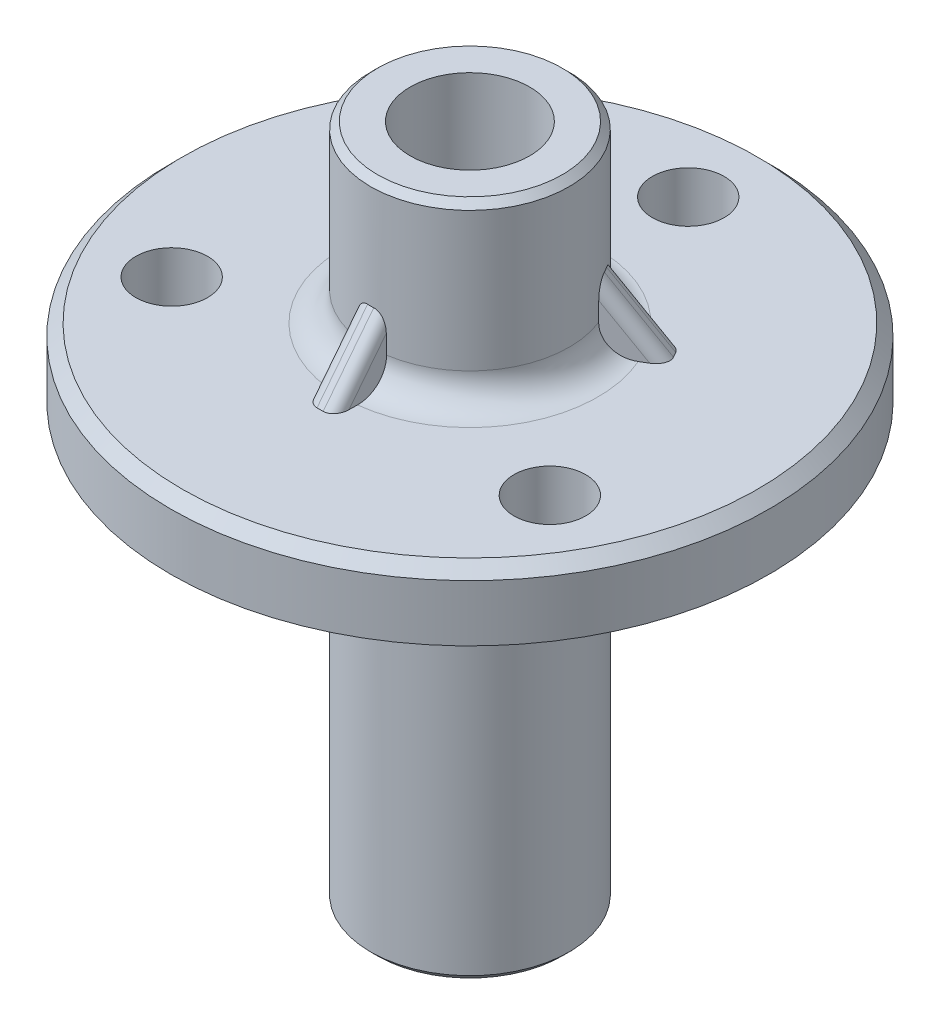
ISO-10303-21;
HEADER;
FILE_DESCRIPTION(('STEP AP214'),'2;1');
FILE_NAME('part.step','',(''),(''),'','','');
FILE_SCHEMA(('AUTOMOTIVE_DESIGN { 1 0 10303 214 1 1 1 1 }'));
ENDSEC;
DATA;
#1=APPLICATION_CONTEXT('core data for automotive mechanical design processes');
#2=APPLICATION_PROTOCOL_DEFINITION('international standard','automotive_design',2000,#1);
#3=PRODUCT_CONTEXT('',#1,'mechanical');
#4=PRODUCT('Part','Part','',(#3));
#5=PRODUCT_RELATED_PRODUCT_CATEGORY('part','',(#4));
#6=PRODUCT_DEFINITION_FORMATION('','',#4);
#7=PRODUCT_DEFINITION_CONTEXT('part definition',#1,'design');
#8=PRODUCT_DEFINITION('design','',#6,#7);
#9=PRODUCT_DEFINITION_SHAPE('','',#8);
#10=(LENGTH_UNIT() NAMED_UNIT(*) SI_UNIT(.MILLI.,.METRE.));
#11=(NAMED_UNIT(*) PLANE_ANGLE_UNIT() SI_UNIT($,.RADIAN.));
#12=(NAMED_UNIT(*) SI_UNIT($,.STERADIAN.) SOLID_ANGLE_UNIT());
#13=UNCERTAINTY_MEASURE_WITH_UNIT(LENGTH_MEASURE(1.E-05),#10,'distance_accuracy_value','');
#14=(GEOMETRIC_REPRESENTATION_CONTEXT(3) GLOBAL_UNCERTAINTY_ASSIGNED_CONTEXT((#13)) GLOBAL_UNIT_ASSIGNED_CONTEXT((#10,
#11,#12)) REPRESENTATION_CONTEXT('',''));
#15=CARTESIAN_POINT('',(0.,0.,0.));
#16=DIRECTION('',(0.,0.,1.));
#17=DIRECTION('',(1.,0.,0.));
#18=AXIS2_PLACEMENT_3D('',#15,#16,#17);
#19=CARTESIAN_POINT('',(0.,-1.5875,0.));
#20=DIRECTION('',(0.,1.,0.));
#21=DIRECTION('',(0.,0.,1.));
#22=AXIS2_PLACEMENT_3D('',#19,#20,#21);
#23=TOROIDAL_SURFACE('',#22,7.0739,1.5875);
#24=CARTESIAN_POINT('',(-7.07025515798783,-1.67905713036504,-4.99855727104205));
#25=CARTESIAN_POINT('',(-7.07248727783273,-1.63462582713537,-4.99984598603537));
#26=CARTESIAN_POINT('',(-7.07309275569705,-1.59010692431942,-5.00019555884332));
#27=CARTESIAN_POINT('',(-7.07105355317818,-1.50117088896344,-4.99901822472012));
#28=CARTESIAN_POINT('',(-7.06840904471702,-1.45675375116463,-4.99749141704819));
#29=CARTESIAN_POINT('',(-7.05561971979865,-1.32421250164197,-4.99010749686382));
#30=CARTESIAN_POINT('',(-7.04062659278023,-1.23664684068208,-4.98145121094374));
#31=CARTESIAN_POINT('',(-6.99812468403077,-1.06567103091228,-4.95691272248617));
#32=CARTESIAN_POINT('',(-6.97061039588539,-0.982262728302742,-4.94102734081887));
#33=CARTESIAN_POINT('',(-6.90386493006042,-0.821956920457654,-4.90249182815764));
#34=CARTESIAN_POINT('',(-6.86463580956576,-0.745058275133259,-4.87984288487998));
#35=CARTESIAN_POINT('',(-6.77552509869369,-0.599829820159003,-4.82839479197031));
#36=CARTESIAN_POINT('',(-6.72562883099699,-0.53151202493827,-4.79958716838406));
#37=CARTESIAN_POINT('',(-6.61663766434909,-0.405463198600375,-4.73666108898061));
#38=CARTESIAN_POINT('',(-6.55754124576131,-0.347733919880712,-4.70254175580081));
#39=CARTESIAN_POINT('',(-6.43160097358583,-0.244277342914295,-4.62983010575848));
#40=CARTESIAN_POINT('',(-6.36472898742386,-0.198595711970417,-4.59122154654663));
#41=CARTESIAN_POINT('',(-6.22532185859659,-0.120773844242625,-4.51073480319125));
#42=CARTESIAN_POINT('',(-6.15278693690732,-0.0886330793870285,-4.4688567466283));
#43=CARTESIAN_POINT('',(-6.00372162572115,-0.0386295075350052,-4.38279384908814));
#44=CARTESIAN_POINT('',(-5.92717306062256,-0.020838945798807,-4.33859851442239));
#45=CARTESIAN_POINT('',(-5.77257584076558,-0.000272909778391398,-4.24934176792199));
#46=CARTESIAN_POINT('',(-5.69452710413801,0.00250174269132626,-4.20428030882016));
#47=CARTESIAN_POINT('',(-5.53875393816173,-0.00704230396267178,-4.11434462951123));
#48=CARTESIAN_POINT('',(-5.46103278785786,-0.019432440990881,-4.06947230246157));
#49=CARTESIAN_POINT('',(-5.30848536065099,-0.0590667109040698,-3.9813990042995));
#50=CARTESIAN_POINT('',(-5.23365909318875,-0.0863108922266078,-3.93819803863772));
#51=CARTESIAN_POINT('',(-5.08885162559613,-0.154971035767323,-3.85459340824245));
#52=CARTESIAN_POINT('',(-5.01888186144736,-0.196419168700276,-3.81419634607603));
#53=CARTESIAN_POINT('',(-4.88597818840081,-0.292323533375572,-3.73746437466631));
#54=CARTESIAN_POINT('',(-4.82304439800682,-0.346779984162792,-3.70112953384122));
#55=CARTESIAN_POINT('',(-4.70618977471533,-0.467032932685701,-3.63366348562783));
#56=CARTESIAN_POINT('',(-4.65224675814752,-0.53280068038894,-3.6025194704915));
#57=CARTESIAN_POINT('',(-4.55477451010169,-0.673935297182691,-3.54624384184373));
#58=CARTESIAN_POINT('',(-4.51124529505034,-0.749302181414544,-3.52111223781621));
#59=CARTESIAN_POINT('',(-4.43620074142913,-0.906891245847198,-3.4777852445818));
#60=CARTESIAN_POINT('',(-4.40459859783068,-0.989058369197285,-3.45953973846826));
#61=CARTESIAN_POINT('',(-4.35393330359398,-1.15837684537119,-3.43028811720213));
#62=CARTESIAN_POINT('',(-4.33486249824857,-1.24552512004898,-3.4192775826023));
#63=CARTESIAN_POINT('',(-4.31426770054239,-1.39087764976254,-3.40738717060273));
#64=CARTESIAN_POINT('',(-4.30892073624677,-1.44839664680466,-3.40430009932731));
#65=CARTESIAN_POINT('',(-4.30373643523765,-1.5636828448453,-3.40130694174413));
#66=CARTESIAN_POINT('',(-4.3038913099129,-1.62144957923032,-3.40139635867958));
#67=CARTESIAN_POINT('',(-4.30681086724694,-1.67905713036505,-3.4030819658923));
#68=B_SPLINE_CURVE_WITH_KNOTS('',3,(#24,#25,#26,#27,#28,#29,#30,#31,#32,#33,#34,#35,#36,#37,#38,
#39,#40,#41,#42,#43,#44,#45,#46,#47,#48,#49,#50,#51,#52,#53,#54,#55,#56,#57,#58,#59,#60,#61,#62,
#63,#64,#65,#66,#67),.UNSPECIFIED.,.F.,.F.,(4,2,2,2,2,2,2,2,2,2,2,2,2,2,2,2,2,2,2,2,2,4),(0.,
0.133435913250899,0.266864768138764,0.533272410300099,0.799797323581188,1.0662754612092,
1.33312264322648,1.60001394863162,1.86790283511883,2.13578127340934,2.40500005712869,
2.67423357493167,2.9447402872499,3.21524788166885,3.48637224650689,3.75750117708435,
4.02795089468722,4.29840103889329,4.56684304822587,4.83512092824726,5.00834359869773,
5.18132105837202),.UNSPECIFIED.);
#69=CARTESIAN_POINT('',(-5.69061353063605,0.,-4.20202080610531));
#70=VERTEX_POINT('',#69);
#71=CARTESIAN_POINT('',(-4.30449814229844,-1.5875,-3.40174671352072));
#72=VERTEX_POINT('',#71);
#73=EDGE_CURVE('E274',#70,#72,#68,.T.);
#74=ORIENTED_EDGE('',*,*,#73,.F.);
#75=CARTESIAN_POINT('',(0.,0.,0.));
#76=DIRECTION('',(0.,1.,0.));
#77=DIRECTION('',(0.,0.,1.));
#78=AXIS2_PLACEMENT_3D('',#75,#76,#77);
#79=CIRCLE('',#78,7.0739);
#80=CARTESIAN_POINT('',(5.69061353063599,0.,-4.20202080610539));
#81=VERTEX_POINT('',#80);
#82=EDGE_CURVE('E498',#81,#70,#79,.T.);
#83=ORIENTED_EDGE('',*,*,#82,.F.);
#84=CARTESIAN_POINT('',(7.07025515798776,-1.67905713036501,-4.99855727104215));
#85=CARTESIAN_POINT('',(7.07248727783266,-1.63462582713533,-4.99984598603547));
#86=CARTESIAN_POINT('',(7.07309275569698,-1.59010692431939,-5.00019555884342));
#87=CARTESIAN_POINT('',(7.07105355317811,-1.50117088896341,-4.99901822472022));
#88=CARTESIAN_POINT('',(7.06840904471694,-1.4567537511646,-4.99749141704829));
#89=CARTESIAN_POINT('',(7.05561971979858,-1.32421250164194,-4.99010749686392));
#90=CARTESIAN_POINT('',(7.04062659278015,-1.23664684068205,-4.98145121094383));
#91=CARTESIAN_POINT('',(6.9981246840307,-1.06567103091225,-4.95691272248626));
#92=CARTESIAN_POINT('',(6.97061039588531,-0.982262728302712,-4.94102734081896));
#93=CARTESIAN_POINT('',(6.90386493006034,-0.821956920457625,-4.90249182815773));
#94=CARTESIAN_POINT('',(6.86463580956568,-0.74505827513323,-4.87984288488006));
#95=CARTESIAN_POINT('',(6.77552509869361,-0.599829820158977,-4.8283947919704));
#96=CARTESIAN_POINT('',(6.7256288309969,-0.531512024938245,-4.79958716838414));
#97=CARTESIAN_POINT('',(6.616637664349,-0.405463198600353,-4.73666108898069));
#98=CARTESIAN_POINT('',(6.55754124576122,-0.347733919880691,-4.70254175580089));
#99=CARTESIAN_POINT('',(6.43160097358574,-0.244277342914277,-4.62983010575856));
#100=CARTESIAN_POINT('',(6.36472898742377,-0.198595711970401,-4.5912215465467));
#101=CARTESIAN_POINT('',(6.2253218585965,-0.120773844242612,-4.51073480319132));
#102=CARTESIAN_POINT('',(6.15278693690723,-0.0886330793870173,-4.46885674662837));
#103=CARTESIAN_POINT('',(6.00372162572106,-0.0386295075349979,-4.3827938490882));
#104=CARTESIAN_POINT('',(5.92717306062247,-0.0208389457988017,-4.33859851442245));
#105=CARTESIAN_POINT('',(5.77257584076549,-0.000272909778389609,-4.24934176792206));
#106=CARTESIAN_POINT('',(5.69452710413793,0.00250174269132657,-4.20428030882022));
#107=CARTESIAN_POINT('',(5.53875393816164,-0.0070423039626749,-4.11434462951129));
#108=CARTESIAN_POINT('',(5.46103278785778,-0.0194324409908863,-4.06947230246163));
#109=CARTESIAN_POINT('',(5.3084853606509,-0.0590667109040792,-3.98139900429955));
#110=CARTESIAN_POINT('',(5.23365909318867,-0.0863108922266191,-3.93819803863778));
#111=CARTESIAN_POINT('',(5.08885162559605,-0.154971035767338,-3.85459340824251));
#112=CARTESIAN_POINT('',(5.01888186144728,-0.196419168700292,-3.81419634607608));
#113=CARTESIAN_POINT('',(4.88597818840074,-0.292323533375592,-3.73746437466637));
#114=CARTESIAN_POINT('',(4.82304439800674,-0.346779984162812,-3.70112953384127));
#115=CARTESIAN_POINT('',(4.70618977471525,-0.467032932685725,-3.63366348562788));
#116=CARTESIAN_POINT('',(4.65224675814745,-0.532800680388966,-3.60251947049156));
#117=CARTESIAN_POINT('',(4.55477451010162,-0.67393529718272,-3.54624384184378));
#118=CARTESIAN_POINT('',(4.51124529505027,-0.749302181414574,-3.52111223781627));
#119=CARTESIAN_POINT('',(4.43620074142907,-0.90689124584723,-3.47778524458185));
#120=CARTESIAN_POINT('',(4.40459859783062,-0.989058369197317,-3.45953973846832));
#121=CARTESIAN_POINT('',(4.35393330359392,-1.15837684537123,-3.43028811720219));
#122=CARTESIAN_POINT('',(4.33486249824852,-1.24552512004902,-3.41927758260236));
#123=CARTESIAN_POINT('',(4.31426770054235,-1.39087764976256,-3.40738717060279));
#124=CARTESIAN_POINT('',(4.30892073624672,-1.44839664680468,-3.40430009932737));
#125=CARTESIAN_POINT('',(4.3037364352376,-1.56368284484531,-3.40130694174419));
#126=CARTESIAN_POINT('',(4.30389130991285,-1.62144957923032,-3.40139635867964));
#127=CARTESIAN_POINT('',(4.3068108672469,-1.67905713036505,-3.40308196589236));
#128=B_SPLINE_CURVE_WITH_KNOTS('',3,(#84,#85,#86,#87,#88,#89,#90,#91,#92,#93,#94,#95,#96,#97,
#98,#99,#100,#101,#102,#103,#104,#105,#106,#107,#108,#109,#110,#111,#112,#113,#114,#115,#116,
#117,#118,#119,#120,#121,#122,#123,#124,#125,#126,#127),.UNSPECIFIED.,.F.,.F.,(4,2,2,2,2,2,2,2,
2,2,2,2,2,2,2,2,2,2,2,2,2,4),(0.,0.133435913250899,0.266864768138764,0.5332724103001,
0.799797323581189,1.0662754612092,1.33312264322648,1.60001394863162,1.86790283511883,
2.13578127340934,2.4050000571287,2.67423357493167,2.94474028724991,3.21524788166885,
3.48637224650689,3.75750117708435,4.02795089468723,4.29840103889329,4.56684304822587,
4.83512092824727,5.00834359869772,5.18132105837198),.UNSPECIFIED.);
#129=CARTESIAN_POINT('',(4.30449814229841,-1.5875,-3.40174671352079));
#130=VERTEX_POINT('',#129);
#131=EDGE_CURVE('E281',#81,#130,#128,.T.);
#132=ORIENTED_EDGE('',*,*,#131,.T.);
#133=CARTESIAN_POINT('',(0.,-1.5875,0.));
#134=DIRECTION('',(0.,1.,0.));
#135=DIRECTION('',(0.,0.,1.));
#136=AXIS2_PLACEMENT_3D('',#133,#134,#135);
#137=CIRCLE('',#136,5.4864);
#138=EDGE_CURVE('E270',#72,#130,#137,.F.);
#139=ORIENTED_EDGE('',*,*,#138,.F.);
#140=EDGE_LOOP('',(#74,#83,#132,#139));
#141=FACE_BOUND('',#140,.T.);
#142=ADVANCED_FACE('F35',(#141),#23,.F.);
#143=CARTESIAN_POINT('',(0.79375,-1.04183028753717,5.52641660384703));
#144=CARTESIAN_POINT('',(0.79375,-1.12469282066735,5.49577923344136));
#145=CARTESIAN_POINT('',(0.79375,-1.21019204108,5.47209485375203));
#146=CARTESIAN_POINT('',(0.79375,-1.38402093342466,5.43940036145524));
#147=CARTESIAN_POINT('',(0.79375,-1.47235364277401,5.4304065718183));
#148=CARTESIAN_POINT('',(0.79375,-1.64924746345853,5.42740347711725));
#149=CARTESIAN_POINT('',(0.79375,-1.73780847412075,5.43338842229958));
#150=CARTESIAN_POINT('',(0.79375,-1.91264303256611,5.46014810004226));
#151=CARTESIAN_POINT('',(0.79375,-1.9989170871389,5.48091952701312));
#152=CARTESIAN_POINT('',(0.79375,-2.16675280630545,5.53660999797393));
#153=CARTESIAN_POINT('',(0.79375,-2.24831523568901,5.57152673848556));
#154=CARTESIAN_POINT('',(0.79375,-2.40448000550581,5.65446743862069));
#155=CARTESIAN_POINT('',(0.79375,-2.47908187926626,5.70249227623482));
#156=CARTESIAN_POINT('',(0.79375,-2.61976860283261,5.81062356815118));
#157=CARTESIAN_POINT('',(0.79375,-2.68579103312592,5.87081121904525));
#158=CARTESIAN_POINT('',(0.79375,-2.80691018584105,6.00132479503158));
#159=CARTESIAN_POINT('',(0.79375,-2.86200638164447,6.07165120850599));
#160=CARTESIAN_POINT('',(0.79375,-2.96024041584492,6.22115256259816));
#161=CARTESIAN_POINT('',(0.79375,-3.00326241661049,6.30040363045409));
#162=CARTESIAN_POINT('',(0.79375,-3.07548230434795,6.46497274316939));
#163=CARTESIAN_POINT('',(0.79375,-3.1046797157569,6.55029099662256));
#164=CARTESIAN_POINT('',(0.79375,-3.1485731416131,6.7251201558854));
#165=CARTESIAN_POINT('',(0.79375,-3.16318212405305,6.81465292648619));
#166=CARTESIAN_POINT('',(0.79375,-3.1771722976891,6.99490155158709));
#167=CARTESIAN_POINT('',(0.79375,-3.17655333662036,7.08561741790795));
#168=CARTESIAN_POINT('',(0.79375,-3.16007723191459,7.26570944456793));
#169=CARTESIAN_POINT('',(0.79375,-3.14421128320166,7.35508480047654));
#170=CARTESIAN_POINT('',(0.79375,-3.09764742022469,7.52988564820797));
#171=CARTESIAN_POINT('',(0.79375,-3.06694972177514,7.61531119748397));
#172=CARTESIAN_POINT('',(0.79375,-2.99169585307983,7.77946753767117));
#173=CARTESIAN_POINT('',(0.79375,-2.94718777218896,7.8582203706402));
#174=CARTESIAN_POINT('',(0.79375,-2.84551786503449,8.00708491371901));
#175=CARTESIAN_POINT('',(0.79375,-2.78835636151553,8.07719684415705));
#176=CARTESIAN_POINT('',(0.79375,-2.66331224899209,8.20641111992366));
#177=CARTESIAN_POINT('',(0.79375,-2.59548533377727,8.26556736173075));
#178=CARTESIAN_POINT('',(0.79375,-2.45082291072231,8.37158854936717));
#179=CARTESIAN_POINT('',(0.79375,-2.37398763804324,8.41845381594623));
#180=CARTESIAN_POINT('',(0.79375,-2.2138779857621,8.49833686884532));
#181=CARTESIAN_POINT('',(0.79375,-2.1306354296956,8.5314184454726));
#182=CARTESIAN_POINT('',(0.79375,-1.95976754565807,8.5830876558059));
#183=CARTESIAN_POINT('',(0.79375,-1.87214230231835,8.60167556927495));
#184=CARTESIAN_POINT('',(0.79375,-1.69528749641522,8.62378154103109));
#185=CARTESIAN_POINT('',(0.79375,-1.60606373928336,8.62734606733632));
#186=CARTESIAN_POINT('',(0.79375,-1.42828676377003,8.61942952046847));
#187=CARTESIAN_POINT('',(0.79375,-1.33973353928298,8.60794858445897));
#188=CARTESIAN_POINT('',(0.79375,-1.16589648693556,8.57029221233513));
#189=CARTESIAN_POINT('',(0.79375,-1.08060967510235,8.54413054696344));
#190=CARTESIAN_POINT('',(0.79375,-0.915630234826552,8.47787890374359));
#191=CARTESIAN_POINT('',(0.79375,-0.835937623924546,8.43778888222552));
#192=CARTESIAN_POINT('',(0.79375,-0.684285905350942,8.34477095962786));
#193=CARTESIAN_POINT('',(0.79375,-0.612337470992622,8.29182565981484));
#194=CARTESIAN_POINT('',(0.79375,-0.478312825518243,8.17464547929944));
#195=CARTESIAN_POINT('',(0.79375,-0.416236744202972,8.11041045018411));
#196=CARTESIAN_POINT('',(0.79375,-0.303484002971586,7.97224421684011));
#197=CARTESIAN_POINT('',(0.79375,-0.252847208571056,7.89828048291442));
#198=CARTESIAN_POINT('',(0.79375,-0.164640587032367,7.74293434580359));
#199=CARTESIAN_POINT('',(0.79375,-0.127071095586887,7.6615517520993));
#200=CARTESIAN_POINT('',(0.79375,-0.0658697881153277,7.49325857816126));
#201=CARTESIAN_POINT('',(0.79375,-0.0423062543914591,7.40632316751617));
#202=CARTESIAN_POINT('',(0.79375,-0.0100297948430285,7.22973801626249));
#203=CARTESIAN_POINT('',(0.79375,-0.00131732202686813,7.14008819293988));
#204=CARTESIAN_POINT('',(0.79375,0.00104588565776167,6.96014541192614));
#205=CARTESIAN_POINT('',(0.79375,-0.00537820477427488,6.86985146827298));
#206=CARTESIAN_POINT('',(0.79375,-0.0332462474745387,6.6916144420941));
#207=CARTESIAN_POINT('',(0.79375,-0.0546899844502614,6.60367132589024));
#208=CARTESIAN_POINT('',(0.79375,-0.112075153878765,6.43236867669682));
#209=CARTESIAN_POINT('',(0.79375,-0.14805781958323,6.34902295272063));
#210=CARTESIAN_POINT('',(0.79375,-0.233534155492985,6.18954269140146));
#211=CARTESIAN_POINT('',(0.79375,-0.28303121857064,6.11340997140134));
#212=CARTESIAN_POINT('',(0.79375,-0.394095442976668,5.97064834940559));
#213=CARTESIAN_POINT('',(0.79375,-0.455651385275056,5.90401071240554));
#214=CARTESIAN_POINT('',(0.79375,-0.589101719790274,5.78216757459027));
#215=CARTESIAN_POINT('',(0.79375,-0.660983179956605,5.72694798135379));
#216=CARTESIAN_POINT('',(0.79375,-0.784872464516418,5.64756575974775));
#217=CARTESIAN_POINT('',(0.79375,-0.834405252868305,5.61946800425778));
#218=CARTESIAN_POINT('',(0.79375,-0.936204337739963,5.56875796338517));
#219=CARTESIAN_POINT('',(0.79375,-0.988470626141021,5.54614566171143));
#220=CARTESIAN_POINT('',(0.79375,-1.04183028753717,5.52641660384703));
#221=B_SPLINE_CURVE_WITH_KNOTS('',3,(#143,#144,#145,#146,#147,#148,#149,#150,#151,#152,#153,
#154,#155,#156,#157,#158,#159,#160,#161,#162,#163,#164,#165,#166,#167,#168,#169,#170,#171,#172,
#173,#174,#175,#176,#177,#178,#179,#180,#181,#182,#183,#184,#185,#186,#187,#188,#189,#190,#191,
#192,#193,#194,#195,#196,#197,#198,#199,#200,#201,#202,#203,#204,#205,#206,#207,#208,#209,#210,
#211,#212,#213,#214,#215,#216,#217,#218,#219,#220),.UNSPECIFIED.,.T.,.F.,(4,2,2,2,2,2,2,2,2,2,2,
2,2,2,2,2,2,2,2,2,2,2,2,2,2,2,2,2,2,2,2,2,2,2,2,2,2,2,4),(0.,0.26482851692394,0.529951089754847,
0.794971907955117,1.05993349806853,1.32485195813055,1.58978816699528,1.85655521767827,
2.12333512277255,2.39259319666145,2.66186053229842,2.93272484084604,3.20359185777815,
3.47461539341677,3.74563498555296,4.01572125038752,4.28580062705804,4.55451384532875,
4.82322005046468,5.09066849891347,5.35811178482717,5.62472724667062,5.8913402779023,
6.15770363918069,6.42406783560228,6.69079456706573,6.95752480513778,7.22517072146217,
7.49282351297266,7.76177069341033,8.0307260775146,8.30101378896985,8.57129762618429,
8.84235344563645,9.11347737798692,9.38435025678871,9.65488679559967,9.82542469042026,
9.99596207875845),.UNSPECIFIED.);
#222=CARTESIAN_POINT('',(0.79375,0.,7.02922628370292));
#223=VERTEX_POINT('',#222);
#224=CARTESIAN_POINT('',(0.79375,-1.5875,5.42867809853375));
#225=VERTEX_POINT('',#224);
#226=EDGE_CURVE('E395',#223,#225,#221,.T.);
#227=ORIENTED_EDGE('',*,*,#226,.T.);
#228=CARTESIAN_POINT('',(5.0982481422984,-1.5875,-2.02693138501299));
#229=VERTEX_POINT('',#228);
#230=EDGE_CURVE('E283',#229,#225,#137,.F.);
#231=ORIENTED_EDGE('',*,*,#230,.F.);
#232=CARTESIAN_POINT('',(7.0741,-0.15161486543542,-3.16768998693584));
#233=CARTESIAN_POINT('',(7.03870986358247,-0.13244792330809,-3.14725748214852));
#234=CARTESIAN_POINT('',(7.00263371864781,-0.11502167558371,-3.12642891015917));
#235=CARTESIAN_POINT('',(6.92933920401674,-0.0837476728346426,-3.0841123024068));
#236=CARTESIAN_POINT('',(6.89212091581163,-0.0698996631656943,-3.0626243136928));
#237=CARTESIAN_POINT('',(6.77921696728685,-0.0339054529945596,-2.99743918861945));
#238=CARTESIAN_POINT('',(6.70216119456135,-0.0172437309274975,-2.95295101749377));
#239=CARTESIAN_POINT('',(6.54673500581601,0.000922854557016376,-2.86321566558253));
#240=CARTESIAN_POINT('',(6.4683641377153,0.00242239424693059,-2.81796822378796));
#241=CARTESIAN_POINT('',(6.3125144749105,-0.00974545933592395,-2.72798837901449));
#242=CARTESIAN_POINT('',(6.23503553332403,-0.0234103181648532,-2.68325589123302));
#243=CARTESIAN_POINT('',(6.08295089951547,-0.0655708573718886,-2.59544978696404));
#244=CARTESIAN_POINT('',(6.00835333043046,-0.0941055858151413,-2.55238086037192));
#245=CARTESIAN_POINT('',(5.8643465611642,-0.165237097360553,-2.46923851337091));
#246=CARTESIAN_POINT('',(5.79493853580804,-0.207837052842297,-2.42916577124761));
#247=CARTESIAN_POINT('',(5.66332111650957,-0.305912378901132,-2.35317641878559));
#248=CARTESIAN_POINT('',(5.60111136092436,-0.361387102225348,-2.31725959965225));
#249=CARTESIAN_POINT('',(5.48571000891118,-0.483658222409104,-2.2506325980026));
#250=CARTESIAN_POINT('',(5.43251590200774,-0.550451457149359,-2.21992096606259));
#251=CARTESIAN_POINT('',(5.33697220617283,-0.693082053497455,-2.16475878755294));
#252=CARTESIAN_POINT('',(5.29456445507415,-0.768867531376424,-2.14027466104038));
#253=CARTESIAN_POINT('',(5.22146832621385,-0.927714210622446,-2.09807259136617));
#254=CARTESIAN_POINT('',(5.19078323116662,-1.01077744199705,-2.08035654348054));
#255=CARTESIAN_POINT('',(5.15313815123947,-1.1429370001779,-2.05862214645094));
#256=CARTESIAN_POINT('',(5.14172466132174,-1.190404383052,-2.05203256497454));
#257=CARTESIAN_POINT('',(5.12279237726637,-1.28638306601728,-2.0411020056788));
#258=CARTESIAN_POINT('',(5.1152740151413,-1.33489448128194,-2.03676127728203));
#259=CARTESIAN_POINT('',(5.10420311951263,-1.43261860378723,-2.03036949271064));
#260=CARTESIAN_POINT('',(5.10065903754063,-1.4818325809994,-2.02832331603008));
#261=CARTESIAN_POINT('',(5.09758966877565,-1.58042791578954,-2.02655121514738));
#262=CARTESIAN_POINT('',(5.09806444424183,-1.62980927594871,-2.02682532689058));
#263=CARTESIAN_POINT('',(5.1005608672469,-1.67905713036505,-2.02826663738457));
#264=B_SPLINE_CURVE_WITH_KNOTS('',3,(#232,#233,#234,#235,#236,#237,#238,#239,#240,#241,#242,
#243,#244,#245,#246,#247,#248,#249,#250,#251,#252,#253,#254,#255,#256,#257,#258,#259,#260,#261,
#262,#263),.UNSPECIFIED.,.F.,.F.,(4,2,2,2,2,2,2,2,2,2,2,2,2,2,2,4),(0.,0.135326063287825,
0.270642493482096,0.540818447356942,0.811089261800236,1.08131491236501,1.35225377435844,
1.62325378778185,1.89424018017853,2.16515098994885,2.43456845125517,2.70406130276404,
2.8516658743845,2.99928681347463,3.14722108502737,3.29515764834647),.UNSPECIFIED.);
#265=CARTESIAN_POINT('',(6.484363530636,0.,-2.82720547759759));
#266=VERTEX_POINT('',#265);
#267=EDGE_CURVE('E714',#266,#229,#264,.T.);
#268=ORIENTED_EDGE('',*,*,#267,.F.);
#269=EDGE_CURVE('E494',#223,#266,#79,.T.);
#270=ORIENTED_EDGE('',*,*,#269,.F.);
#271=EDGE_LOOP('',(#227,#231,#268,#270));
#272=FACE_BOUND('',#271,.T.);
#273=ADVANCED_FACE('F673',(#272),#23,.F.);
#274=CARTESIAN_POINT('',(0.,5.3467,0.));
#275=DIRECTION('',(0.,1.,0.));
#276=DIRECTION('',(0.,0.,1.));
#277=AXIS2_PLACEMENT_3D('',#274,#275,#276);
#278=TOROIDAL_SURFACE('',#277,7.0739,1.5875);
#279=CARTESIAN_POINT('',(-4.2934799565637,5.43630006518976,-3.41970594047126));
#280=CARTESIAN_POINT('',(-4.29097541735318,5.39221453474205,-3.41885007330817));
#281=CARTESIAN_POINT('',(-4.2900989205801,5.34803988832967,-3.41890569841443));
#282=CARTESIAN_POINT('',(-4.29160151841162,5.2597886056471,-3.42083624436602));
#283=CARTESIAN_POINT('',(-4.29398041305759,5.21571196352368,-3.42271105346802));
#284=CARTESIAN_POINT('',(-4.30598382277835,5.08420456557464,-3.43104799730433));
#285=CARTESIAN_POINT('',(-4.32046542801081,4.99732412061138,-3.44021938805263));
#286=CARTESIAN_POINT('',(-4.36196482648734,4.82768134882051,-3.46552145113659));
#287=CARTESIAN_POINT('',(-4.38898758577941,4.74492066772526,-3.4816548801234));
#288=CARTESIAN_POINT('',(-4.45474773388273,4.58582049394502,-3.52039315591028));
#289=CARTESIAN_POINT('',(-4.49348384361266,4.50948030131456,-3.54299729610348));
#290=CARTESIAN_POINT('',(-4.58172760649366,4.36498167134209,-3.59412787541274));
#291=CARTESIAN_POINT('',(-4.63128423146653,4.29686269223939,-3.62268121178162));
#292=CARTESIAN_POINT('',(-4.73962988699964,4.17104414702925,-3.6848218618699));
#293=CARTESIAN_POINT('',(-4.79842076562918,4.1133466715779,-3.71841018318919));
#294=CARTESIAN_POINT('',(-4.92428516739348,4.00932232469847,-3.79007795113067));
#295=CARTESIAN_POINT('',(-4.99144602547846,3.96313358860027,-3.82820452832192));
#296=CARTESIAN_POINT('',(-5.1315988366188,3.88423950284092,-3.90755181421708));
#297=CARTESIAN_POINT('',(-5.20459072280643,3.85153399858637,-3.94877248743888));
#298=CARTESIAN_POINT('',(-5.3550706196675,3.8002433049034,-4.03355358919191));
#299=CARTESIAN_POINT('',(-5.43259412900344,3.78179225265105,-4.07713221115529));
#300=CARTESIAN_POINT('',(-5.5893240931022,3.76003015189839,-4.16504350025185));
#301=CARTESIAN_POINT('',(-5.66853062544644,3.75671980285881,-4.20937620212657));
#302=CARTESIAN_POINT('',(-5.8266292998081,3.7653616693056,-4.29767723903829));
#303=CARTESIAN_POINT('',(-5.90551977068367,3.77735999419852,-4.34164406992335));
#304=CARTESIAN_POINT('',(-6.06049336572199,3.81638919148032,-4.42782216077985));
#305=CARTESIAN_POINT('',(-6.13657649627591,3.84342002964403,-4.47003342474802));
#306=CARTESIAN_POINT('',(-6.28355186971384,3.91169092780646,-4.55137769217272));
#307=CARTESIAN_POINT('',(-6.35445731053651,3.9528932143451,-4.59051854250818));
#308=CARTESIAN_POINT('',(-6.48924125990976,4.04838120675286,-4.66470918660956));
#309=CARTESIAN_POINT('',(-6.55312063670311,4.10266529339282,-4.69975948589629));
#310=CARTESIAN_POINT('',(-6.67163865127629,4.22243304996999,-4.76455435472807));
#311=CARTESIAN_POINT('',(-6.72633015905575,4.28784795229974,-4.79432933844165));
#312=CARTESIAN_POINT('',(-6.82536232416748,4.42829746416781,-4.84797232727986));
#313=CARTESIAN_POINT('',(-6.86969798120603,4.50333669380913,-4.87183747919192));
#314=CARTESIAN_POINT('',(-6.94646820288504,4.66042522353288,-4.91282615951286));
#315=CARTESIAN_POINT('',(-6.97896487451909,4.74243507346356,-4.9299849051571));
#316=CARTESIAN_POINT('',(-7.03137247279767,4.91135067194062,-4.95720403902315));
#317=CARTESIAN_POINT('',(-7.05131202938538,4.99824478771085,-4.96728058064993));
#318=CARTESIAN_POINT('',(-7.06831789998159,5.1099440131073,-4.9754101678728));
#319=CARTESIAN_POINT('',(-7.07144782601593,5.13368467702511,-4.97686709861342));
#320=CARTESIAN_POINT('',(-7.0741,5.15748129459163,-4.97805618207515));
#321=B_SPLINE_CURVE_WITH_KNOTS('',3,(#279,#280,#281,#282,#283,#284,#285,#286,#287,#288,#289,
#290,#291,#292,#293,#294,#295,#296,#297,#298,#299,#300,#301,#302,#303,#304,#305,#306,#307,#308,
#309,#310,#311,#312,#313,#314,#315,#316,#317,#318,#319,#320),.UNSPECIFIED.,.F.,.F.,(4,2,2,2,2,2,
2,2,2,2,2,2,2,2,2,2,2,2,2,2,4),(0.,0.132413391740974,0.264818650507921,0.529118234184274,
0.793522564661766,1.05789803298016,1.32349578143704,1.58914675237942,1.85784732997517,
2.12654482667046,2.39774101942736,2.66894974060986,2.94097726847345,3.21300417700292,
3.4843115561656,3.75558537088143,4.02524033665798,4.29502523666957,4.56337374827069,
4.8311081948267,4.90305177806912),.UNSPECIFIED.);
#322=CARTESIAN_POINT('',(-4.29063153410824,5.3467,-3.41922008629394));
#323=VERTEX_POINT('',#322);
#324=CARTESIAN_POINT('',(-5.68031326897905,3.7592,-4.21593434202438));
#325=VERTEX_POINT('',#324);
#326=EDGE_CURVE('E332',#323,#325,#321,.T.);
#327=ORIENTED_EDGE('',*,*,#326,.F.);
#328=CARTESIAN_POINT('',(0.,5.3467,0.));
#329=DIRECTION('',(0.,1.,0.));
#330=DIRECTION('',(0.,0.,1.));
#331=AXIS2_PLACEMENT_3D('',#328,#329,#330);
#332=CIRCLE('',#331,5.4864);
#333=CARTESIAN_POINT('',(4.29063153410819,5.3467,-3.419220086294));
#334=VERTEX_POINT('',#333);
#335=EDGE_CURVE('E506',#334,#323,#332,.T.);
#336=ORIENTED_EDGE('',*,*,#335,.F.);
#337=CARTESIAN_POINT('',(4.29347995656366,5.43630006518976,-3.41970594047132));
#338=CARTESIAN_POINT('',(4.29097541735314,5.39221453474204,-3.41885007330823));
#339=CARTESIAN_POINT('',(4.29009892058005,5.34803988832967,-3.41890569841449));
#340=CARTESIAN_POINT('',(4.29160151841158,5.2597886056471,-3.42083624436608));
#341=CARTESIAN_POINT('',(4.29398041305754,5.21571196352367,-3.42271105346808));
#342=CARTESIAN_POINT('',(4.3059838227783,5.08420456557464,-3.43104799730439));
#343=CARTESIAN_POINT('',(4.32046542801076,4.99732412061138,-3.44021938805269));
#344=CARTESIAN_POINT('',(4.3619648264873,4.82768134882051,-3.46552145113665));
#345=CARTESIAN_POINT('',(4.38898758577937,4.74492066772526,-3.48165488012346));
#346=CARTESIAN_POINT('',(4.45474773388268,4.58582049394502,-3.52039315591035));
#347=CARTESIAN_POINT('',(4.49348384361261,4.50948030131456,-3.54299729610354));
#348=CARTESIAN_POINT('',(4.58172760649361,4.36498167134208,-3.59412787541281));
#349=CARTESIAN_POINT('',(4.63128423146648,4.29686269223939,-3.62268121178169));
#350=CARTESIAN_POINT('',(4.73962988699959,4.17104414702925,-3.68482186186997));
#351=CARTESIAN_POINT('',(4.79842076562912,4.1133466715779,-3.71841018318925));
#352=CARTESIAN_POINT('',(4.92428516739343,4.00932232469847,-3.79007795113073));
#353=CARTESIAN_POINT('',(4.99144602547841,3.96313358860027,-3.82820452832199));
#354=CARTESIAN_POINT('',(5.13159883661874,3.88423950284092,-3.90755181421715));
#355=CARTESIAN_POINT('',(5.20459072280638,3.85153399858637,-3.94877248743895));
#356=CARTESIAN_POINT('',(5.35507061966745,3.8002433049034,-4.03355358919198));
#357=CARTESIAN_POINT('',(5.43259412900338,3.78179225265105,-4.07713221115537));
#358=CARTESIAN_POINT('',(5.58932409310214,3.76003015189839,-4.16504350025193));
#359=CARTESIAN_POINT('',(5.66853062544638,3.75671980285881,-4.20937620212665));
#360=CARTESIAN_POINT('',(5.82662929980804,3.7653616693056,-4.29767723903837));
#361=CARTESIAN_POINT('',(5.90551977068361,3.77735999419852,-4.34164406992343));
#362=CARTESIAN_POINT('',(6.06049336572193,3.81638919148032,-4.42782216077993));
#363=CARTESIAN_POINT('',(6.13657649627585,3.84342002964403,-4.47003342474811));
#364=CARTESIAN_POINT('',(6.28355186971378,3.91169092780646,-4.5513776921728));
#365=CARTESIAN_POINT('',(6.35445731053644,3.9528932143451,-4.59051854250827));
#366=CARTESIAN_POINT('',(6.4892412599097,4.04838120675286,-4.66470918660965));
#367=CARTESIAN_POINT('',(6.55312063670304,4.10266529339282,-4.69975948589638));
#368=CARTESIAN_POINT('',(6.67163865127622,4.22243304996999,-4.76455435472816));
#369=CARTESIAN_POINT('',(6.72633015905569,4.28784795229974,-4.79432933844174));
#370=CARTESIAN_POINT('',(6.82536232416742,4.42829746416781,-4.84797232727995));
#371=CARTESIAN_POINT('',(6.86969798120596,4.50333669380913,-4.87183747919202));
#372=CARTESIAN_POINT('',(6.94646820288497,4.66042522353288,-4.91282615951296));
#373=CARTESIAN_POINT('',(6.97896487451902,4.74243507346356,-4.92998490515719));
#374=CARTESIAN_POINT('',(7.0313724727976,4.91135067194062,-4.95720403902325));
#375=CARTESIAN_POINT('',(7.05131202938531,4.99824478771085,-4.96728058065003));
#376=CARTESIAN_POINT('',(7.06831789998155,5.10994401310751,-4.97541016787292));
#377=CARTESIAN_POINT('',(7.07144782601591,5.13368467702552,-4.97686709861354));
#378=CARTESIAN_POINT('',(7.0741,5.15748129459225,-4.97805618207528));
#379=B_SPLINE_CURVE_WITH_KNOTS('',3,(#337,#338,#339,#340,#341,#342,#343,#344,#345,#346,#347,
#348,#349,#350,#351,#352,#353,#354,#355,#356,#357,#358,#359,#360,#361,#362,#363,#364,#365,#366,
#367,#368,#369,#370,#371,#372,#373,#374,#375,#376,#377,#378),.UNSPECIFIED.,.F.,.F.,(4,2,2,2,2,2,
2,2,2,2,2,2,2,2,2,2,2,2,2,2,4),(0.,0.132413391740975,0.264818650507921,0.529118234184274,
0.793522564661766,1.05789803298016,1.32349578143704,1.58914675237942,1.85784732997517,
2.12654482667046,2.39774101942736,2.66894974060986,2.94097726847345,3.21300417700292,
3.4843115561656,3.75558537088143,4.02524033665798,4.29502523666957,4.56337374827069,
4.8311081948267,4.90305177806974),.UNSPECIFIED.);
#380=CARTESIAN_POINT('',(5.68031326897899,3.7592,-4.21593434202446));
#381=VERTEX_POINT('',#380);
#382=EDGE_CURVE('E374',#334,#381,#379,.T.);
#383=ORIENTED_EDGE('',*,*,#382,.T.);
#384=CARTESIAN_POINT('',(0.,3.7592,0.));
#385=DIRECTION('',(0.,1.,0.));
#386=DIRECTION('',(0.,0.,1.));
#387=AXIS2_PLACEMENT_3D('',#384,#385,#386);
#388=CIRCLE('',#387,7.0739);
#389=EDGE_CURVE('E502',#325,#381,#388,.F.);
#390=ORIENTED_EDGE('',*,*,#389,.F.);
#391=EDGE_LOOP('',(#327,#336,#383,#390));
#392=FACE_BOUND('',#391,.T.);
#393=ADVANCED_FACE('F677',(#392),#278,.F.);
#394=CARTESIAN_POINT('',(0.815813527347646,5.3469,5.42540628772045));
#395=CARTESIAN_POINT('',(0.816291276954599,5.30269749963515,5.42532871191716));
#396=CARTESIAN_POINT('',(0.816743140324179,5.25851263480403,5.42712331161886));
#397=CARTESIAN_POINT('',(0.817592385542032,5.17045488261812,5.4344368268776));
#398=CARTESIAN_POINT('',(0.817989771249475,5.12658197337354,5.43995547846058));
#399=CARTESIAN_POINT('',(0.819094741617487,4.99601443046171,5.46203779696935));
#400=CARTESIAN_POINT('',(0.819717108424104,4.91018856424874,5.48412770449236));
#401=CARTESIAN_POINT('',(0.820715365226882,4.74347293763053,5.54238707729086));
#402=CARTESIAN_POINT('',(0.821091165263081,4.66258498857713,5.57856167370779));
#403=CARTESIAN_POINT('',(0.821587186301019,4.50797617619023,5.66390068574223));
#404=CARTESIAN_POINT('',(0.821707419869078,4.4342549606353,5.71306446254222));
#405=CARTESIAN_POINT('',(0.821690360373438,4.29560585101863,5.82324597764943));
#406=CARTESIAN_POINT('',(0.821551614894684,4.23072975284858,5.88432883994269));
#407=CARTESIAN_POINT('',(0.821019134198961,4.1119975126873,6.01641419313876));
#408=CARTESIAN_POINT('',(0.820625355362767,4.05814325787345,6.08741837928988));
#409=CARTESIAN_POINT('',(0.819588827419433,3.96233532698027,6.23821589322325));
#410=CARTESIAN_POINT('',(0.818943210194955,3.92052875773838,6.3181026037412));
#411=CARTESIAN_POINT('',(0.817422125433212,3.85080133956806,6.48371236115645));
#412=CARTESIAN_POINT('',(0.816546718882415,3.82287681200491,6.5694338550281));
#413=CARTESIAN_POINT('',(0.814805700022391,3.78617682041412,6.72511755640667));
#414=CARTESIAN_POINT('',(0.813979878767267,3.77454791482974,6.79442263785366));
#415=CARTESIAN_POINT('',(0.812218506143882,3.76037661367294,6.93388816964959));
#416=CARTESIAN_POINT('',(0.811283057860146,3.75782575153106,7.00404776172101));
#417=CARTESIAN_POINT('',(0.810299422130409,3.75987989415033,7.0741));
#418=B_SPLINE_CURVE_WITH_KNOTS('',3,(#394,#395,#396,#397,#398,#399,#400,#401,#402,#403,#404,
#405,#406,#407,#408,#409,#410,#411,#412,#413,#414,#415,#416,#417),.UNSPECIFIED.,.F.,.F.,(4,2,2,
2,2,2,2,2,2,2,2,4),(0.,0.132533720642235,0.26505804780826,0.529566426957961,0.794171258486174,
1.05876307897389,1.324843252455,1.59096894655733,1.86021837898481,2.12939642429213,
2.33966006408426,2.5497275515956),.UNSPECIFIED.);
#419=CARTESIAN_POINT('',(0.815815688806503,5.3467,5.4254059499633));
#420=VERTEX_POINT('',#419);
#421=CARTESIAN_POINT('',(0.810949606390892,3.7592,7.02726276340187));
#422=VERTEX_POINT('',#421);
#423=EDGE_CURVE('E430',#420,#422,#418,.T.);
#424=ORIENTED_EDGE('',*,*,#423,.T.);
#425=CARTESIAN_POINT('',(6.49126287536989,3.7592,-2.81132842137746));
#426=VERTEX_POINT('',#425);
#427=EDGE_CURVE('E497',#426,#422,#388,.F.);
#428=ORIENTED_EDGE('',*,*,#427,.F.);
#429=CARTESIAN_POINT('',(5.10829219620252,5.43630006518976,-2.00840974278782));
#430=CARTESIAN_POINT('',(5.10629871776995,5.39221440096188,-2.00666867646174));
#431=CARTESIAN_POINT('',(5.10590864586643,5.34803962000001,-2.005881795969));
#432=CARTESIAN_POINT('',(5.10833187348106,5.25978807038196,-2.0062178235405));
#433=CARTESIAN_POINT('',(5.11114497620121,5.2157112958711,-2.00734061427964));
#434=CARTESIAN_POINT('',(5.12436673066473,5.08420403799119,-2.01356742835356));
#435=CARTESIAN_POINT('',(5.13955016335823,4.99732386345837,-2.02152315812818));
#436=CARTESIAN_POINT('',(5.1822120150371,4.82768139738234,-2.04481161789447));
#437=CARTESIAN_POINT('',(5.20969533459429,4.74492076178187,-2.06014728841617));
#438=CARTESIAN_POINT('',(5.27612372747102,4.58582058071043,-2.09772810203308));
#439=CARTESIAN_POINT('',(5.3150675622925,4.50948034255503,-2.11997249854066));
#440=CARTESIAN_POINT('',(5.40346958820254,4.36498209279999,-2.17082841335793));
#441=CARTESIAN_POINT('',(5.45297549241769,4.29686348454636,-2.19946885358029));
#442=CARTESIAN_POINT('',(5.56096360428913,4.17104482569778,-2.26222855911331));
#443=CARTESIAN_POINT('',(5.61944771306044,4.11334698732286,-2.29634898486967));
#444=CARTESIAN_POINT('',(5.7444492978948,4.00931986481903,-2.36951878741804));
#445=CARTESIAN_POINT('',(5.81105156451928,3.96312921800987,-2.40862042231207));
#446=CARTESIAN_POINT('',(5.94984539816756,3.88423647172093,-2.49032308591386));
#447=CARTESIAN_POINT('',(6.02203637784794,3.85153295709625,-2.53292374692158));
#448=CARTESIAN_POINT('',(6.17067619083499,3.80024961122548,-2.62083916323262));
#449=CARTESIAN_POINT('',(6.24715777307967,3.78180091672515,-2.66617507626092));
#450=CARTESIAN_POINT('',(6.40165714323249,3.76003243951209,-2.75795206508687));
#451=CARTESIAN_POINT('',(6.47967574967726,3.75672094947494,-2.80439373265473));
#452=CARTESIAN_POINT('',(6.63529613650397,3.76536426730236,-2.89722034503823));
#453=CARTESIAN_POINT('',(6.71289511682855,3.77737848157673,-2.94360436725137));
#454=CARTESIAN_POINT('',(6.8650330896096,3.81645822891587,-3.03473820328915));
#455=CARTESIAN_POINT('',(6.93957853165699,3.84349007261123,-3.07949143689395));
#456=CARTESIAN_POINT('',(7.03260976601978,3.88760456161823,-3.13547286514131));
#457=CARTESIAN_POINT('',(7.05348195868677,3.89821729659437,-3.14804165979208));
#458=CARTESIAN_POINT('',(7.0741,3.90942791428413,-3.16046653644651));
#459=B_SPLINE_CURVE_WITH_KNOTS('',3,(#429,#430,#431,#432,#433,#434,#435,#436,#437,#438,#439,
#440,#441,#442,#443,#444,#445,#446,#447,#448,#449,#450,#451,#452,#453,#454,#455,#456,#457,#458),
.UNSPECIFIED.,.F.,.F.,(4,2,2,2,2,2,2,2,2,2,2,2,2,2,4),(0.,0.132413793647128,0.264819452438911,
0.529118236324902,0.793522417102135,1.05789803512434,1.32349423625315,1.58914675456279,
1.85785989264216,2.12654482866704,2.39767302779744,2.66894974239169,2.94128119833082,
3.21300417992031,3.29269444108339),.UNSPECIFIED.);
#460=CARTESIAN_POINT('',(5.1064472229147,5.3467,-2.00618586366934));
#461=VERTEX_POINT('',#460);
#462=EDGE_CURVE('E1247',#461,#426,#459,.T.);
#463=ORIENTED_EDGE('',*,*,#462,.F.);
#464=EDGE_CURVE('E503',#420,#461,#332,.T.);
#465=ORIENTED_EDGE('',*,*,#464,.F.);
#466=EDGE_LOOP('',(#424,#428,#463,#465));
#467=FACE_BOUND('',#466,.T.);
#468=ADVANCED_FACE('F541',(#467),#278,.F.);
#469=CARTESIAN_POINT('',(0.,-23.9776,0.));
#470=DIRECTION('',(0.,1.,0.));
#471=DIRECTION('',(0.,0.,1.));
#472=AXIS2_PLACEMENT_3D('',#469,#470,#471);
#473=CYLINDRICAL_SURFACE('',#472,5.4864);
#474=ORIENTED_EDGE('',*,*,#464,.T.);
#475=CARTESIAN_POINT('',(0.,87.9015178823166,0.));
#476=DIRECTION('',(-0.511808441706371,-0.0107824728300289,-0.859031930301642));
#477=DIRECTION('',(-0.00551888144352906,0.999941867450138,-0.0092630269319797));
#478=AXIS2_PLACEMENT_3D('',#475,#476,#477);
#479=ELLIPSE('',#478,508.825766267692,5.4864);
#480=CARTESIAN_POINT('',(5.10230472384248,6.38083786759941,-2.01669815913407));
#481=VERTEX_POINT('',#480);
#482=EDGE_CURVE('E382',#461,#481,#479,.F.);
#483=ORIENTED_EDGE('',*,*,#482,.T.);
#484=CARTESIAN_POINT('',(5.10230472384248,6.38083786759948,-2.01669815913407));
#485=CARTESIAN_POINT('',(5.10212871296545,6.42248463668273,-2.01713347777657));
#486=CARTESIAN_POINT('',(5.10138436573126,6.46413681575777,-2.01902581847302));
#487=CARTESIAN_POINT('',(5.09863791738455,6.54728713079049,-2.02595691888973));
#488=CARTESIAN_POINT('',(5.09663121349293,6.5887841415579,-2.0310071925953));
#489=CARTESIAN_POINT('',(5.09120081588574,6.67172525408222,-2.0445809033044));
#490=CARTESIAN_POINT('',(5.08775769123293,6.71316049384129,-2.05315194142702));
#491=CARTESIAN_POINT('',(5.07926338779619,6.79483857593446,-2.07407742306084));
#492=CARTESIAN_POINT('',(5.07421496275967,6.83508333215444,-2.08642538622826));
#493=CARTESIAN_POINT('',(5.06224214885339,6.9138037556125,-2.11530962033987));
#494=CARTESIAN_POINT('',(5.05531675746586,6.95227846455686,-2.13184812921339));
#495=CARTESIAN_POINT('',(5.03927222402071,7.02632618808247,-2.16950202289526));
#496=CARTESIAN_POINT('',(5.03016086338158,7.06190890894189,-2.19060114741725));
#497=CARTESIAN_POINT('',(5.01130222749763,7.12253101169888,-2.23335443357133));
#498=CARTESIAN_POINT('',(5.00199406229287,7.14829662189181,-2.25416368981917));
#499=CARTESIAN_POINT('',(4.98147777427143,7.195872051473,-2.29914608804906));
#500=CARTESIAN_POINT('',(4.97027172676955,7.21768613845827,-2.32331555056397));
#501=CARTESIAN_POINT('',(4.94858088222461,7.25172575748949,-2.36909774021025));
#502=CARTESIAN_POINT('',(4.93847861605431,7.26500497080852,-2.3901053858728));
#503=CARTESIAN_POINT('',(4.91716954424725,7.28754134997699,-2.43364203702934));
#504=CARTESIAN_POINT('',(4.9059648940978,7.2968061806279,-2.45616804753));
#505=CARTESIAN_POINT('',(4.88474578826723,7.30945679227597,-2.49805707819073));
#506=CARTESIAN_POINT('',(4.8748760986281,7.31359697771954,-2.51726659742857));
#507=CARTESIAN_POINT('',(4.85469130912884,7.31859608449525,-2.55598265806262));
#508=CARTESIAN_POINT('',(4.84437445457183,7.31944061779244,-2.57549012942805));
#509=CARTESIAN_POINT('',(4.83395597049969,7.3185425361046,-2.59489010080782));
#510=B_SPLINE_CURVE_WITH_KNOTS('',3,(#484,#485,#486,#487,#488,#489,#490,#491,#492,#493,#494,
#495,#496,#497,#498,#499,#500,#501,#502,#503,#504,#505,#506,#507,#508,#509),.UNSPECIFIED.,.F.,
.F.,(4,2,2,2,2,2,2,2,2,2,2,2,4),(0.,0.124953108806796,0.250364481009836,0.377530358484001,
0.504479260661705,0.631496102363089,0.75806733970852,0.860920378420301,0.963661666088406,
1.04382836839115,1.12384132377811,1.1895659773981,1.25557725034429),.UNSPECIFIED.);
#511=CARTESIAN_POINT('',(4.83395597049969,7.3185425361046,-2.59489010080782));
#512=VERTEX_POINT('',#511);
#513=EDGE_CURVE('E584',#481,#512,#510,.T.);
#514=ORIENTED_EDGE('',*,*,#513,.T.);
#515=CARTESIAN_POINT('',(0.,14.2978909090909,0.));
#516=DIRECTION('',(0.680971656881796,0.617821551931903,-0.393159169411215));
#517=DIRECTION('',(-0.535049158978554,0.786318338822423,0.308910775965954));
#518=AXIS2_PLACEMENT_3D('',#515,#516,#517);
#519=ELLIPSE('',#518,8.88023407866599,5.4864);
#520=CARTESIAN_POINT('',(4.66421873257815,7.3185425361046,-2.88888362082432));
#521=VERTEX_POINT('',#520);
#522=EDGE_CURVE('E388',#521,#512,#519,.F.);
#523=ORIENTED_EDGE('',*,*,#522,.F.);
#524=CARTESIAN_POINT('',(4.66421873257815,7.3185425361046,-2.88888362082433));
#525=CARTESIAN_POINT('',(4.6571678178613,7.3190721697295,-2.9002683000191));
#526=CARTESIAN_POINT('',(4.65006530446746,7.31897453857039,-2.91164166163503));
#527=CARTESIAN_POINT('',(4.63581726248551,7.3175356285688,-2.93427356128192));
#528=CARTESIAN_POINT('',(4.62867175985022,7.31619503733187,-2.94553215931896));
#529=CARTESIAN_POINT('',(4.60737518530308,7.31035950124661,-2.97881955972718));
#530=CARTESIAN_POINT('',(4.59323765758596,7.30405956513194,-3.00056383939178));
#531=CARTESIAN_POINT('',(4.56553025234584,7.28709252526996,-3.04255705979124));
#532=CARTESIAN_POINT('',(4.5519594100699,7.27643320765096,-3.06280859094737));
#533=CARTESIAN_POINT('',(4.52566659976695,7.25140611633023,-3.10152802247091));
#534=CARTESIAN_POINT('',(4.51294634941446,7.23703110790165,-3.11999234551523));
#535=CARTESIAN_POINT('',(4.48411242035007,7.19945951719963,-3.161355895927));
#536=CARTESIAN_POINT('',(4.46846655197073,7.17496154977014,-3.18339591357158));
#537=CARTESIAN_POINT('',(4.43939995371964,7.12197695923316,-3.22380738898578));
#538=CARTESIAN_POINT('',(4.42598283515,7.09348399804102,-3.24217290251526));
#539=CARTESIAN_POINT('',(4.39574870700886,7.02008989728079,-3.28312299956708));
#540=CARTESIAN_POINT('',(4.38017040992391,6.97363043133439,-3.30381381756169));
#541=CARTESIAN_POINT('',(4.35332166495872,6.87716586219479,-3.33911144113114));
#542=CARTESIAN_POINT('',(4.34206998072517,6.82714640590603,-3.35369177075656));
#543=CARTESIAN_POINT('',(4.32693616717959,6.74395331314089,-3.37317288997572));
#544=CARTESIAN_POINT('',(4.32186531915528,6.71134388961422,-3.37966176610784));
#545=CARTESIAN_POINT('',(4.31320943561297,6.64558569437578,-3.39070187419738));
#546=CARTESIAN_POINT('',(4.30962515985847,6.61243665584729,-3.39525211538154));
#547=CARTESIAN_POINT('',(4.30390212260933,6.54626614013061,-3.40250395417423));
#548=CARTESIAN_POINT('',(4.30174488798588,6.51324876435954,-3.4052291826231));
#549=CARTESIAN_POINT('',(4.29874052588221,6.44710129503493,-3.40901989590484));
#550=CARTESIAN_POINT('',(4.29789170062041,6.41397140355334,-3.41008753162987));
#551=CARTESIAN_POINT('',(4.29766419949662,6.38083786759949,-3.41037642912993));
#552=B_SPLINE_CURVE_WITH_KNOTS('',3,(#524,#525,#526,#527,#528,#529,#530,#531,#532,#533,#534,
#535,#536,#537,#538,#539,#540,#541,#542,#543,#544,#545,#546,#547,#548,#549,#550,#551),
.UNSPECIFIED.,.F.,.F.,(4,2,2,2,2,2,2,2,2,2,2,2,2,4),(0.,0.040176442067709,0.0803306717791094,
0.159930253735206,0.239388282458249,0.319002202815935,0.427833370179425,0.536839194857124,
0.695541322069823,0.854924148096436,0.955736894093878,1.05660110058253,1.15613264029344,
1.25553491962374),.UNSPECIFIED.);
#553=CARTESIAN_POINT('',(4.29766419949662,6.38083786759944,-3.41037642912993));
#554=VERTEX_POINT('',#553);
#555=EDGE_CURVE('E575',#521,#554,#552,.T.);
#556=ORIENTED_EDGE('',*,*,#555,.T.);
#557=CARTESIAN_POINT('',(0.,87.9015178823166,0.));
#558=DIRECTION('',(-0.488039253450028,0.0107824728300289,-0.872755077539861));
#559=DIRECTION('',(0.00526257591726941,0.999941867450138,0.0094110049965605));
#560=AXIS2_PLACEMENT_3D('',#557,#558,#559);
#561=ELLIPSE('',#560,508.825766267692,5.4864);
#562=EDGE_CURVE('E383',#334,#554,#561,.F.);
#563=ORIENTED_EDGE('',*,*,#562,.F.);
#564=ORIENTED_EDGE('',*,*,#335,.T.);
#565=CARTESIAN_POINT('',(0.,87.9015178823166,0.));
#566=DIRECTION('',(-0.488039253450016,-0.0107824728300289,0.872755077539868));
#567=DIRECTION('',(-0.00526257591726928,0.999941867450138,0.00941100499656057));
#568=AXIS2_PLACEMENT_3D('',#565,#566,#567);
#569=ELLIPSE('',#568,508.825766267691,5.4864);
#570=CARTESIAN_POINT('',(-4.29766419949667,6.38083786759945,-3.41037642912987));
#571=VERTEX_POINT('',#570);
#572=EDGE_CURVE('E335',#323,#571,#569,.F.);
#573=ORIENTED_EDGE('',*,*,#572,.T.);
#574=CARTESIAN_POINT('',(-4.29766419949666,6.3808378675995,-3.41037642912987));
#575=CARTESIAN_POINT('',(-4.2979531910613,6.42248463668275,-3.41000633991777));
#576=CARTESIAN_POINT('',(-4.29921983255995,6.46413681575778,-3.4084155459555));
#577=CARTESIAN_POINT('',(-4.30384911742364,6.5472871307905,-3.40257150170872));
#578=CARTESIAN_POINT('',(-4.30721943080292,6.5887841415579,-3.39830850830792));
#579=CARTESIAN_POINT('',(-4.31625941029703,6.67172525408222,-3.38681879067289));
#580=CARTESIAN_POINT('',(-4.32196058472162,6.71316049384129,-3.37955143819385));
#581=CARTESIAN_POINT('',(-4.33583543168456,6.79483857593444,-3.36173241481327));
#582=CARTESIAN_POINT('',(-4.34400486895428,6.83508333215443,-3.35118636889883));
#583=CARTESIAN_POINT('',(-4.36303294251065,6.91380375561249,-3.32637549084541));
#584=CARTESIAN_POINT('',(-4.37389301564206,6.95227846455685,-3.3121086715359));
#585=CARTESIAN_POINT('',(-4.39847997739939,7.02632618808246,-3.27938675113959));
#586=CARTESIAN_POINT('',(-4.41219667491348,7.06190890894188,-3.26094651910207));
#587=CARTESIAN_POINT('',(-4.43979278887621,7.12253101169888,-3.22323781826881));
#588=CARTESIAN_POINT('',(-4.45316005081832,7.1482966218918,-3.20477208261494));
#589=CARTESIAN_POINT('',(-4.48185780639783,7.19587205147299,-3.16451325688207));
#590=CARTESIAN_POINT('',(-4.49718615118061,7.21768613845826,-3.14272380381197));
#591=CARTESIAN_POINT('',(-4.5259892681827,7.25172575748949,-3.10104788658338));
#592=CARTESIAN_POINT('',(-4.53913128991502,7.26500497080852,-3.08179524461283));
#593=CARTESIAN_POINT('',(-4.56618059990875,7.28754134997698,-3.04157272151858));
#594=CARTESIAN_POINT('',(-4.58008637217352,7.2968061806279,-3.02060620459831));
#595=CARTESIAN_POINT('',(-4.60575378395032,7.30945679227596,-2.98128540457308));
#596=CARTESIAN_POINT('',(-4.61745487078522,7.31359697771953,-2.96313324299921));
#597=CARTESIAN_POINT('',(-4.64089156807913,7.31859608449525,-2.92629467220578));
#598=CARTESIAN_POINT('',(-4.65262710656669,7.31944061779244,-2.90760627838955));
#599=CARTESIAN_POINT('',(-4.66421873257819,7.3185425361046,-2.88888362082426));
#600=B_SPLINE_CURVE_WITH_KNOTS('',3,(#574,#575,#576,#577,#578,#579,#580,#581,#582,#583,#584,
#585,#586,#587,#588,#589,#590,#591,#592,#593,#594,#595,#596,#597,#598,#599),.UNSPECIFIED.,.F.,
.F.,(4,2,2,2,2,2,2,2,2,2,2,2,4),(0.,0.124953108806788,0.250364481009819,0.377530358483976,
0.50447926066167,0.63149610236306,0.758067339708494,0.860920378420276,0.963661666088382,
1.04382836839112,1.12384132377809,1.18956597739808,1.25557725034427),.UNSPECIFIED.);
#601=CARTESIAN_POINT('',(-4.66421873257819,7.3185425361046,-2.88888362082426));
#602=VERTEX_POINT('',#601);
#603=EDGE_CURVE('E601',#571,#602,#600,.T.);
#604=ORIENTED_EDGE('',*,*,#603,.T.);
#605=CARTESIAN_POINT('',(0.,14.2978909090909,0.));
#606=DIRECTION('',(-0.680971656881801,0.617821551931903,-0.393159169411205));
#607=DIRECTION('',(0.535049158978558,0.786318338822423,0.308910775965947));
#608=AXIS2_PLACEMENT_3D('',#605,#606,#607);
#609=ELLIPSE('',#608,8.88023407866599,5.4864);
#610=CARTESIAN_POINT('',(-4.83395597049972,7.3185425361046,-2.59489010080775));
#611=VERTEX_POINT('',#610);
#612=EDGE_CURVE('E1244',#611,#602,#609,.F.);
#613=ORIENTED_EDGE('',*,*,#612,.F.);
#614=CARTESIAN_POINT('',(-4.83395597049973,7.3185425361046,-2.59489010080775));
#615=CARTESIAN_POINT('',(-4.84028993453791,7.3190721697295,-2.58309148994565));
#616=CARTESIAN_POINT('',(-4.84658829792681,7.31897453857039,-2.5712538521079));
#617=CARTESIAN_POINT('',(-4.85906407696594,7.3175356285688,-2.5475987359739));
#618=CARTESIAN_POINT('',(-4.86524155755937,7.31619503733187,-2.53578125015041));
#619=CARTESIAN_POINT('',(-4.88342100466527,7.31035950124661,-2.50069417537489));
#620=CARTESIAN_POINT('',(-4.89518333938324,7.30405956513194,-2.47757857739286));
#621=CARTESIAN_POINT('',(-4.91769683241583,7.28709252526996,-2.43258665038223));
#622=CARTESIAN_POINT('',(-4.9284497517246,7.27643320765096,-2.41070819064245));
#623=CARTESIAN_POINT('',(-4.94883535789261,7.25140611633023,-2.36857823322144));
#624=CARTESIAN_POINT('',(-4.95846580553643,7.23703110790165,-2.34833001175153));
#625=CARTESIAN_POINT('',(-4.97987072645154,7.19945951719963,-2.30267732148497));
#626=CARTESIAN_POINT('',(-4.99113500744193,7.17496154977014,-2.27810759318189));
#627=CARTESIAN_POINT('',(-5.01159907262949,7.12197695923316,-2.23272944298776));
#628=CARTESIAN_POINT('',(-5.02079551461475,7.09348399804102,-2.21192712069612));
#629=CARTESIAN_POINT('',(-5.0411422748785,7.02008989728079,-2.1652685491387));
#630=CARTESIAN_POINT('',(-5.05127190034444,6.97363043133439,-2.14143193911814));
#631=CARTESIAN_POINT('',(-5.0684161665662,6.87716586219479,-2.10053143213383));
#632=CARTESIAN_POINT('',(-5.0754172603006,6.82714640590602,-2.0834970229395));
#633=CARTESIAN_POINT('',(-5.08472149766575,6.74395331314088,-2.06065019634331));
#634=CARTESIAN_POINT('',(-5.08780560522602,6.71134388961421,-2.05301427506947));
#635=CARTESIAN_POINT('',(-5.09303867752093,6.64558569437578,-2.03999800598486));
#636=CARTESIAN_POINT('',(-5.09518716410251,6.61243665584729,-2.03461881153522));
#637=CARTESIAN_POINT('',(-5.09860592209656,6.54626614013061,-2.02603659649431));
#638=CARTESIAN_POINT('',(-5.09988742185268,6.51324876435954,-2.02280576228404));
#639=CARTESIAN_POINT('',(-5.10166809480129,6.44710129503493,-2.01830855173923));
#640=CARTESIAN_POINT('',(-5.10216828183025,6.41397140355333,-2.01703962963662));
#641=CARTESIAN_POINT('',(-5.1023047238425,6.38083786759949,-2.016698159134));
#642=B_SPLINE_CURVE_WITH_KNOTS('',3,(#614,#615,#616,#617,#618,#619,#620,#621,#622,#623,#624,
#625,#626,#627,#628,#629,#630,#631,#632,#633,#634,#635,#636,#637,#638,#639,#640,#641),
.UNSPECIFIED.,.F.,.F.,(4,2,2,2,2,2,2,2,2,2,2,2,2,4),(0.,0.0401764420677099,0.0803306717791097,
0.159930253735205,0.239388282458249,0.319002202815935,0.427833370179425,0.536839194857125,
0.695541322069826,0.854924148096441,0.955736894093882,1.05660110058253,1.15613264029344,
1.25553491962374),.UNSPECIFIED.);
#643=CARTESIAN_POINT('',(-5.10230472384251,6.38083786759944,-2.016698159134));
#644=VERTEX_POINT('',#643);
#645=EDGE_CURVE('E592',#611,#644,#642,.T.);
#646=ORIENTED_EDGE('',*,*,#645,.T.);
#647=CARTESIAN_POINT('',(0.,87.9015178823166,0.));
#648=DIRECTION('',(-0.511808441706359,0.0107824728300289,0.859031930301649));
#649=DIRECTION('',(0.00551888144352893,0.999941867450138,-0.00926302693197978));
#650=AXIS2_PLACEMENT_3D('',#647,#648,#649);
#651=ELLIPSE('',#650,508.825766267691,5.4864);
#652=CARTESIAN_POINT('',(-5.10644722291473,5.3467,-2.00618586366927));
#653=VERTEX_POINT('',#652);
#654=EDGE_CURVE('E1245',#653,#644,#651,.F.);
#655=ORIENTED_EDGE('',*,*,#654,.F.);
#656=CARTESIAN_POINT('',(-0.815815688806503,5.3467,5.4254059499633));
#657=VERTEX_POINT('',#656);
#658=EDGE_CURVE('E501',#653,#657,#332,.T.);
#659=ORIENTED_EDGE('',*,*,#658,.T.);
#660=CARTESIAN_POINT('',(0.,87.9015178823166,0.));
#661=DIRECTION('',(0.999847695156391,-0.0107824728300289,-0.0137231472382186));
#662=DIRECTION('',(0.0107814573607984,0.999941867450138,-0.000147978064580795));
#663=AXIS2_PLACEMENT_3D('',#660,#661,#662);
#664=ELLIPSE('',#663,508.825766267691,5.4864);
#665=CARTESIAN_POINT('',(-0.804640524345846,6.38083786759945,5.42707458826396));
#666=VERTEX_POINT('',#665);
#667=EDGE_CURVE('E438',#657,#666,#664,.F.);
#668=ORIENTED_EDGE('',*,*,#667,.T.);
#669=CARTESIAN_POINT('',(-0.804640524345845,6.38083786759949,5.42707458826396));
#670=CARTESIAN_POINT('',(-0.804175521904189,6.42248463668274,5.42713981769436));
#671=CARTESIAN_POINT('',(-0.802164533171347,6.46413681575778,5.42744136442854));
#672=CARTESIAN_POINT('',(-0.794788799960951,6.54728713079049,5.42852842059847));
#673=CARTESIAN_POINT('',(-0.789411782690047,6.5887841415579,5.42931570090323));
#674=CARTESIAN_POINT('',(-0.774941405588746,6.67172525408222,5.4313996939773));
#675=CARTESIAN_POINT('',(-0.765797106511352,6.71316049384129,5.43270337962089));
#676=CARTESIAN_POINT('',(-0.743427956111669,6.79483857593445,5.43580983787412));
#677=CARTESIAN_POINT('',(-0.730210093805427,6.83508333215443,5.43761175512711));
#678=CARTESIAN_POINT('',(-0.699209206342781,6.91380375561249,5.44168511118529));
#679=CARTESIAN_POINT('',(-0.681423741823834,6.95227846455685,5.4439568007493));
#680=CARTESIAN_POINT('',(-0.640792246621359,7.02632618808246,5.44888877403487));
#681=CARTESIAN_POINT('',(-0.617964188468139,7.06190890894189,5.45154766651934));
#682=CARTESIAN_POINT('',(-0.571509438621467,7.12253101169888,5.45659225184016));
#683=CARTESIAN_POINT('',(-0.548834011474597,7.1482966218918,5.45893577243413));
#684=CARTESIAN_POINT('',(-0.499619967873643,7.19587205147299,5.46365934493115));
#685=CARTESIAN_POINT('',(-0.473085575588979,7.21768613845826,5.46603935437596));
#686=CARTESIAN_POINT('',(-0.422591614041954,7.25172575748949,5.47014562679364));
#687=CARTESIAN_POINT('',(-0.39934732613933,7.26500497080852,5.47190063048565));
#688=CARTESIAN_POINT('',(-0.350988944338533,7.28754134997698,5.47521475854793));
#689=CARTESIAN_POINT('',(-0.325878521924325,7.2968061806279,5.47677425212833));
#690=CARTESIAN_POINT('',(-0.278992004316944,7.30945679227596,5.47934248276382));
#691=CARTESIAN_POINT('',(-0.257421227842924,7.31359697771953,5.48039984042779));
#692=CARTESIAN_POINT('',(-0.213799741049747,7.31859608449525,5.48227733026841));
#693=CARTESIAN_POINT('',(-0.191747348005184,7.31944061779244,5.48309640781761));
#694=CARTESIAN_POINT('',(-0.169737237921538,7.3185425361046,5.4837737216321));
#695=B_SPLINE_CURVE_WITH_KNOTS('',3,(#669,#670,#671,#672,#673,#674,#675,#676,#677,#678,#679,
#680,#681,#682,#683,#684,#685,#686,#687,#688,#689,#690,#691,#692,#693,#694),.UNSPECIFIED.,.F.,
.F.,(4,2,2,2,2,2,2,2,2,2,2,2,4),(0.,0.124953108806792,0.250364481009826,0.377530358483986,
0.504479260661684,0.631496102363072,0.758067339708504,0.860920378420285,0.963661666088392,
1.04382836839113,1.1238413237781,1.18956597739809,1.25557725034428),.UNSPECIFIED.);
#696=CARTESIAN_POINT('',(-0.169737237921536,7.31854253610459,5.4837737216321));
#697=VERTEX_POINT('',#696);
#698=EDGE_CURVE('E551',#666,#697,#695,.T.);
#699=ORIENTED_EDGE('',*,*,#698,.T.);
#700=CARTESIAN_POINT('',(0.,14.2978909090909,0.));
#701=DIRECTION('',(0.,0.617821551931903,0.786318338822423));
#702=DIRECTION('',(0.,0.786318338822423,-0.617821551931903));
#703=AXIS2_PLACEMENT_3D('',#700,#701,#702);
#704=ELLIPSE('',#703,8.88023407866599,5.4864);
#705=CARTESIAN_POINT('',(0.169737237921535,7.31854253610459,5.4837737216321));
#706=VERTEX_POINT('',#705);
#707=EDGE_CURVE('E444',#706,#697,#704,.F.);
#708=ORIENTED_EDGE('',*,*,#707,.F.);
#709=CARTESIAN_POINT('',(0.169737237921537,7.31854253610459,5.4837737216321));
#710=CARTESIAN_POINT('',(0.183122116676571,7.3190721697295,5.48335978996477));
#711=CARTESIAN_POINT('',(0.196522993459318,7.31897453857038,5.48289551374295));
#712=CARTESIAN_POINT('',(0.223246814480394,7.3175356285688,5.48187229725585));
#713=CARTESIAN_POINT('',(0.236569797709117,7.31619503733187,5.4813134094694));
#714=CARTESIAN_POINT('',(0.276045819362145,7.31035950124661,5.4795137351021));
#715=CARTESIAN_POINT('',(0.301945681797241,7.30405956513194,5.47814241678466));
#716=CARTESIAN_POINT('',(0.352166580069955,7.28709252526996,5.4751437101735));
#717=CARTESIAN_POINT('',(0.376490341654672,7.27643320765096,5.47351678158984));
#718=CARTESIAN_POINT('',(0.423168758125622,7.25140611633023,5.47010625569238));
#719=CARTESIAN_POINT('',(0.44551945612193,7.23703110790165,5.46832235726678));
#720=CARTESIAN_POINT('',(0.495758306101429,7.19945951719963,5.46403321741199));
#721=CARTESIAN_POINT('',(0.522668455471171,7.17496154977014,5.4615035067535));
#722=CARTESIAN_POINT('',(0.572199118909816,7.12197695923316,5.45653683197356));
#723=CARTESIAN_POINT('',(0.594812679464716,7.09348399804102,5.45410002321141));
#724=CARTESIAN_POINT('',(0.645393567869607,7.02008989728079,5.44839154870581));
#725=CARTESIAN_POINT('',(0.67110149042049,6.97363043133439,5.44524575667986));
#726=CARTESIAN_POINT('',(0.715094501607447,6.87716586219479,5.43964287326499));
#727=CARTESIAN_POINT('',(0.733347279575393,6.82714640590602,5.43718879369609));
#728=CARTESIAN_POINT('',(0.757785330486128,6.74395331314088,5.43382308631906));
#729=CARTESIAN_POINT('',(0.765940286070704,6.71134388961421,5.43267604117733));
#730=CARTESIAN_POINT('',(0.779829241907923,6.64558569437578,5.43069988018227));
#731=CARTESIAN_POINT('',(0.785562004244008,6.61243665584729,5.42987092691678));
#732=CARTESIAN_POINT('',(0.794703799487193,6.54626614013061,5.42854055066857));
#733=CARTESIAN_POINT('',(0.798142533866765,6.51324876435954,5.42803494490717));
#734=CARTESIAN_POINT('',(0.80292756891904,6.44710129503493,5.42732844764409));
#735=CARTESIAN_POINT('',(0.804276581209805,6.41397140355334,5.42712716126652));
#736=CARTESIAN_POINT('',(0.804640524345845,6.38083786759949,5.42707458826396));
#737=B_SPLINE_CURVE_WITH_KNOTS('',3,(#709,#710,#711,#712,#713,#714,#715,#716,#717,#718,#719,
#720,#721,#722,#723,#724,#725,#726,#727,#728,#729,#730,#731,#732,#733,#734,#735,#736),
.UNSPECIFIED.,.F.,.F.,(4,2,2,2,2,2,2,2,2,2,2,2,2,4),(0.,0.0401764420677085,0.0803306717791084,
0.159930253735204,0.239388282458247,0.319002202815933,0.427833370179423,0.536839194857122,
0.695541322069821,0.854924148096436,0.955736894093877,1.05660110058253,1.15613264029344,
1.25553491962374),.UNSPECIFIED.);
#738=CARTESIAN_POINT('',(0.804640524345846,6.38083786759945,5.42707458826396));
#739=VERTEX_POINT('',#738);
#740=EDGE_CURVE('E524',#706,#739,#737,.T.);
#741=ORIENTED_EDGE('',*,*,#740,.T.);
#742=CARTESIAN_POINT('',(0.,87.9015178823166,0.));
#743=DIRECTION('',(0.999847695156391,0.0107824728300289,0.0137231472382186));
#744=DIRECTION('',(-0.0107814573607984,0.999941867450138,-0.000147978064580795));
#745=AXIS2_PLACEMENT_3D('',#742,#743,#744);
#746=ELLIPSE('',#745,508.825766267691,5.4864);
#747=EDGE_CURVE('E439',#420,#739,#746,.F.);
#748=ORIENTED_EDGE('',*,*,#747,.F.);
#749=EDGE_LOOP('',(#474,#483,#514,#523,#556,#563,#564,#573,#604,#613,#646,#655,#659,#668,#699,
#708,#741,#748));
#750=FACE_BOUND('',#749,.T.);
#751=CARTESIAN_POINT('',(0.,13.0302,0.));
#752=DIRECTION('',(0.,1.,0.));
#753=DIRECTION('',(0.,0.,1.));
#754=AXIS2_PLACEMENT_3D('',#751,#752,#753);
#755=CIRCLE('',#754,5.4864);
#756=CARTESIAN_POINT('',(0.,13.0302,5.4864));
#757=VERTEX_POINT('',#756);
#758=EDGE_CURVE('E475',#757,#757,#755,.F.);
#759=ORIENTED_EDGE('',*,*,#758,.T.);
#760=EDGE_LOOP('',(#759));
#761=FACE_BOUND('',#760,.T.);
#762=ADVANCED_FACE('F535',(#750,#761),#473,.T.);
#763=CARTESIAN_POINT('',(0.,-23.9776,0.));
#764=DIRECTION('',(0.,1.,0.));
#765=DIRECTION('',(0.,0.,1.));
#766=AXIS2_PLACEMENT_3D('',#763,#764,#765);
#767=CYLINDRICAL_SURFACE('',#766,3.302);
#768=CARTESIAN_POINT('',(0.,3.7592,0.));
#769=DIRECTION('',(0.,1.,0.));
#770=DIRECTION('',(0.,0.,1.));
#771=AXIS2_PLACEMENT_3D('',#768,#769,#770);
#772=CIRCLE('',#771,3.302);
#773=CARTESIAN_POINT('',(0.,3.7592,3.302));
#774=VERTEX_POINT('',#773);
#775=EDGE_CURVE('E462',#774,#774,#772,.F.);
#776=CARTESIAN_POINT('',(0.,13.4112,0.));
#777=DIRECTION('',(0.,1.,0.));
#778=DIRECTION('',(0.,0.,1.));
#779=AXIS2_PLACEMENT_3D('',#776,#777,#778);
#780=CIRCLE('',#779,3.302);
#781=CARTESIAN_POINT('',(0.,13.4112,3.302));
#782=VERTEX_POINT('',#781);
#783=EDGE_CURVE('E463',#782,#782,#780,.T.);
#784=CARTESIAN_POINT('',(0.,3.7592,3.302));
#785=CARTESIAN_POINT('',(0.,3.85974166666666,3.302));
#786=CARTESIAN_POINT('',(0.,3.96028333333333,3.302));
#787=CARTESIAN_POINT('',(0.,4.16136666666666,3.302));
#788=CARTESIAN_POINT('',(0.,4.26190833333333,3.302));
#789=CARTESIAN_POINT('',(0.,4.46299166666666,3.302));
#790=CARTESIAN_POINT('',(0.,4.56353333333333,3.302));
#791=CARTESIAN_POINT('',(0.,4.76461666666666,3.302));
#792=CARTESIAN_POINT('',(0.,4.86515833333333,3.302));
#793=CARTESIAN_POINT('',(0.,5.06624166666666,3.302));
#794=CARTESIAN_POINT('',(0.,5.16678333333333,3.302));
#795=CARTESIAN_POINT('',(0.,5.36786666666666,3.302));
#796=CARTESIAN_POINT('',(0.,5.46840833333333,3.302));
#797=CARTESIAN_POINT('',(0.,5.66949166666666,3.302));
#798=CARTESIAN_POINT('',(0.,5.77003333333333,3.302));
#799=CARTESIAN_POINT('',(0.,5.97111666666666,3.302));
#800=CARTESIAN_POINT('',(0.,6.07165833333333,3.302));
#801=CARTESIAN_POINT('',(0.,6.27274166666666,3.302));
#802=CARTESIAN_POINT('',(0.,6.37328333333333,3.302));
#803=CARTESIAN_POINT('',(0.,6.57436666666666,3.302));
#804=CARTESIAN_POINT('',(0.,6.67490833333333,3.302));
#805=CARTESIAN_POINT('',(0.,6.87599166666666,3.302));
#806=CARTESIAN_POINT('',(0.,6.97653333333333,3.302));
#807=CARTESIAN_POINT('',(0.,7.17761666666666,3.302));
#808=CARTESIAN_POINT('',(0.,7.27815833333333,3.302));
#809=CARTESIAN_POINT('',(0.,7.47924166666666,3.302));
#810=CARTESIAN_POINT('',(0.,7.57978333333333,3.302));
#811=CARTESIAN_POINT('',(0.,7.78086666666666,3.302));
#812=CARTESIAN_POINT('',(0.,7.88140833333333,3.302));
#813=CARTESIAN_POINT('',(0.,8.08249166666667,3.302));
#814=CARTESIAN_POINT('',(0.,8.18303333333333,3.302));
#815=CARTESIAN_POINT('',(0.,8.38411666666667,3.302));
#816=CARTESIAN_POINT('',(0.,8.48465833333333,3.302));
#817=CARTESIAN_POINT('',(0.,8.68574166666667,3.302));
#818=CARTESIAN_POINT('',(0.,8.78628333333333,3.302));
#819=CARTESIAN_POINT('',(0.,8.98736666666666,3.302));
#820=CARTESIAN_POINT('',(0.,9.08790833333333,3.302));
#821=CARTESIAN_POINT('',(0.,9.28899166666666,3.302));
#822=CARTESIAN_POINT('',(0.,9.38953333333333,3.302));
#823=CARTESIAN_POINT('',(0.,9.59061666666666,3.302));
#824=CARTESIAN_POINT('',(0.,9.69115833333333,3.302));
#825=CARTESIAN_POINT('',(0.,9.89224166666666,3.302));
#826=CARTESIAN_POINT('',(0.,9.99278333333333,3.302));
#827=CARTESIAN_POINT('',(0.,10.1938666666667,3.302));
#828=CARTESIAN_POINT('',(0.,10.2944083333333,3.302));
#829=CARTESIAN_POINT('',(0.,10.4954916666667,3.302));
#830=CARTESIAN_POINT('',(0.,10.5960333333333,3.302));
#831=CARTESIAN_POINT('',(0.,10.7971166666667,3.302));
#832=CARTESIAN_POINT('',(0.,10.8976583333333,3.302));
#833=CARTESIAN_POINT('',(0.,11.0987416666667,3.302));
#834=CARTESIAN_POINT('',(0.,11.1992833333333,3.302));
#835=CARTESIAN_POINT('',(0.,11.4003666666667,3.302));
#836=CARTESIAN_POINT('',(0.,11.5009083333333,3.302));
#837=CARTESIAN_POINT('',(0.,11.7019916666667,3.302));
#838=CARTESIAN_POINT('',(0.,11.8025333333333,3.302));
#839=CARTESIAN_POINT('',(0.,12.0036166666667,3.302));
#840=CARTESIAN_POINT('',(0.,12.1041583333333,3.302));
#841=CARTESIAN_POINT('',(0.,12.3052416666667,3.302));
#842=CARTESIAN_POINT('',(0.,12.4057833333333,3.302));
#843=CARTESIAN_POINT('',(0.,12.6068666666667,3.302));
#844=CARTESIAN_POINT('',(0.,12.7074083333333,3.302));
#845=CARTESIAN_POINT('',(0.,12.9084916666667,3.302));
#846=CARTESIAN_POINT('',(0.,13.0090333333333,3.302));
#847=CARTESIAN_POINT('',(0.,13.2101166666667,3.302));
#848=CARTESIAN_POINT('',(0.,13.3106583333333,3.302));
#849=CARTESIAN_POINT('',(0.,13.4112,3.302));
#850=B_SPLINE_CURVE_WITH_KNOTS('',3,(#784,#785,#786,#787,#788,#789,#790,#791,#792,#793,#794,
#795,#796,#797,#798,#799,#800,#801,#802,#803,#804,#805,#806,#807,#808,#809,#810,#811,#812,#813,
#814,#815,#816,#817,#818,#819,#820,#821,#822,#823,#824,#825,#826,#827,#828,#829,#830,#831,#832,
#833,#834,#835,#836,#837,#838,#839,#840,#841,#842,#843,#844,#845,#846,#847,#848,#849),
.UNSPECIFIED.,.F.,.F.,(4,2,2,2,2,2,2,2,2,2,2,2,2,2,2,2,2,2,2,2,2,2,2,2,2,2,2,2,2,2,2,2,4),(0.,
0.301625,0.60325,0.904874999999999,1.2065,1.508125,1.80975,2.111375,2.413,2.714625,3.01625,
3.317875,3.61949999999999,3.92112499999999,4.22275,4.524375,4.826,5.127625,5.42925,5.730875,
6.0325,6.334125,6.63575,6.937375,7.239,7.540625,7.84225,8.143875,8.4455,8.747125,9.04875,
9.350375,9.652),.UNSPECIFIED.);
#851=EDGE_CURVE('BSEAM540',#774,#782,#850,.T.);
#852=ORIENTED_EDGE('',*,*,#775,.T.);
#853=ORIENTED_EDGE('',*,*,#783,.T.);
#854=ORIENTED_EDGE('',*,*,#851,.T.);
#855=ORIENTED_EDGE('',*,*,#851,.F.);
#856=EDGE_LOOP('',(#852,#854,#853,#855));
#857=FACE_BOUND('',#856,.T.);
#858=ADVANCED_FACE('F540',(#857),#767,.F.);
#859=CARTESIAN_POINT('',(0.,13.4112,0.));
#860=DIRECTION('',(0.,1.,0.));
#861=DIRECTION('',(0.,0.,1.));
#862=AXIS2_PLACEMENT_3D('',#859,#860,#861);
#863=PLANE('',#862);
#864=ORIENTED_EDGE('',*,*,#783,.F.);
#865=EDGE_LOOP('',(#864));
#866=FACE_BOUND('',#865,.T.);
#867=CARTESIAN_POINT('',(0.,13.4112,0.));
#868=DIRECTION('',(0.,1.,0.));
#869=DIRECTION('',(0.,0.,1.));
#870=AXIS2_PLACEMENT_3D('',#867,#868,#869);
#871=CIRCLE('',#870,5.1054);
#872=CARTESIAN_POINT('',(0.,13.4112,5.1054));
#873=VERTEX_POINT('',#872);
#874=EDGE_CURVE('E469',#873,#873,#871,.T.);
#875=ORIENTED_EDGE('',*,*,#874,.T.);
#876=EDGE_LOOP('',(#875));
#877=FACE_BOUND('',#876,.T.);
#878=ADVANCED_FACE('F1142',(#866,#877),#863,.T.);
#879=CARTESIAN_POINT('',(0.,13.4112,0.));
#880=DIRECTION('',(0.,-1.,0.));
#881=DIRECTION('',(0.,0.,-1.));
#882=AXIS2_PLACEMENT_3D('',#879,#880,#881);
#883=CONICAL_SURFACE('',#882,5.1054,0.785398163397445);
#884=ORIENTED_EDGE('',*,*,#874,.F.);
#885=EDGE_LOOP('',(#884));
#886=FACE_BOUND('',#885,.T.);
#887=ORIENTED_EDGE('',*,*,#758,.F.);
#888=EDGE_LOOP('',(#887));
#889=FACE_BOUND('',#888,.T.);
#890=ADVANCED_FACE('F545',(#886,#889),#883,.T.);
#891=CARTESIAN_POINT('',(0.,3.7592,0.));
#892=DIRECTION('',(0.,1.,0.));
#893=DIRECTION('',(0.,0.,1.));
#894=AXIS2_PLACEMENT_3D('',#891,#892,#893);
#895=PLANE('',#894);
#896=ORIENTED_EDGE('',*,*,#775,.F.);
#897=EDGE_LOOP('',(#896));
#898=FACE_BOUND('',#897,.T.);
#899=ADVANCED_FACE('F1119',(#898),#895,.T.);
#900=CARTESIAN_POINT('',(0.,3.7592,0.));
#901=DIRECTION('',(0.,-1.,0.));
#902=DIRECTION('',(0.,0.,-1.));
#903=AXIS2_PLACEMENT_3D('',#900,#901,#902);
#904=CYLINDRICAL_SURFACE('',#903,16.5354);
#905=CARTESIAN_POINT('',(0.,3.1242,0.));
#906=DIRECTION('',(0.,1.,0.));
#907=DIRECTION('',(0.,0.,1.));
#908=AXIS2_PLACEMENT_3D('',#905,#906,#907);
#909=CIRCLE('',#908,16.5354);
#910=CARTESIAN_POINT('',(0.,3.1242,16.5354));
#911=VERTEX_POINT('',#910);
#912=EDGE_CURVE('E489',#911,#911,#909,.F.);
#913=ORIENTED_EDGE('',*,*,#912,.T.);
#914=EDGE_LOOP('',(#913));
#915=FACE_BOUND('',#914,.T.);
#916=CARTESIAN_POINT('',(0.,0.,0.));
#917=DIRECTION('',(0.,1.,0.));
#918=DIRECTION('',(0.,0.,1.));
#919=AXIS2_PLACEMENT_3D('',#916,#917,#918);
#920=CIRCLE('',#919,16.5354);
#921=CARTESIAN_POINT('',(0.,0.,16.5354));
#922=VERTEX_POINT('',#921);
#923=EDGE_CURVE('E459',#922,#922,#920,.T.);
#924=ORIENTED_EDGE('',*,*,#923,.T.);
#925=EDGE_LOOP('',(#924));
#926=FACE_BOUND('',#925,.T.);
#927=ADVANCED_FACE('F1117',(#915,#926),#904,.T.);
#928=CARTESIAN_POINT('',(-6.5565370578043,3.7592,-3.58942275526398));
#929=DIRECTION('',(0.,1.,0.));
#930=DIRECTION('',(-0.866025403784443,0.,-0.499999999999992));
#931=AXIS2_PLACEMENT_3D('',#928,#929,#930);
#932=ELLIPSE('',#931,0.807560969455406,0.635);
#933=CARTESIAN_POINT('',(-6.88619436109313,3.7592,-3.04662732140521));
#934=VERTEX_POINT('',#933);
#935=CARTESIAN_POINT('',(-7.25590537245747,3.7592,-3.99320323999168));
#936=VERTEX_POINT('',#935);
#937=EDGE_CURVE('E829',#934,#936,#932,.F.);
#938=ORIENTED_EDGE('',*,*,#937,.T.);
#939=DIRECTION('',(-0.499999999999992,0.,0.866025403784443));
#940=VECTOR('',#939,1.);
#941=CARTESIAN_POINT('',(-7.1710367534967,3.7592,-4.14019999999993));
#942=LINE('',#941,#940);
#943=CARTESIAN_POINT('',(-7.08616813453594,3.7592,-4.28719676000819));
#944=VERTEX_POINT('',#943);
#945=EDGE_CURVE('E1242',#944,#936,#942,.T.);
#946=ORIENTED_EDGE('',*,*,#945,.F.);
#947=CARTESIAN_POINT('',(-6.38679981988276,3.7592,-3.88341627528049));
#948=DIRECTION('',(0.,1.,0.));
#949=DIRECTION('',(0.866025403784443,0.,0.499999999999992));
#950=AXIS2_PLACEMENT_3D('',#947,#948,#949);
#951=ELLIPSE('',#950,0.807560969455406,0.635);
#952=CARTESIAN_POINT('',(-6.0815538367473,3.7592,-4.44030559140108));
#953=VERTEX_POINT('',#952);
#954=EDGE_CURVE('E832',#944,#953,#951,.F.);
#955=ORIENTED_EDGE('',*,*,#954,.T.);
#956=DIRECTION('',(0.872805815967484,0.,0.488067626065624));
#957=VECTOR('',#956,1.);
#958=CARTESIAN_POINT('',(0.442831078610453,3.7592,-0.791909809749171));
#959=LINE('',#958,#957);
#960=EDGE_CURVE('E333',#953,#325,#959,.T.);
#961=ORIENTED_EDGE('',*,*,#960,.T.);
#962=ORIENTED_EDGE('',*,*,#389,.T.);
#963=DIRECTION('',(-0.872805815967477,0.,0.488067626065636));
#964=VECTOR('',#963,1.);
#965=CARTESIAN_POINT('',(-0.442831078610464,3.7592,-0.791909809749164));
#966=LINE('',#965,#964);
#967=CARTESIAN_POINT('',(6.08155383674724,3.7592,-4.44030559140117));
#968=VERTEX_POINT('',#967);
#969=EDGE_CURVE('E381',#968,#381,#966,.T.);
#970=ORIENTED_EDGE('',*,*,#969,.F.);
#971=CARTESIAN_POINT('',(6.38679981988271,3.7592,-3.88341627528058));
#972=DIRECTION('',(0.,1.,0.));
#973=DIRECTION('',(0.866025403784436,0.,-0.500000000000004));
#974=AXIS2_PLACEMENT_3D('',#971,#972,#973);
#975=ELLIPSE('',#974,0.807560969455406,0.635);
#976=CARTESIAN_POINT('',(7.08616813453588,3.7592,-4.28719676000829));
#977=VERTEX_POINT('',#976);
#978=EDGE_CURVE('E805',#968,#977,#975,.F.);
#979=ORIENTED_EDGE('',*,*,#978,.T.);
#980=DIRECTION('',(-0.500000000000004,0.,-0.866025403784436));
#981=VECTOR('',#980,1.);
#982=CARTESIAN_POINT('',(7.17103675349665,3.7592,-4.14020000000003));
#983=LINE('',#982,#981);
#984=CARTESIAN_POINT('',(7.25590537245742,3.7592,-3.99320323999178));
#985=VERTEX_POINT('',#984);
#986=EDGE_CURVE('E385',#985,#977,#983,.T.);
#987=ORIENTED_EDGE('',*,*,#986,.F.);
#988=CARTESIAN_POINT('',(6.55653705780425,3.7592,-3.58942275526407));
#989=DIRECTION('',(0.,1.,0.));
#990=DIRECTION('',(-0.866025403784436,0.,0.500000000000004));
#991=AXIS2_PLACEMENT_3D('',#988,#989,#990);
#992=ELLIPSE('',#991,0.807560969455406,0.635);
#993=CARTESIAN_POINT('',(6.88619436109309,3.7592,-3.04662732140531));
#994=VERTEX_POINT('',#993);
#995=EDGE_CURVE('E808',#985,#994,#992,.F.);
#996=ORIENTED_EDGE('',*,*,#995,.T.);
#997=DIRECTION('',(-0.859081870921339,0.,0.511838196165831));
#998=VECTOR('',#997,1.);
#999=CARTESIAN_POINT('',(0.464398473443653,3.7592,0.779457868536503));
#1000=LINE('',#999,#998);
#1001=EDGE_CURVE('E1254',#994,#426,#1000,.T.);
#1002=ORIENTED_EDGE('',*,*,#1001,.T.);
#1003=ORIENTED_EDGE('',*,*,#427,.T.);
#1004=DIRECTION('',(0.0137239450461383,0.,-0.999905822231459));
#1005=VECTOR('',#1004,1.);
#1006=CARTESIAN_POINT('',(0.90722955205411,3.7592,0.0124519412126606));
#1007=LINE('',#1006,#1005);
#1008=CARTESIAN_POINT('',(0.804640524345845,3.7592,7.48693291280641));
#1009=VERTEX_POINT('',#1008);
#1010=EDGE_CURVE('E437',#1009,#422,#1007,.T.);
#1011=ORIENTED_EDGE('',*,*,#1010,.F.);
#1012=CARTESIAN_POINT('',(0.169737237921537,3.7592,7.47283903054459));
#1013=DIRECTION('',(0.,1.,0.));
#1014=DIRECTION('',(0.,0.,1.));
#1015=AXIS2_PLACEMENT_3D('',#1012,#1013,#1014);
#1016=ELLIPSE('',#1015,0.807560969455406,0.635);
#1017=CARTESIAN_POINT('',(0.169737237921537,3.7592,8.2804));
#1018=VERTEX_POINT('',#1017);
#1019=EDGE_CURVE('E522',#1009,#1018,#1016,.F.);
#1020=ORIENTED_EDGE('',*,*,#1019,.T.);
#1021=DIRECTION('',(1.,0.,0.));
#1022=VECTOR('',#1021,1.);
#1023=CARTESIAN_POINT('',(0.,3.7592,8.2804));
#1024=LINE('',#1023,#1022);
#1025=CARTESIAN_POINT('',(-0.169737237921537,3.7592,8.2804));
#1026=VERTEX_POINT('',#1025);
#1027=EDGE_CURVE('E441',#1026,#1018,#1024,.T.);
#1028=ORIENTED_EDGE('',*,*,#1027,.F.);
#1029=CARTESIAN_POINT('',(-0.169737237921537,3.7592,7.47283903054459));
#1030=DIRECTION('',(0.,1.,0.));
#1031=DIRECTION('',(0.,0.,-1.));
#1032=AXIS2_PLACEMENT_3D('',#1029,#1030,#1031);
#1033=ELLIPSE('',#1032,0.807560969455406,0.635);
#1034=CARTESIAN_POINT('',(-0.804640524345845,3.7592,7.48693291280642));
#1035=VERTEX_POINT('',#1034);
#1036=EDGE_CURVE('E530',#1026,#1035,#1033,.F.);
#1037=ORIENTED_EDGE('',*,*,#1036,.T.);
#1038=DIRECTION('',(-0.0137239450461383,0.,-0.999905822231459));
#1039=VECTOR('',#1038,1.);
#1040=CARTESIAN_POINT('',(-0.90722955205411,3.7592,0.0124519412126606));
#1041=LINE('',#1040,#1039);
#1042=CARTESIAN_POINT('',(-0.810949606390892,3.7592,7.02726276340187));
#1043=VERTEX_POINT('',#1042);
#1044=EDGE_CURVE('E752',#1035,#1043,#1041,.T.);
#1045=ORIENTED_EDGE('',*,*,#1044,.T.);
#1046=CARTESIAN_POINT('',(-6.49126287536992,3.7592,-2.81132842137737));
#1047=VERTEX_POINT('',#1046);
#1048=EDGE_CURVE('E499',#1043,#1047,#388,.F.);
#1049=ORIENTED_EDGE('',*,*,#1048,.T.);
#1050=DIRECTION('',(0.859081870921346,0.,0.511838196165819));
#1051=VECTOR('',#1050,1.);
#1052=CARTESIAN_POINT('',(-0.464398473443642,3.7592,0.77945786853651));
#1053=LINE('',#1052,#1051);
#1054=EDGE_CURVE('E345',#934,#1047,#1053,.T.);
#1055=ORIENTED_EDGE('',*,*,#1054,.F.);
#1056=EDGE_LOOP('',(#938,#946,#955,#961,#962,#970,#979,#987,#996,#1002,#1003,#1011,#1020,#1028,
#1037,#1045,#1049,#1055));
#1057=FACE_BOUND('',#1056,.T.);
#1058=CARTESIAN_POINT('',(10.4485964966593,3.7592,6.0324999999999));
#1059=DIRECTION('',(0.,1.,0.));
#1060=DIRECTION('',(-0.866025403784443,0.,-0.499999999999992));
#1061=AXIS2_PLACEMENT_3D('',#1058,#1059,#1060);
#1062=CIRCLE('',#1061,1.9812);
#1063=CARTESIAN_POINT('',(8.73282696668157,3.7592,5.04189999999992));
#1064=VERTEX_POINT('',#1063);
#1065=EDGE_CURVE('E447',#1064,#1064,#1062,.T.);
#1066=ORIENTED_EDGE('',*,*,#1065,.F.);
#1067=EDGE_LOOP('',(#1066));
#1068=FACE_BOUND('',#1067,.T.);
#1069=CARTESIAN_POINT('',(0.,3.7592,0.));
#1070=DIRECTION('',(0.,1.,0.));
#1071=DIRECTION('',(0.,0.,1.));
#1072=AXIS2_PLACEMENT_3D('',#1069,#1070,#1071);
#1073=CIRCLE('',#1072,15.9004);
#1074=CARTESIAN_POINT('',(0.,3.7592,15.9004));
#1075=VERTEX_POINT('',#1074);
#1076=EDGE_CURVE('E484',#1075,#1075,#1073,.T.);
#1077=ORIENTED_EDGE('',*,*,#1076,.T.);
#1078=EDGE_LOOP('',(#1077));
#1079=FACE_BOUND('',#1078,.T.);
#1080=CARTESIAN_POINT('',(-10.4485964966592,3.7592,6.03250000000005));
#1081=DIRECTION('',(0.,1.,0.));
#1082=DIRECTION('',(0.866025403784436,0.,-0.500000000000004));
#1083=AXIS2_PLACEMENT_3D('',#1080,#1081,#1082);
#1084=CIRCLE('',#1083,1.9812);
#1085=CARTESIAN_POINT('',(-8.7328269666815,3.7592,5.04190000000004));
#1086=VERTEX_POINT('',#1085);
#1087=EDGE_CURVE('E451',#1086,#1086,#1084,.T.);
#1088=ORIENTED_EDGE('',*,*,#1087,.F.);
#1089=EDGE_LOOP('',(#1088));
#1090=FACE_BOUND('',#1089,.T.);
#1091=CARTESIAN_POINT('',(0.,3.7592,-12.065));
#1092=DIRECTION('',(0.,1.,0.));
#1093=DIRECTION('',(0.,0.,1.));
#1094=AXIS2_PLACEMENT_3D('',#1091,#1092,#1093);
#1095=CIRCLE('',#1094,1.9812);
#1096=CARTESIAN_POINT('',(0.,3.7592,-10.0838));
#1097=VERTEX_POINT('',#1096);
#1098=EDGE_CURVE('E455',#1097,#1097,#1095,.T.);
#1099=ORIENTED_EDGE('',*,*,#1098,.F.);
#1100=EDGE_LOOP('',(#1099));
#1101=FACE_BOUND('',#1100,.T.);
#1102=ADVANCED_FACE('F770',(#1057,#1068,#1079,#1090,#1101),#895,.T.);
#1103=CARTESIAN_POINT('',(0.,0.,0.));
#1104=DIRECTION('',(0.,1.,0.));
#1105=DIRECTION('',(0.,0.,1.));
#1106=AXIS2_PLACEMENT_3D('',#1103,#1104,#1105);
#1107=PLANE('',#1106);
#1108=CARTESIAN_POINT('',(10.4485964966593,0.,6.0324999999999));
#1109=DIRECTION('',(0.,1.,0.));
#1110=DIRECTION('',(0.,0.,1.));
#1111=AXIS2_PLACEMENT_3D('',#1108,#1109,#1110);
#1112=CIRCLE('',#1111,1.9812);
#1113=CARTESIAN_POINT('',(10.4485964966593,0.,8.0136999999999));
#1114=VERTEX_POINT('',#1113);
#1115=EDGE_CURVE('E450',#1114,#1114,#1112,.T.);
#1116=ORIENTED_EDGE('',*,*,#1115,.T.);
#1117=EDGE_LOOP('',(#1116));
#1118=FACE_BOUND('',#1117,.T.);
#1119=ORIENTED_EDGE('',*,*,#923,.F.);
#1120=EDGE_LOOP('',(#1119));
#1121=FACE_BOUND('',#1120,.T.);
#1122=CARTESIAN_POINT('',(-10.4485964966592,0.,6.03250000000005));
#1123=DIRECTION('',(0.,1.,0.));
#1124=DIRECTION('',(0.,0.,1.));
#1125=AXIS2_PLACEMENT_3D('',#1122,#1123,#1124);
#1126=CIRCLE('',#1125,1.9812);
#1127=CARTESIAN_POINT('',(-10.4485964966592,0.,8.01370000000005));
#1128=VERTEX_POINT('',#1127);
#1129=EDGE_CURVE('E454',#1128,#1128,#1126,.T.);
#1130=ORIENTED_EDGE('',*,*,#1129,.T.);
#1131=EDGE_LOOP('',(#1130));
#1132=FACE_BOUND('',#1131,.T.);
#1133=ORIENTED_EDGE('',*,*,#269,.T.);
#1134=DIRECTION('',(-0.866025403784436,0.,0.500000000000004));
#1135=VECTOR('',#1134,1.);
#1136=CARTESIAN_POINT('',(0.396875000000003,0.,0.687407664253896));
#1137=LINE('',#1136,#1135);
#1138=CARTESIAN_POINT('',(6.67213509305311,0.,-2.93561543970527));
#1139=VERTEX_POINT('',#1138);
#1140=EDGE_CURVE('E325',#1139,#266,#1137,.T.);
#1141=ORIENTED_EDGE('',*,*,#1140,.F.);
#1142=CARTESIAN_POINT('',(6.35463509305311,0.,-3.48554157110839));
#1143=DIRECTION('',(0.,1.,0.));
#1144=DIRECTION('',(0.866025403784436,0.,-0.500000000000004));
#1145=AXIS2_PLACEMENT_3D('',#1142,#1143,#1144);
#1146=ELLIPSE('',#1145,0.780353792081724,0.635);
#1147=CARTESIAN_POINT('',(7.0304413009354,0.,-3.87571846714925));
#1148=VERTEX_POINT('',#1147);
#1149=EDGE_CURVE('E856',#1139,#1148,#1146,.T.);
#1150=ORIENTED_EDGE('',*,*,#1149,.T.);
#1151=DIRECTION('',(-0.500000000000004,0.,-0.866025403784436));
#1152=VECTOR('',#1151,1.);
#1153=CARTESIAN_POINT('',(6.9510663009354,0.,-4.01320000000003));
#1154=LINE('',#1153,#1152);
#1155=CARTESIAN_POINT('',(6.8716913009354,0.,-4.15068153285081));
#1156=VERTEX_POINT('',#1155);
#1157=EDGE_CURVE('E329',#1148,#1156,#1154,.T.);
#1158=ORIENTED_EDGE('',*,*,#1157,.T.);
#1159=CARTESIAN_POINT('',(6.19588509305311,0.,-3.76050463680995));
#1160=DIRECTION('',(0.,1.,0.));
#1161=DIRECTION('',(-0.866025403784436,0.,0.500000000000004));
#1162=AXIS2_PLACEMENT_3D('',#1159,#1160,#1161);
#1163=ELLIPSE('',#1162,0.780353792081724,0.635);
#1164=CARTESIAN_POINT('',(5.87838509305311,0.,-4.31043076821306));
#1165=VERTEX_POINT('',#1164);
#1166=EDGE_CURVE('E853',#1156,#1165,#1163,.T.);
#1167=ORIENTED_EDGE('',*,*,#1166,.T.);
#1168=DIRECTION('',(-0.866025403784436,0.,0.500000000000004));
#1169=VECTOR('',#1168,1.);
#1170=CARTESIAN_POINT('',(-0.396875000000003,0.,-0.687407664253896));
#1171=LINE('',#1170,#1169);
#1172=EDGE_CURVE('E326',#1165,#81,#1171,.T.);
#1173=ORIENTED_EDGE('',*,*,#1172,.T.);
#1174=ORIENTED_EDGE('',*,*,#82,.T.);
#1175=DIRECTION('',(0.866025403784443,0.,0.499999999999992));
#1176=VECTOR('',#1175,1.);
#1177=CARTESIAN_POINT('',(0.396874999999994,0.,-0.687407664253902));
#1178=LINE('',#1177,#1176);
#1179=CARTESIAN_POINT('',(-5.87838509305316,0.,-4.31043076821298));
#1180=VERTEX_POINT('',#1179);
#1181=EDGE_CURVE('E273',#1180,#70,#1178,.T.);
#1182=ORIENTED_EDGE('',*,*,#1181,.F.);
#1183=CARTESIAN_POINT('',(-6.19588509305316,0.,-3.76050463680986));
#1184=DIRECTION('',(0.,1.,0.));
#1185=DIRECTION('',(-0.866025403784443,0.,-0.499999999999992));
#1186=AXIS2_PLACEMENT_3D('',#1183,#1184,#1185);
#1187=ELLIPSE('',#1186,0.780353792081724,0.635);
#1188=CARTESIAN_POINT('',(-6.87169130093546,0.,-4.15068153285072));
#1189=VERTEX_POINT('',#1188);
#1190=EDGE_CURVE('E11',#1180,#1189,#1187,.T.);
#1191=ORIENTED_EDGE('',*,*,#1190,.T.);
#1192=DIRECTION('',(-0.499999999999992,0.,0.866025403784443));
#1193=VECTOR('',#1192,1.);
#1194=CARTESIAN_POINT('',(-6.95106630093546,0.,-4.01319999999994));
#1195=LINE('',#1194,#1193);
#1196=CARTESIAN_POINT('',(-7.03044130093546,0.,-3.87571846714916));
#1197=VERTEX_POINT('',#1196);
#1198=EDGE_CURVE('E711',#1189,#1197,#1195,.T.);
#1199=ORIENTED_EDGE('',*,*,#1198,.T.);
#1200=CARTESIAN_POINT('',(-6.35463509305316,0.,-3.4855415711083));
#1201=DIRECTION('',(0.,1.,0.));
#1202=DIRECTION('',(0.866025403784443,0.,0.499999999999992));
#1203=AXIS2_PLACEMENT_3D('',#1200,#1201,#1202);
#1204=ELLIPSE('',#1203,0.780353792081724,0.635);
#1205=CARTESIAN_POINT('',(-6.67213509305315,0.,-2.93561543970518));
#1206=VERTEX_POINT('',#1205);
#1207=EDGE_CURVE('E630',#1197,#1206,#1204,.T.);
#1208=ORIENTED_EDGE('',*,*,#1207,.T.);
#1209=DIRECTION('',(0.866025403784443,0.,0.499999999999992));
#1210=VECTOR('',#1209,1.);
#1211=CARTESIAN_POINT('',(-0.396874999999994,0.,0.687407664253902));
#1212=LINE('',#1211,#1210);
#1213=CARTESIAN_POINT('',(-6.48436353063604,0.,-2.8272054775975));
#1214=VERTEX_POINT('',#1213);
#1215=EDGE_CURVE('E701',#1206,#1214,#1212,.T.);
#1216=ORIENTED_EDGE('',*,*,#1215,.T.);
#1217=CARTESIAN_POINT('',(-0.79375,0.,7.02922628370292));
#1218=VERTEX_POINT('',#1217);
#1219=EDGE_CURVE('E493',#1214,#1218,#79,.T.);
#1220=ORIENTED_EDGE('',*,*,#1219,.T.);
#1221=DIRECTION('',(0.,0.,-1.));
#1222=VECTOR('',#1221,1.);
#1223=CARTESIAN_POINT('',(-0.79375,0.,0.));
#1224=LINE('',#1223,#1222);
#1225=CARTESIAN_POINT('',(-0.79375,0.,7.24604620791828));
#1226=VERTEX_POINT('',#1225);
#1227=EDGE_CURVE('E392',#1226,#1218,#1224,.T.);
#1228=ORIENTED_EDGE('',*,*,#1227,.F.);
#1229=CARTESIAN_POINT('',(-0.15875,0.,7.24604620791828));
#1230=DIRECTION('',(0.,1.,0.));
#1231=DIRECTION('',(0.,0.,1.));
#1232=AXIS2_PLACEMENT_3D('',#1229,#1230,#1231);
#1233=ELLIPSE('',#1232,0.780353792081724,0.635);
#1234=CARTESIAN_POINT('',(-0.15875,0.,8.0264));
#1235=VERTEX_POINT('',#1234);
#1236=EDGE_CURVE('E792',#1226,#1235,#1233,.T.);
#1237=ORIENTED_EDGE('',*,*,#1236,.T.);
#1238=DIRECTION('',(1.,0.,0.));
#1239=VECTOR('',#1238,1.);
#1240=CARTESIAN_POINT('',(0.,0.,8.0264));
#1241=LINE('',#1240,#1239);
#1242=CARTESIAN_POINT('',(0.15875,0.,8.0264));
#1243=VERTEX_POINT('',#1242);
#1244=EDGE_CURVE('E748',#1235,#1243,#1241,.T.);
#1245=ORIENTED_EDGE('',*,*,#1244,.T.);
#1246=CARTESIAN_POINT('',(0.15875,0.,7.24604620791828));
#1247=DIRECTION('',(0.,1.,0.));
#1248=DIRECTION('',(0.,0.,-1.));
#1249=AXIS2_PLACEMENT_3D('',#1246,#1247,#1248);
#1250=ELLIPSE('',#1249,0.780353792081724,0.635);
#1251=CARTESIAN_POINT('',(0.79375,0.,7.24604620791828));
#1252=VERTEX_POINT('',#1251);
#1253=EDGE_CURVE('E790',#1243,#1252,#1250,.T.);
#1254=ORIENTED_EDGE('',*,*,#1253,.T.);
#1255=DIRECTION('',(0.,0.,-1.));
#1256=VECTOR('',#1255,1.);
#1257=CARTESIAN_POINT('',(0.79375,0.,0.));
#1258=LINE('',#1257,#1256);
#1259=EDGE_CURVE('E738',#1252,#223,#1258,.T.);
#1260=ORIENTED_EDGE('',*,*,#1259,.T.);
#1261=EDGE_LOOP('',(#1133,#1141,#1150,#1158,#1167,#1173,#1174,#1182,#1191,#1199,#1208,#1216,
#1220,#1228,#1237,#1245,#1254,#1260));
#1262=FACE_BOUND('',#1261,.T.);
#1263=CARTESIAN_POINT('',(0.,0.,-12.065));
#1264=DIRECTION('',(0.,1.,0.));
#1265=DIRECTION('',(0.,0.,1.));
#1266=AXIS2_PLACEMENT_3D('',#1263,#1264,#1265);
#1267=CIRCLE('',#1266,1.9812);
#1268=CARTESIAN_POINT('',(0.,0.,-10.0838));
#1269=VERTEX_POINT('',#1268);
#1270=EDGE_CURVE('E458',#1269,#1269,#1267,.T.);
#1271=ORIENTED_EDGE('',*,*,#1270,.T.);
#1272=EDGE_LOOP('',(#1271));
#1273=FACE_BOUND('',#1272,.T.);
#1274=ADVANCED_FACE('F735',(#1118,#1121,#1132,#1262,#1273),#1107,.F.);
#1275=CARTESIAN_POINT('',(0.,-23.9776,0.));
#1276=DIRECTION('',(0.,1.,0.));
#1277=DIRECTION('',(0.,0.,1.));
#1278=AXIS2_PLACEMENT_3D('',#1275,#1276,#1277);
#1279=PLANE('',#1278);
#1280=CARTESIAN_POINT('',(0.,-23.9776,0.));
#1281=DIRECTION('',(0.,1.,0.));
#1282=DIRECTION('',(0.,0.,1.));
#1283=AXIS2_PLACEMENT_3D('',#1280,#1281,#1282);
#1284=CIRCLE('',#1283,3.302);
#1285=CARTESIAN_POINT('',(0.,-23.9776,3.302));
#1286=VERTEX_POINT('',#1285);
#1287=EDGE_CURVE('E466',#1286,#1286,#1284,.T.);
#1288=ORIENTED_EDGE('',*,*,#1287,.T.);
#1289=EDGE_LOOP('',(#1288));
#1290=FACE_BOUND('',#1289,.T.);
#1291=CARTESIAN_POINT('',(0.,-23.9776,0.));
#1292=DIRECTION('',(0.,1.,0.));
#1293=DIRECTION('',(0.,0.,1.));
#1294=AXIS2_PLACEMENT_3D('',#1291,#1292,#1293);
#1295=CIRCLE('',#1294,5.10539999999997);
#1296=CARTESIAN_POINT('',(0.,-23.9776,5.10539999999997));
#1297=VERTEX_POINT('',#1296);
#1298=EDGE_CURVE('E478',#1297,#1297,#1295,.F.);
#1299=ORIENTED_EDGE('',*,*,#1298,.T.);
#1300=EDGE_LOOP('',(#1299));
#1301=FACE_BOUND('',#1300,.T.);
#1302=ADVANCED_FACE('F543',(#1290,#1301),#1279,.F.);
#1303=CARTESIAN_POINT('',(0.,0.,0.));
#1304=DIRECTION('',(0.,1.,0.));
#1305=DIRECTION('',(0.,0.,1.));
#1306=AXIS2_PLACEMENT_3D('',#1303,#1304,#1305);
#1307=CIRCLE('',#1306,3.302);
#1308=CARTESIAN_POINT('',(0.,0.,3.302));
#1309=VERTEX_POINT('',#1308);
#1310=EDGE_CURVE('E481',#1309,#1309,#1307,.F.);
#1311=CARTESIAN_POINT('',(0.,0.,3.302));
#1312=CARTESIAN_POINT('',(0.,-0.249766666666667,3.302));
#1313=CARTESIAN_POINT('',(0.,-0.499533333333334,3.302));
#1314=CARTESIAN_POINT('',(0.,-0.999066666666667,3.302));
#1315=CARTESIAN_POINT('',(0.,-1.24883333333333,3.302));
#1316=CARTESIAN_POINT('',(0.,-1.74836666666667,3.302));
#1317=CARTESIAN_POINT('',(0.,-1.99813333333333,3.302));
#1318=CARTESIAN_POINT('',(0.,-2.49766666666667,3.302));
#1319=CARTESIAN_POINT('',(0.,-2.74743333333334,3.302));
#1320=CARTESIAN_POINT('',(0.,-3.24696666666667,3.302));
#1321=CARTESIAN_POINT('',(0.,-3.49673333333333,3.302));
#1322=CARTESIAN_POINT('',(0.,-3.99626666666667,3.302));
#1323=CARTESIAN_POINT('',(0.,-4.24603333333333,3.302));
#1324=CARTESIAN_POINT('',(0.,-4.74556666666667,3.302));
#1325=CARTESIAN_POINT('',(0.,-4.99533333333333,3.302));
#1326=CARTESIAN_POINT('',(0.,-5.49486666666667,3.302));
#1327=CARTESIAN_POINT('',(0.,-5.74463333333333,3.302));
#1328=CARTESIAN_POINT('',(0.,-6.24416666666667,3.302));
#1329=CARTESIAN_POINT('',(0.,-6.49393333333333,3.302));
#1330=CARTESIAN_POINT('',(0.,-6.99346666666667,3.302));
#1331=CARTESIAN_POINT('',(0.,-7.24323333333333,3.302));
#1332=CARTESIAN_POINT('',(0.,-7.74276666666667,3.302));
#1333=CARTESIAN_POINT('',(0.,-7.99253333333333,3.302));
#1334=CARTESIAN_POINT('',(0.,-8.49206666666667,3.302));
#1335=CARTESIAN_POINT('',(0.,-8.74183333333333,3.302));
#1336=CARTESIAN_POINT('',(0.,-9.24136666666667,3.302));
#1337=CARTESIAN_POINT('',(0.,-9.49113333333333,3.302));
#1338=CARTESIAN_POINT('',(0.,-9.99066666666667,3.302));
#1339=CARTESIAN_POINT('',(0.,-10.2404333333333,3.302));
#1340=CARTESIAN_POINT('',(0.,-10.7399666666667,3.302));
#1341=CARTESIAN_POINT('',(0.,-10.9897333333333,3.302));
#1342=CARTESIAN_POINT('',(0.,-11.4892666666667,3.302));
#1343=CARTESIAN_POINT('',(0.,-11.7390333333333,3.302));
#1344=CARTESIAN_POINT('',(0.,-12.2385666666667,3.302));
#1345=CARTESIAN_POINT('',(0.,-12.4883333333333,3.302));
#1346=CARTESIAN_POINT('',(0.,-12.9878666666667,3.302));
#1347=CARTESIAN_POINT('',(0.,-13.2376333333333,3.302));
#1348=CARTESIAN_POINT('',(0.,-13.7371666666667,3.302));
#1349=CARTESIAN_POINT('',(0.,-13.9869333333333,3.302));
#1350=CARTESIAN_POINT('',(0.,-14.4864666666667,3.302));
#1351=CARTESIAN_POINT('',(0.,-14.7362333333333,3.302));
#1352=CARTESIAN_POINT('',(0.,-15.2357666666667,3.302));
#1353=CARTESIAN_POINT('',(0.,-15.4855333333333,3.302));
#1354=CARTESIAN_POINT('',(0.,-15.9850666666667,3.302));
#1355=CARTESIAN_POINT('',(0.,-16.2348333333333,3.302));
#1356=CARTESIAN_POINT('',(0.,-16.7343666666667,3.302));
#1357=CARTESIAN_POINT('',(0.,-16.9841333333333,3.302));
#1358=CARTESIAN_POINT('',(0.,-17.4836666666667,3.302));
#1359=CARTESIAN_POINT('',(0.,-17.7334333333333,3.302));
#1360=CARTESIAN_POINT('',(0.,-18.2329666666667,3.302));
#1361=CARTESIAN_POINT('',(0.,-18.4827333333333,3.302));
#1362=CARTESIAN_POINT('',(0.,-18.9822666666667,3.302));
#1363=CARTESIAN_POINT('',(0.,-19.2320333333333,3.302));
#1364=CARTESIAN_POINT('',(0.,-19.7315666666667,3.302));
#1365=CARTESIAN_POINT('',(0.,-19.9813333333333,3.302));
#1366=CARTESIAN_POINT('',(0.,-20.4808666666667,3.302));
#1367=CARTESIAN_POINT('',(0.,-20.7306333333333,3.302));
#1368=CARTESIAN_POINT('',(0.,-21.2301666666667,3.302));
#1369=CARTESIAN_POINT('',(0.,-21.4799333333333,3.302));
#1370=CARTESIAN_POINT('',(0.,-21.9794666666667,3.302));
#1371=CARTESIAN_POINT('',(0.,-22.2292333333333,3.302));
#1372=CARTESIAN_POINT('',(0.,-22.7287666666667,3.302));
#1373=CARTESIAN_POINT('',(0.,-22.9785333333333,3.302));
#1374=CARTESIAN_POINT('',(0.,-23.4780666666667,3.302));
#1375=CARTESIAN_POINT('',(0.,-23.7278333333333,3.302));
#1376=CARTESIAN_POINT('',(0.,-23.9776,3.302));
#1377=B_SPLINE_CURVE_WITH_KNOTS('',3,(#1311,#1312,#1313,#1314,#1315,#1316,#1317,#1318,#1319,
#1320,#1321,#1322,#1323,#1324,#1325,#1326,#1327,#1328,#1329,#1330,#1331,#1332,#1333,#1334,#1335,
#1336,#1337,#1338,#1339,#1340,#1341,#1342,#1343,#1344,#1345,#1346,#1347,#1348,#1349,#1350,#1351,
#1352,#1353,#1354,#1355,#1356,#1357,#1358,#1359,#1360,#1361,#1362,#1363,#1364,#1365,#1366,#1367,
#1368,#1369,#1370,#1371,#1372,#1373,#1374,#1375,#1376),.UNSPECIFIED.,.F.,.F.,(4,2,2,2,2,2,2,2,2,
2,2,2,2,2,2,2,2,2,2,2,2,2,2,2,2,2,2,2,2,2,2,2,4),(0.,0.749300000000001,1.4986,2.2479,2.9972,
3.7465,4.4958,5.2451,5.9944,6.7437,7.493,8.2423,8.9916,9.7409,10.4902,11.2395,11.9888,12.7381,
13.4874,14.2367,14.986,15.7353,16.4846,17.2339,17.9832,18.7325,19.4818,20.2311,20.9804,21.7297,
22.479,23.2283,23.9776),.UNSPECIFIED.);
#1378=EDGE_CURVE('BSEAM1083',#1309,#1286,#1377,.T.);
#1379=ORIENTED_EDGE('',*,*,#1310,.F.);
#1380=ORIENTED_EDGE('',*,*,#1287,.F.);
#1381=ORIENTED_EDGE('',*,*,#1378,.T.);
#1382=ORIENTED_EDGE('',*,*,#1378,.F.);
#1383=EDGE_LOOP('',(#1379,#1381,#1380,#1382));
#1384=FACE_BOUND('',#1383,.T.);
#1385=ADVANCED_FACE('F1083',(#1384),#767,.F.);
#1386=CARTESIAN_POINT('',(0.,-23.5966,0.));
#1387=DIRECTION('',(0.,1.,0.));
#1388=DIRECTION('',(0.,0.,1.));
#1389=AXIS2_PLACEMENT_3D('',#1386,#1387,#1388);
#1390=CONICAL_SURFACE('',#1389,5.4864,0.785398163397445);
#1391=ORIENTED_EDGE('',*,*,#1298,.F.);
#1392=EDGE_LOOP('',(#1391));
#1393=FACE_BOUND('',#1392,.T.);
#1394=CARTESIAN_POINT('',(0.,-23.5966,0.));
#1395=DIRECTION('',(0.,1.,0.));
#1396=DIRECTION('',(0.,0.,1.));
#1397=AXIS2_PLACEMENT_3D('',#1394,#1395,#1396);
#1398=CIRCLE('',#1397,5.4864);
#1399=CARTESIAN_POINT('',(0.,-23.5966,5.4864));
#1400=VERTEX_POINT('',#1399);
#1401=EDGE_CURVE('E472',#1400,#1400,#1398,.T.);
#1402=ORIENTED_EDGE('',*,*,#1401,.F.);
#1403=EDGE_LOOP('',(#1402));
#1404=FACE_BOUND('',#1403,.T.);
#1405=ADVANCED_FACE('F1073',(#1393,#1404),#1390,.T.);
#1406=ORIENTED_EDGE('',*,*,#230,.T.);
#1407=DIRECTION('',(0.,1.,0.));
#1408=VECTOR('',#1407,1.);
#1409=CARTESIAN_POINT('',(0.79375,-23.9776,5.42867809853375));
#1410=LINE('',#1409,#1408);
#1411=CARTESIAN_POINT('',(0.79375,-2.54431535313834,5.42867809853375));
#1412=VERTEX_POINT('',#1411);
#1413=EDGE_CURVE('E742',#1412,#225,#1410,.T.);
#1414=ORIENTED_EDGE('',*,*,#1413,.F.);
#1415=CARTESIAN_POINT('',(0.79375,-2.54431535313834,5.42867809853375));
#1416=CARTESIAN_POINT('',(0.793726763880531,-2.59217356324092,5.42867641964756));
#1417=CARTESIAN_POINT('',(0.791919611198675,-2.64006229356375,5.42894533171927));
#1418=CARTESIAN_POINT('',(0.784386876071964,-2.73574470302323,5.43004163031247));
#1419=CARTESIAN_POINT('',(0.778643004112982,-2.78353688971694,5.43087162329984));
#1420=CARTESIAN_POINT('',(0.762790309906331,-2.87895579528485,5.43312041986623));
#1421=CARTESIAN_POINT('',(0.752632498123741,-2.92657442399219,5.43454582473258));
#1422=CARTESIAN_POINT('',(0.727420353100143,-3.02039919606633,5.43797841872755));
#1423=CARTESIAN_POINT('',(0.712376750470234,-3.06660819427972,5.4399843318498));
#1424=CARTESIAN_POINT('',(0.679482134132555,-3.14968985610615,5.4441820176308));
#1425=CARTESIAN_POINT('',(0.662447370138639,-3.18688609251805,5.44629465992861));
#1426=CARTESIAN_POINT('',(0.62384713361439,-3.25885132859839,5.45085112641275));
#1427=CARTESIAN_POINT('',(0.602284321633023,-3.29362173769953,5.45329475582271));
#1428=CARTESIAN_POINT('',(0.55368053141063,-3.35997878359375,5.45844595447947));
#1429=CARTESIAN_POINT('',(0.526561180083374,-3.39150891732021,5.46115697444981));
#1430=CARTESIAN_POINT('',(0.466645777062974,-3.44861639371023,5.46660033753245));
#1431=CARTESIAN_POINT('',(0.433873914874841,-3.47421805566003,5.4693325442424));
#1432=CARTESIAN_POINT('',(0.377338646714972,-3.50811555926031,5.47344949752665));
#1433=CARTESIAN_POINT('',(0.355264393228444,-3.51922825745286,5.47493367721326));
#1434=CARTESIAN_POINT('',(0.309590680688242,-3.53768249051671,5.47770562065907));
#1435=CARTESIAN_POINT('',(0.2859942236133,-3.5450312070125,5.47899375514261));
#1436=CARTESIAN_POINT('',(0.245042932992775,-3.55389484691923,5.48095108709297));
#1437=CARTESIAN_POINT('',(0.227921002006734,-3.55649516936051,5.4816903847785));
#1438=CARTESIAN_POINT('',(0.193439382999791,-3.55951651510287,5.48301641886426));
#1439=CARTESIAN_POINT('',(0.176079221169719,-3.55993226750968,5.48360278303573));
#1440=CARTESIAN_POINT('',(0.15875,-3.55921609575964,5.48410278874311));
#1441=B_SPLINE_CURVE_WITH_KNOTS('',3,(#1415,#1416,#1417,#1418,#1419,#1420,#1421,#1422,#1423,
#1424,#1425,#1426,#1427,#1428,#1429,#1430,#1431,#1432,#1433,#1434,#1435,#1436,#1437,#1438,#1439,
#1440),.UNSPECIFIED.,.F.,.F.,(4,2,2,2,2,2,2,2,2,2,2,2,4),(0.,0.143587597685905,
0.287846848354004,0.433749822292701,0.579334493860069,0.701972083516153,0.824537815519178,
0.948968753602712,1.07287984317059,1.1468753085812,1.22072906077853,1.27259852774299,
1.32459308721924),.UNSPECIFIED.);
#1442=CARTESIAN_POINT('',(0.158750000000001,-3.55921609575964,5.48410278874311));
#1443=VERTEX_POINT('',#1442);
#1444=EDGE_CURVE('E558',#1412,#1443,#1441,.T.);
#1445=ORIENTED_EDGE('',*,*,#1444,.T.);
#1446=CARTESIAN_POINT('',(0.,-11.23696,0.));
#1447=DIRECTION('',(0.,-0.581238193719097,0.813733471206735));
#1448=DIRECTION('',(0.,0.813733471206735,0.581238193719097));
#1449=AXIS2_PLACEMENT_3D('',#1446,#1447,#1448);
#1450=ELLIPSE('',#1449,9.43915946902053,5.4864);
#1451=CARTESIAN_POINT('',(-0.15875,-3.55921609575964,5.48410278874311));
#1452=VERTEX_POINT('',#1451);
#1453=EDGE_CURVE('E776',#1452,#1443,#1450,.F.);
#1454=ORIENTED_EDGE('',*,*,#1453,.F.);
#1455=CARTESIAN_POINT('',(-0.15875,-3.55921609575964,5.48410278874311));
#1456=CARTESIAN_POINT('',(-0.171712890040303,-3.5597441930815,5.48372791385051));
#1457=CARTESIAN_POINT('',(-0.184692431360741,-3.55964825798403,5.48330576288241));
#1458=CARTESIAN_POINT('',(-0.210571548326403,-3.55822182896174,5.48237279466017));
#1459=CARTESIAN_POINT('',(-0.223471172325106,-3.55689217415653,5.48186203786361));
#1460=CARTESIAN_POINT('',(-0.261651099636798,-3.55111140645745,5.48021584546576));
#1461=CARTESIAN_POINT('',(-0.286675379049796,-3.54487825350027,5.47895876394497));
#1462=CARTESIAN_POINT('',(-0.335136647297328,-3.52815399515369,5.47620849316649));
#1463=CARTESIAN_POINT('',(-0.35857715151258,-3.5176727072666,5.47471585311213));
#1464=CARTESIAN_POINT('',(-0.403541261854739,-3.49314783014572,5.47158559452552));
#1465=CARTESIAN_POINT('',(-0.425060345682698,-3.47909612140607,5.46994765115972));
#1466=CARTESIAN_POINT('',(-0.474311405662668,-3.44182846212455,5.46593559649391));
#1467=CARTESIAN_POINT('',(-0.500980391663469,-3.41721580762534,5.46353461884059));
#1468=CARTESIAN_POINT('',(-0.550065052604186,-3.36408849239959,5.45881143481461));
#1469=CARTESIAN_POINT('',(-0.5724732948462,-3.33556715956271,5.456489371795));
#1470=CARTESIAN_POINT('',(-0.624085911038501,-3.26022646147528,5.45088008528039));
#1471=CARTESIAN_POINT('',(-0.650711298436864,-3.21164145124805,5.44772359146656));
#1472=CARTESIAN_POINT('',(-0.696355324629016,-3.11084934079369,5.44207674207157));
#1473=CARTESIAN_POINT('',(-0.71533648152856,-3.05862583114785,5.43958968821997));
#1474=CARTESIAN_POINT('',(-0.74211548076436,-2.9678379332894,5.43598841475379));
#1475=CARTESIAN_POINT('',(-0.751560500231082,-2.92974947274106,5.43468543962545));
#1476=CARTESIAN_POINT('',(-0.767470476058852,-2.85291766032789,5.43246159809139));
#1477=CARTESIAN_POINT('',(-0.773933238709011,-2.81417384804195,5.43154101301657));
#1478=CARTESIAN_POINT('',(-0.784031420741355,-2.73695185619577,5.43009265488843));
#1479=CARTESIAN_POINT('',(-0.787710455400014,-2.69847935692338,5.42955882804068));
#1480=CARTESIAN_POINT('',(-0.792562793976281,-2.62143941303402,5.4288515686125));
#1481=CARTESIAN_POINT('',(-0.79374048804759,-2.58287225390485,5.42867750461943));
#1482=CARTESIAN_POINT('',(-0.79375,-2.54431535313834,5.42867809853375));
#1483=B_SPLINE_CURVE_WITH_KNOTS('',3,(#1455,#1456,#1457,#1458,#1459,#1460,#1461,#1462,#1463,
#1464,#1465,#1466,#1467,#1468,#1469,#1470,#1471,#1472,#1473,#1474,#1475,#1476,#1477,#1478,#1479,
#1480,#1481,#1482),.UNSPECIFIED.,.F.,.F.,(4,2,2,2,2,2,2,2,2,2,2,2,2,4),(0.,0.0389079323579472,
0.0777894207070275,0.154775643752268,0.231584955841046,0.308570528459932,0.417072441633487,
0.525761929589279,0.691322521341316,0.857685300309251,0.975355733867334,1.09311258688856,
1.20898388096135,1.32465163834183),.UNSPECIFIED.);
#1484=CARTESIAN_POINT('',(-0.79375,-2.54431535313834,5.42867809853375));
#1485=VERTEX_POINT('',#1484);
#1486=EDGE_CURVE('E567',#1452,#1485,#1483,.T.);
#1487=ORIENTED_EDGE('',*,*,#1486,.T.);
#1488=DIRECTION('',(0.,1.,0.));
#1489=VECTOR('',#1488,1.);
#1490=CARTESIAN_POINT('',(-0.79375,-23.9776,5.42867809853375));
#1491=LINE('',#1490,#1489);
#1492=CARTESIAN_POINT('',(-0.79375,-1.5875,5.42867809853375));
#1493=VERTEX_POINT('',#1492);
#1494=EDGE_CURVE('E396',#1485,#1493,#1491,.T.);
#1495=ORIENTED_EDGE('',*,*,#1494,.T.);
#1496=CARTESIAN_POINT('',(-5.09824814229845,-1.5875,-2.02693138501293));
#1497=VERTEX_POINT('',#1496);
#1498=EDGE_CURVE('E282',#1493,#1497,#137,.F.);
#1499=ORIENTED_EDGE('',*,*,#1498,.T.);
#1500=DIRECTION('',(0.,1.,0.));
#1501=VECTOR('',#1500,1.);
#1502=CARTESIAN_POINT('',(-5.09824814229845,-23.9776,-2.02693138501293));
#1503=LINE('',#1502,#1501);
#1504=CARTESIAN_POINT('',(-5.09824814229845,-2.54431535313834,-2.02693138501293));
#1505=VERTEX_POINT('',#1504);
#1506=EDGE_CURVE('E704',#1505,#1497,#1503,.T.);
#1507=ORIENTED_EDGE('',*,*,#1506,.F.);
#1508=CARTESIAN_POINT('',(-5.09824814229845,-2.54431535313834,-2.02693138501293));
#1509=CARTESIAN_POINT('',(-5.09823507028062,-2.59217356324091,-2.02695066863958));
#1510=CARTESIAN_POINT('',(-5.09756437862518,-2.64006229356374,-2.02865016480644));
#1511=CARTESIAN_POINT('',(-5.09474743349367,-2.73574470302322,-2.03572185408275));
#1512=CARTESIAN_POINT('',(-5.09259429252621,-2.78353688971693,-2.041111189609));
#1513=CARTESIAN_POINT('',(-5.08661546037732,-2.87895579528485,-2.05596442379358));
#1514=CARTESIAN_POINT('',(-5.08277099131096,-2.92657442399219,-2.06547404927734));
#1515=CARTESIAN_POINT('',(-5.07313763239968,-3.02039919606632,-2.08902470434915));
#1516=CARTESIAN_POINT('',(-5.06735300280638,-3.06660819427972,-2.10305580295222));
#1517=CARTESIAN_POINT('',(-5.05454099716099,-3.14968985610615,-2.13364221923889));
#1518=CARTESIAN_POINT('',(-5.04785321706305,-3.18688609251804,-2.149451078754));
#1519=CARTESIAN_POINT('',(-5.03249911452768,-3.25885132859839,-2.18515809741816));
#1520=CARTESIAN_POINT('',(-5.02383395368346,-3.29362173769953,-2.20505385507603));
#1521=CARTESIAN_POINT('',(-5.00399312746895,-3.35997878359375,-2.24972157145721));
#1522=CARTESIAN_POINT('',(-4.99278126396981,-3.39150891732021,-2.27456312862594));
#1523=CARTESIAN_POINT('',(-4.9675376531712,-3.44861639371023,-2.32917307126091));
#1524=CARTESIAN_POINT('',(-4.95351788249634,-3.47421805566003,-2.35892043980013));
#1525=CARTESIAN_POINT('',(-4.92881563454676,-3.50811555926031,-2.40993989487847));
#1526=CARTESIAN_POINT('',(-4.91906384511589,-3.51922825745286,-2.42979884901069));
#1527=CARTESIAN_POINT('',(-4.8986275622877,-3.53768249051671,-2.47073941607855));
#1528=CARTESIAN_POINT('',(-4.88794489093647,-3.5450312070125,-2.49181861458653));
#1529=CARTESIAN_POINT('',(-4.86916434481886,-3.55389484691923,-2.52826213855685));
#1530=CARTESIAN_POINT('',(-4.86124362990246,-3.55649516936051,-2.54345981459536));
#1531=CARTESIAN_POINT('',(-4.84515119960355,-3.55951651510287,-2.57398478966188));
#1532=CARTESIAN_POINT('',(-4.83697892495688,-3.55993226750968,-2.58931231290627));
#1533=CARTESIAN_POINT('',(-4.82874733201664,-3.55921609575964,-2.60456986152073));
#1534=B_SPLINE_CURVE_WITH_KNOTS('',3,(#1508,#1509,#1510,#1511,#1512,#1513,#1514,#1515,#1516,
#1517,#1518,#1519,#1520,#1521,#1522,#1523,#1524,#1525,#1526,#1527,#1528,#1529,#1530,#1531,#1532,
#1533),.UNSPECIFIED.,.F.,.F.,(4,2,2,2,2,2,2,2,2,2,2,2,4),(0.,0.143587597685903,
0.287846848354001,0.433749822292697,0.579334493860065,0.701972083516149,0.824537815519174,
0.948968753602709,1.07287984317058,1.1468753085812,1.22072906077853,1.27259852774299,
1.32459308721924),.UNSPECIFIED.);
#1535=CARTESIAN_POINT('',(-4.82874733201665,-3.55921609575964,-2.60456986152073));
#1536=VERTEX_POINT('',#1535);
#1537=EDGE_CURVE('E624',#1505,#1536,#1534,.T.);
#1538=ORIENTED_EDGE('',*,*,#1537,.T.);
#1539=CARTESIAN_POINT('',(0.,-11.23696,0.));
#1540=DIRECTION('',(-0.704713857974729,-0.581238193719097,-0.406866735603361));
#1541=DIRECTION('',(-0.503367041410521,0.813733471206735,-0.290619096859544));
#1542=AXIS2_PLACEMENT_3D('',#1539,#1540,#1541);
#1543=ELLIPSE('',#1542,9.43915946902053,5.4864);
#1544=CARTESIAN_POINT('',(-4.66999733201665,-3.55921609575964,-2.87953292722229));
#1545=VERTEX_POINT('',#1544);
#1546=EDGE_CURVE('E840',#1545,#1536,#1543,.F.);
#1547=ORIENTED_EDGE('',*,*,#1546,.F.);
#1548=CARTESIAN_POINT('',(-4.66999733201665,-3.55921609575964,-2.87953292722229));
#1549=CARTESIAN_POINT('',(-4.66319123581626,-3.5597441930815,-2.89057168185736));
#1550=CARTESIAN_POINT('',(-4.65633587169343,-3.55964825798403,-2.90160121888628));
#1551=CARTESIAN_POINT('',(-4.64258833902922,-3.55822182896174,-2.92354670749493));
#1552=CARTESIAN_POINT('',(-4.63569619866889,-3.55689217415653,-2.9344627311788));
#1553=CARTESIAN_POINT('',(-4.61518059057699,-3.55111140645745,-2.96670442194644));
#1554=CARTESIAN_POINT('',(-4.60157978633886,-3.54487825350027,-2.9877475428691));
#1555=CARTESIAN_POINT('',(-4.57496734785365,-3.52815399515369,-3.02834109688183));
#1556=CARTESIAN_POINT('',(-4.56195443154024,-3.5176727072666,-3.04789484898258));
#1557=CARTESIAN_POINT('',(-4.53676149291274,-3.49314783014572,-3.08526978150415));
#1558=CARTESIAN_POINT('',(-4.52458345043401,-3.47909612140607,-3.10308688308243));
#1559=CARTESIAN_POINT('',(-4.49648337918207,-3.44182846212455,-3.14373352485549));
#1560=CARTESIAN_POINT('',(-4.48106957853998,-3.41721580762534,-3.1656290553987));
#1561=CARTESIAN_POINT('',(-4.45243685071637,-3.36408849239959,-3.20577602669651));
#1562=CARTESIAN_POINT('',(-4.43922176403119,-3.33556715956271,-3.22402110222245));
#1563=CARTESIAN_POINT('',(-4.40855767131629,-3.26022646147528,-3.26591429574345));
#1564=CARTESIAN_POINT('',(-4.39251137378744,-3.21164145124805,-3.28739431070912));
#1565=CARTESIAN_POINT('',(-4.36479904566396,-3.11084934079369,-3.32409977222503));
#1566=CARTESIAN_POINT('',(-4.35315461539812,-3.05862583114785,-3.33929440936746));
#1567=CARTESIAN_POINT('',(-4.33664632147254,-2.9678379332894,-3.36068506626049));
#1568=CARTESIAN_POINT('',(-4.33079540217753,-2.92974947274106,-3.36821320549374));
#1569=CARTESIAN_POINT('',(-4.32091451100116,-2.85291766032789,-3.38087972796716));
#1570=CARTESIAN_POINT('',(-4.31688587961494,-2.81417384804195,-3.38601635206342));
#1571=CARTESIAN_POINT('',(-4.31058247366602,-2.73695185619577,-3.39403745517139));
#1572=CARTESIAN_POINT('',(-4.30828064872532,-2.69847935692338,-3.39695667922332));
#1573=CARTESIAN_POINT('',(-4.30524197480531,-2.62143941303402,-3.40080529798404));
#1574=CARTESIAN_POINT('',(-4.30450238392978,-2.58287225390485,-3.40173817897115));
#1575=CARTESIAN_POINT('',(-4.30449814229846,-2.54431535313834,-3.40174671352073));
#1576=B_SPLINE_CURVE_WITH_KNOTS('',3,(#1548,#1549,#1550,#1551,#1552,#1553,#1554,#1555,#1556,
#1557,#1558,#1559,#1560,#1561,#1562,#1563,#1564,#1565,#1566,#1567,#1568,#1569,#1570,#1571,#1572,
#1573,#1574,#1575),.UNSPECIFIED.,.F.,.F.,(4,2,2,2,2,2,2,2,2,2,2,2,2,4),(0.,0.0389079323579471,
0.0777894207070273,0.154775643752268,0.231584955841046,0.308570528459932,0.417072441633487,
0.525761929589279,0.691322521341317,0.857685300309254,0.975355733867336,1.09311258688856,
1.20898388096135,1.32465163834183),.UNSPECIFIED.);
#1577=CARTESIAN_POINT('',(-4.30449814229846,-2.54431535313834,-3.40174671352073));
#1578=VERTEX_POINT('',#1577);
#1579=EDGE_CURVE('E44',#1545,#1578,#1576,.T.);
#1580=ORIENTED_EDGE('',*,*,#1579,.T.);
#1581=DIRECTION('',(0.,1.,0.));
#1582=VECTOR('',#1581,1.);
#1583=CARTESIAN_POINT('',(-4.30449814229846,-23.9776,-3.40174671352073));
#1584=LINE('',#1583,#1582);
#1585=EDGE_CURVE('E265',#1578,#72,#1584,.T.);
#1586=ORIENTED_EDGE('',*,*,#1585,.T.);
#1587=ORIENTED_EDGE('',*,*,#138,.T.);
#1588=DIRECTION('',(0.,1.,0.));
#1589=VECTOR('',#1588,1.);
#1590=CARTESIAN_POINT('',(4.30449814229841,-23.9776,-3.40174671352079));
#1591=LINE('',#1590,#1589);
#1592=CARTESIAN_POINT('',(4.30449814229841,-2.54431535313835,-3.40174671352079));
#1593=VERTEX_POINT('',#1592);
#1594=EDGE_CURVE('E324',#1593,#130,#1591,.T.);
#1595=ORIENTED_EDGE('',*,*,#1594,.F.);
#1596=CARTESIAN_POINT('',(4.30449814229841,-2.54431535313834,-3.40174671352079));
#1597=CARTESIAN_POINT('',(4.30450830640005,-2.59217356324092,-3.40172575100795));
#1598=CARTESIAN_POINT('',(4.30564476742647,-2.64006229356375,-3.4002951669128));
#1599=CARTESIAN_POINT('',(4.31036055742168,-2.73574470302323,-3.39431977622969));
#1600=CARTESIAN_POINT('',(4.31395128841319,-2.78353688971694,-3.38976043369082));
#1601=CARTESIAN_POINT('',(4.32382515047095,-2.87895579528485,-3.37715599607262));
#1602=CARTESIAN_POINT('',(4.33013849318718,-2.92657442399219,-3.36907177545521));
#1603=CARTESIAN_POINT('',(4.3457172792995,-3.02039919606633,-3.34895371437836));
#1604=CARTESIAN_POINT('',(4.35497625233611,-3.06660819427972,-3.33692852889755));
#1605=CARTESIAN_POINT('',(4.3750588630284,-3.14968985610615,-3.31053979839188));
#1606=CARTESIAN_POINT('',(4.38540584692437,-3.18688609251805,-3.29684358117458));
#1607=CARTESIAN_POINT('',(4.40865198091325,-3.25885132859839,-3.26569302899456));
#1608=CARTESIAN_POINT('',(4.4215496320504,-3.29362173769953,-3.24824090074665));
#1609=CARTESIAN_POINT('',(4.45031259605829,-3.35997878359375,-3.20872438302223));
#1610=CARTESIAN_POINT('',(4.4662200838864,-3.39150891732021,-3.18659384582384));
#1611=CARTESIAN_POINT('',(4.50089187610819,-3.44861639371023,-3.13742726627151));
#1612=CARTESIAN_POINT('',(4.51964396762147,-3.47421805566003,-3.11041210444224));
#1613=CARTESIAN_POINT('',(4.55147698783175,-3.50811555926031,-3.06350960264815));
#1614=CARTESIAN_POINT('',(4.5637994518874,-3.51922825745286,-3.04513482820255));
#1615=CARTESIAN_POINT('',(4.58903688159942,-3.53768249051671,-3.00696620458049));
#1616=CARTESIAN_POINT('',(4.60195066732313,-3.5450312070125,-2.98717514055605));
#1617=CARTESIAN_POINT('',(4.62412141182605,-3.55389484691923,-2.9526889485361));
#1618=CARTESIAN_POINT('',(4.63332262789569,-3.55649516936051,-2.93823057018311));
#1619=CARTESIAN_POINT('',(4.65171181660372,-3.55951651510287,-2.90903162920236));
#1620=CARTESIAN_POINT('',(4.66089970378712,-3.55993226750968,-2.89429047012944));
#1621=CARTESIAN_POINT('',(4.66999733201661,-3.55921609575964,-2.87953292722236));
#1622=B_SPLINE_CURVE_WITH_KNOTS('',3,(#1596,#1597,#1598,#1599,#1600,#1601,#1602,#1603,#1604,
#1605,#1606,#1607,#1608,#1609,#1610,#1611,#1612,#1613,#1614,#1615,#1616,#1617,#1618,#1619,#1620,
#1621),.UNSPECIFIED.,.F.,.F.,(4,2,2,2,2,2,2,2,2,2,2,2,4),(0.,0.143587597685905,
0.287846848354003,0.4337498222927,0.579334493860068,0.701972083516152,0.824537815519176,
0.94896875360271,1.07287984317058,1.1468753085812,1.22072906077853,1.27259852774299,
1.32459308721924),.UNSPECIFIED.);
#1623=CARTESIAN_POINT('',(4.66999733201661,-3.55921609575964,-2.87953292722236));
#1624=VERTEX_POINT('',#1623);
#1625=EDGE_CURVE('E609',#1593,#1624,#1622,.T.);
#1626=ORIENTED_EDGE('',*,*,#1625,.T.);
#1627=CARTESIAN_POINT('',(0.,-11.23696,0.));
#1628=DIRECTION('',(0.704713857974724,-0.581238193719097,-0.406866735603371));
#1629=DIRECTION('',(0.503367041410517,0.813733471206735,-0.290619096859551));
#1630=AXIS2_PLACEMENT_3D('',#1627,#1628,#1629);
#1631=ELLIPSE('',#1630,9.43915946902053,5.4864);
#1632=CARTESIAN_POINT('',(4.82874733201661,-3.55921609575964,-2.6045698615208));
#1633=VERTEX_POINT('',#1632);
#1634=EDGE_CURVE('E836',#1633,#1624,#1631,.F.);
#1635=ORIENTED_EDGE('',*,*,#1634,.F.);
#1636=CARTESIAN_POINT('',(4.82874733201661,-3.55921609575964,-2.6045698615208));
#1637=CARTESIAN_POINT('',(4.83490412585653,-3.5597441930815,-2.59315623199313));
#1638=CARTESIAN_POINT('',(4.84102830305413,-3.55964825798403,-2.58170454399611));
#1639=CARTESIAN_POINT('',(4.85315988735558,-3.55822182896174,-2.55882608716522));
#1640=CARTESIAN_POINT('',(4.85916737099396,-3.55689217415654,-2.5473993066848));
#1641=CARTESIAN_POINT('',(4.87683169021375,-3.55111140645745,-2.5135114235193));
#1642=CARTESIAN_POINT('',(4.88825516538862,-3.54487825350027,-2.49121122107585));
#1643=CARTESIAN_POINT('',(4.91010399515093,-3.52815399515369,-2.44786739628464));
#1644=CARTESIAN_POINT('',(4.92053158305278,-3.5176727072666,-2.42682100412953));
#1645=CARTESIAN_POINT('',(4.94030275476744,-3.49314783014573,-2.38631581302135));
#1646=CARTESIAN_POINT('',(4.94964379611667,-3.47909612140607,-2.36686076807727));
#1647=CARTESIAN_POINT('',(4.9707947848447,-3.44182846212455,-2.3222020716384));
#1648=CARTESIAN_POINT('',(4.9820499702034,-3.41721580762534,-2.29790556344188));
#1649=CARTESIAN_POINT('',(5.00250190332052,-3.36408849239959,-2.25303540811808));
#1650=CARTESIAN_POINT('',(5.01169505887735,-3.33556715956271,-2.23246826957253));
#1651=CARTESIAN_POINT('',(5.03264358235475,-3.26022646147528,-2.18496578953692));
#1652=CARTESIAN_POINT('',(5.04322267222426,-3.21164145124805,-2.16032928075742));
#1653=CARTESIAN_POINT('',(5.06115437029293,-3.11084934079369,-2.11797696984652));
#1654=CARTESIAN_POINT('',(5.06849109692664,-3.05862583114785,-2.1002952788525));
#1655=CARTESIAN_POINT('',(5.07876180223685,-2.9678379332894,-2.07530334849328));
#1656=CARTESIAN_POINT('',(5.08235590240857,-2.92974947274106,-2.06647223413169));
#1657=CARTESIAN_POINT('',(5.08838498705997,-2.85291766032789,-2.05158187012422));
#1658=CARTESIAN_POINT('',(5.09081911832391,-2.81417384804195,-2.04552466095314));
#1659=CARTESIAN_POINT('',(5.09461389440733,-2.73695185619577,-2.03605519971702));
#1660=CARTESIAN_POINT('',(5.09599110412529,-2.69847935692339,-2.03260214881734));
#1661=CARTESIAN_POINT('',(5.09780476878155,-2.62143941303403,-2.02804627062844));
#1662=CARTESIAN_POINT('',(5.09824287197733,-2.58287225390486,-2.02693932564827));
#1663=CARTESIAN_POINT('',(5.09824814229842,-2.54431535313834,-2.026931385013));
#1664=B_SPLINE_CURVE_WITH_KNOTS('',3,(#1636,#1637,#1638,#1639,#1640,#1641,#1642,#1643,#1644,
#1645,#1646,#1647,#1648,#1649,#1650,#1651,#1652,#1653,#1654,#1655,#1656,#1657,#1658,#1659,#1660,
#1661,#1662,#1663),.UNSPECIFIED.,.F.,.F.,(4,2,2,2,2,2,2,2,2,2,2,2,2,4),(0.,0.0389079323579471,
0.0777894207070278,0.154775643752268,0.231584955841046,0.308570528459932,0.417072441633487,
0.52576192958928,0.691322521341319,0.857685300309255,0.975355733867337,1.09311258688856,
1.20898388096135,1.32465163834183),.UNSPECIFIED.);
#1665=CARTESIAN_POINT('',(5.09824814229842,-2.54431535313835,-2.026931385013));
#1666=VERTEX_POINT('',#1665);
#1667=EDGE_CURVE('E617',#1633,#1666,#1664,.T.);
#1668=ORIENTED_EDGE('',*,*,#1667,.T.);
#1669=DIRECTION('',(0.,1.,0.));
#1670=VECTOR('',#1669,1.);
#1671=CARTESIAN_POINT('',(5.09824814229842,-23.9776,-2.026931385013));
#1672=LINE('',#1671,#1670);
#1673=EDGE_CURVE('E716',#1666,#229,#1672,.T.);
#1674=ORIENTED_EDGE('',*,*,#1673,.T.);
#1675=EDGE_LOOP('',(#1406,#1414,#1445,#1454,#1487,#1495,#1499,#1507,#1538,#1547,#1580,#1586,
#1587,#1595,#1626,#1635,#1668,#1674));
#1676=FACE_BOUND('',#1675,.T.);
#1677=ORIENTED_EDGE('',*,*,#1401,.T.);
#1678=EDGE_LOOP('',(#1677));
#1679=FACE_BOUND('',#1678,.T.);
#1680=ADVANCED_FACE('F267',(#1676,#1679),#473,.T.);
#1681=ORIENTED_EDGE('',*,*,#1310,.T.);
#1682=EDGE_LOOP('',(#1681));
#1683=FACE_BOUND('',#1682,.T.);
#1684=ADVANCED_FACE('F688',(#1683),#1107,.F.);
#1685=CARTESIAN_POINT('',(0.,3.7592,0.));
#1686=DIRECTION('',(0.,-1.,0.));
#1687=DIRECTION('',(0.,0.,-1.));
#1688=AXIS2_PLACEMENT_3D('',#1685,#1686,#1687);
#1689=CONICAL_SURFACE('',#1688,15.9004,0.785398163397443);
#1690=ORIENTED_EDGE('',*,*,#912,.F.);
#1691=EDGE_LOOP('',(#1690));
#1692=FACE_BOUND('',#1691,.T.);
#1693=ORIENTED_EDGE('',*,*,#1076,.F.);
#1694=EDGE_LOOP('',(#1693));
#1695=FACE_BOUND('',#1694,.T.);
#1696=ADVANCED_FACE('F680',(#1692,#1695),#1689,.T.);
#1697=ORIENTED_EDGE('',*,*,#1219,.F.);
#1698=CARTESIAN_POINT('',(-7.0741,-0.151614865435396,-3.16768998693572));
#1699=CARTESIAN_POINT('',(-7.03870986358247,-0.132447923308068,-3.1472574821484));
#1700=CARTESIAN_POINT('',(-7.00263371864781,-0.11502167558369,-3.12642891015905));
#1701=CARTESIAN_POINT('',(-6.92933920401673,-0.0837476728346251,-3.08411230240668));
#1702=CARTESIAN_POINT('',(-6.89212091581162,-0.069899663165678,-3.06262431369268));
#1703=CARTESIAN_POINT('',(-6.77921696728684,-0.0339054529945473,-2.99743918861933));
#1704=CARTESIAN_POINT('',(-6.70216119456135,-0.0172437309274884,-2.95295101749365));
#1705=CARTESIAN_POINT('',(-6.546735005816,0.000922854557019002,-2.86321566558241));
#1706=CARTESIAN_POINT('',(-6.46836413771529,0.00242239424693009,-2.81796822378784));
#1707=CARTESIAN_POINT('',(-6.31251447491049,-0.00974545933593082,-2.72798837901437));
#1708=CARTESIAN_POINT('',(-6.23503553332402,-0.0234103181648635,-2.6832558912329));
#1709=CARTESIAN_POINT('',(-6.08295089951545,-0.0655708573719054,-2.59544978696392));
#1710=CARTESIAN_POINT('',(-6.00835333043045,-0.0941055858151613,-2.5523808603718));
#1711=CARTESIAN_POINT('',(-5.86434656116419,-0.165237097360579,-2.4692385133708));
#1712=CARTESIAN_POINT('',(-5.79493853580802,-0.207837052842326,-2.4291657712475));
#1713=CARTESIAN_POINT('',(-5.66332111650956,-0.305912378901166,-2.35317641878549));
#1714=CARTESIAN_POINT('',(-5.60111136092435,-0.361387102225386,-2.31725959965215));
#1715=CARTESIAN_POINT('',(-5.48571000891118,-0.483658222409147,-2.2506325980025));
#1716=CARTESIAN_POINT('',(-5.43251590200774,-0.550451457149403,-2.2199209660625));
#1717=CARTESIAN_POINT('',(-5.33697220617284,-0.693082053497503,-2.16475878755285));
#1718=CARTESIAN_POINT('',(-5.29456445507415,-0.768867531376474,-2.14027466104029));
#1719=CARTESIAN_POINT('',(-5.22146832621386,-0.927714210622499,-2.09807259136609));
#1720=CARTESIAN_POINT('',(-5.19078323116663,-1.01077744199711,-2.08035654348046));
#1721=CARTESIAN_POINT('',(-5.15313815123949,-1.14293700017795,-2.05862214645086));
#1722=CARTESIAN_POINT('',(-5.14172466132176,-1.19040438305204,-2.05203256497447));
#1723=CARTESIAN_POINT('',(-5.12279237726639,-1.28638306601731,-2.04110200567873));
#1724=CARTESIAN_POINT('',(-5.11527401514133,-1.33489448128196,-2.03676127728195));
#1725=CARTESIAN_POINT('',(-5.10420311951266,-1.43261860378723,-2.03036949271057));
#1726=CARTESIAN_POINT('',(-5.10065903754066,-1.48183258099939,-2.02832331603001));
#1727=CARTESIAN_POINT('',(-5.09758966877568,-1.58042791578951,-2.0265512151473));
#1728=CARTESIAN_POINT('',(-5.09806444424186,-1.62980927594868,-2.02682532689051));
#1729=CARTESIAN_POINT('',(-5.10056086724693,-1.67905713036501,-2.0282666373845));
#1730=B_SPLINE_CURVE_WITH_KNOTS('',3,(#1698,#1699,#1700,#1701,#1702,#1703,#1704,#1705,#1706,
#1707,#1708,#1709,#1710,#1711,#1712,#1713,#1714,#1715,#1716,#1717,#1718,#1719,#1720,#1721,#1722,
#1723,#1724,#1725,#1726,#1727,#1728,#1729),.UNSPECIFIED.,.F.,.F.,(4,2,2,2,2,2,2,2,2,2,2,2,2,2,2,
4),(0.,0.135326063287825,0.270642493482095,0.540818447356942,0.811089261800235,1.08131491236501,
1.35225377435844,1.62325378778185,1.89424018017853,2.16515098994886,2.43456845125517,
2.70406130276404,2.85166587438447,2.99928681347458,3.1472210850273,3.29515764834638),.UNSPECIFIED.);
#1731=EDGE_CURVE('E695',#1214,#1497,#1730,.T.);
#1732=ORIENTED_EDGE('',*,*,#1731,.T.);
#1733=ORIENTED_EDGE('',*,*,#1498,.F.);
#1734=CARTESIAN_POINT('',(-0.79375,-1.04183028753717,5.52641660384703));
#1735=CARTESIAN_POINT('',(-0.79375,-1.12469282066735,5.49577923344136));
#1736=CARTESIAN_POINT('',(-0.79375,-1.21019204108,5.47209485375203));
#1737=CARTESIAN_POINT('',(-0.79375,-1.38402093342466,5.43940036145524));
#1738=CARTESIAN_POINT('',(-0.79375,-1.47235364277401,5.4304065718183));
#1739=CARTESIAN_POINT('',(-0.79375,-1.64924746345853,5.42740347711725));
#1740=CARTESIAN_POINT('',(-0.79375,-1.73780847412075,5.43338842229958));
#1741=CARTESIAN_POINT('',(-0.79375,-1.91264303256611,5.46014810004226));
#1742=CARTESIAN_POINT('',(-0.79375,-1.9989170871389,5.48091952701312));
#1743=CARTESIAN_POINT('',(-0.79375,-2.16675280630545,5.53660999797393));
#1744=CARTESIAN_POINT('',(-0.79375,-2.24831523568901,5.57152673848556));
#1745=CARTESIAN_POINT('',(-0.79375,-2.40448000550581,5.65446743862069));
#1746=CARTESIAN_POINT('',(-0.79375,-2.47908187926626,5.70249227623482));
#1747=CARTESIAN_POINT('',(-0.79375,-2.61976860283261,5.81062356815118));
#1748=CARTESIAN_POINT('',(-0.79375,-2.68579103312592,5.87081121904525));
#1749=CARTESIAN_POINT('',(-0.79375,-2.80691018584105,6.00132479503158));
#1750=CARTESIAN_POINT('',(-0.79375,-2.86200638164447,6.07165120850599));
#1751=CARTESIAN_POINT('',(-0.79375,-2.96024041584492,6.22115256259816));
#1752=CARTESIAN_POINT('',(-0.79375,-3.00326241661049,6.30040363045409));
#1753=CARTESIAN_POINT('',(-0.79375,-3.07548230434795,6.46497274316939));
#1754=CARTESIAN_POINT('',(-0.79375,-3.1046797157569,6.55029099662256));
#1755=CARTESIAN_POINT('',(-0.79375,-3.1485731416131,6.7251201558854));
#1756=CARTESIAN_POINT('',(-0.79375,-3.16318212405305,6.81465292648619));
#1757=CARTESIAN_POINT('',(-0.79375,-3.1771722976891,6.99490155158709));
#1758=CARTESIAN_POINT('',(-0.79375,-3.17655333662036,7.08561741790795));
#1759=CARTESIAN_POINT('',(-0.79375,-3.16007723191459,7.26570944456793));
#1760=CARTESIAN_POINT('',(-0.79375,-3.14421128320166,7.35508480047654));
#1761=CARTESIAN_POINT('',(-0.79375,-3.09764742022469,7.52988564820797));
#1762=CARTESIAN_POINT('',(-0.79375,-3.06694972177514,7.61531119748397));
#1763=CARTESIAN_POINT('',(-0.79375,-2.99169585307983,7.77946753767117));
#1764=CARTESIAN_POINT('',(-0.79375,-2.94718777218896,7.8582203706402));
#1765=CARTESIAN_POINT('',(-0.79375,-2.84551786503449,8.00708491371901));
#1766=CARTESIAN_POINT('',(-0.79375,-2.78835636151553,8.07719684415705));
#1767=CARTESIAN_POINT('',(-0.79375,-2.66331224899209,8.20641111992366));
#1768=CARTESIAN_POINT('',(-0.79375,-2.59548533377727,8.26556736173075));
#1769=CARTESIAN_POINT('',(-0.79375,-2.45082291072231,8.37158854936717));
#1770=CARTESIAN_POINT('',(-0.79375,-2.37398763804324,8.41845381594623));
#1771=CARTESIAN_POINT('',(-0.79375,-2.2138779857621,8.49833686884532));
#1772=CARTESIAN_POINT('',(-0.79375,-2.1306354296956,8.5314184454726));
#1773=CARTESIAN_POINT('',(-0.79375,-1.95976754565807,8.5830876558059));
#1774=CARTESIAN_POINT('',(-0.79375,-1.87214230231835,8.60167556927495));
#1775=CARTESIAN_POINT('',(-0.79375,-1.69528749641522,8.62378154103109));
#1776=CARTESIAN_POINT('',(-0.79375,-1.60606373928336,8.62734606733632));
#1777=CARTESIAN_POINT('',(-0.79375,-1.42828676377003,8.61942952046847));
#1778=CARTESIAN_POINT('',(-0.79375,-1.33973353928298,8.60794858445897));
#1779=CARTESIAN_POINT('',(-0.79375,-1.16589648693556,8.57029221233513));
#1780=CARTESIAN_POINT('',(-0.79375,-1.08060967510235,8.54413054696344));
#1781=CARTESIAN_POINT('',(-0.79375,-0.915630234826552,8.47787890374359));
#1782=CARTESIAN_POINT('',(-0.79375,-0.835937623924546,8.43778888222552));
#1783=CARTESIAN_POINT('',(-0.79375,-0.684285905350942,8.34477095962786));
#1784=CARTESIAN_POINT('',(-0.79375,-0.612337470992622,8.29182565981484));
#1785=CARTESIAN_POINT('',(-0.79375,-0.478312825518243,8.17464547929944));
#1786=CARTESIAN_POINT('',(-0.79375,-0.416236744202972,8.11041045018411));
#1787=CARTESIAN_POINT('',(-0.79375,-0.303484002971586,7.97224421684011));
#1788=CARTESIAN_POINT('',(-0.79375,-0.252847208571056,7.89828048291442));
#1789=CARTESIAN_POINT('',(-0.79375,-0.164640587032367,7.74293434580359));
#1790=CARTESIAN_POINT('',(-0.79375,-0.127071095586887,7.6615517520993));
#1791=CARTESIAN_POINT('',(-0.79375,-0.0658697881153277,7.49325857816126));
#1792=CARTESIAN_POINT('',(-0.79375,-0.0423062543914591,7.40632316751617));
#1793=CARTESIAN_POINT('',(-0.79375,-0.0100297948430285,7.22973801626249));
#1794=CARTESIAN_POINT('',(-0.79375,-0.00131732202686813,7.14008819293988));
#1795=CARTESIAN_POINT('',(-0.79375,0.00104588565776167,6.96014541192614));
#1796=CARTESIAN_POINT('',(-0.79375,-0.00537820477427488,6.86985146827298));
#1797=CARTESIAN_POINT('',(-0.79375,-0.0332462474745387,6.6916144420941));
#1798=CARTESIAN_POINT('',(-0.79375,-0.0546899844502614,6.60367132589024));
#1799=CARTESIAN_POINT('',(-0.79375,-0.112075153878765,6.43236867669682));
#1800=CARTESIAN_POINT('',(-0.79375,-0.14805781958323,6.34902295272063));
#1801=CARTESIAN_POINT('',(-0.79375,-0.233534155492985,6.18954269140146));
#1802=CARTESIAN_POINT('',(-0.79375,-0.28303121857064,6.11340997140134));
#1803=CARTESIAN_POINT('',(-0.79375,-0.394095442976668,5.97064834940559));
#1804=CARTESIAN_POINT('',(-0.79375,-0.455651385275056,5.90401071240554));
#1805=CARTESIAN_POINT('',(-0.79375,-0.589101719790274,5.78216757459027));
#1806=CARTESIAN_POINT('',(-0.79375,-0.660983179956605,5.72694798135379));
#1807=CARTESIAN_POINT('',(-0.79375,-0.784872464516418,5.64756575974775));
#1808=CARTESIAN_POINT('',(-0.79375,-0.834405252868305,5.61946800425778));
#1809=CARTESIAN_POINT('',(-0.79375,-0.936204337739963,5.56875796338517));
#1810=CARTESIAN_POINT('',(-0.79375,-0.988470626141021,5.54614566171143));
#1811=CARTESIAN_POINT('',(-0.79375,-1.04183028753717,5.52641660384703));
#1812=B_SPLINE_CURVE_WITH_KNOTS('',3,(#1734,#1735,#1736,#1737,#1738,#1739,#1740,#1741,#1742,
#1743,#1744,#1745,#1746,#1747,#1748,#1749,#1750,#1751,#1752,#1753,#1754,#1755,#1756,#1757,#1758,
#1759,#1760,#1761,#1762,#1763,#1764,#1765,#1766,#1767,#1768,#1769,#1770,#1771,#1772,#1773,#1774,
#1775,#1776,#1777,#1778,#1779,#1780,#1781,#1782,#1783,#1784,#1785,#1786,#1787,#1788,#1789,#1790,
#1791,#1792,#1793,#1794,#1795,#1796,#1797,#1798,#1799,#1800,#1801,#1802,#1803,#1804,#1805,#1806,
#1807,#1808,#1809,#1810,#1811),.UNSPECIFIED.,.T.,.F.,(4,2,2,2,2,2,2,2,2,2,2,2,2,2,2,2,2,2,2,2,2,
2,2,2,2,2,2,2,2,2,2,2,2,2,2,2,2,2,4),(0.,0.26482851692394,0.529951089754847,0.794971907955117,
1.05993349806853,1.32485195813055,1.58978816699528,1.85655521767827,2.12333512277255,
2.39259319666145,2.66186053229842,2.93272484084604,3.20359185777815,3.47461539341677,
3.74563498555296,4.01572125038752,4.28580062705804,4.55451384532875,4.82322005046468,
5.09066849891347,5.35811178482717,5.62472724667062,5.8913402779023,6.15770363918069,
6.42406783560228,6.69079456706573,6.95752480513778,7.22517072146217,7.49282351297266,
7.76177069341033,8.0307260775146,8.30101378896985,8.57129762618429,8.84235344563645,
9.11347737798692,9.38435025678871,9.65488679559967,9.82542469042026,9.99596207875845),.UNSPECIFIED.);
#1813=EDGE_CURVE('E391',#1218,#1493,#1812,.T.);
#1814=ORIENTED_EDGE('',*,*,#1813,.F.);
#1815=EDGE_LOOP('',(#1697,#1732,#1733,#1814));
#1816=FACE_BOUND('',#1815,.T.);
#1817=ADVANCED_FACE('F294',(#1816),#23,.F.);
#1818=CARTESIAN_POINT('',(-5.10829219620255,5.43630006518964,-2.00840974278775));
#1819=CARTESIAN_POINT('',(-5.10629871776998,5.39221440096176,-2.00666867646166));
#1820=CARTESIAN_POINT('',(-5.10590864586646,5.34803961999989,-2.00588179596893));
#1821=CARTESIAN_POINT('',(-5.10833187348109,5.25978807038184,-2.00621782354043));
#1822=CARTESIAN_POINT('',(-5.11114497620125,5.21571129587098,-2.00734061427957));
#1823=CARTESIAN_POINT('',(-5.12436673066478,5.08420403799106,-2.0135674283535));
#1824=CARTESIAN_POINT('',(-5.13955016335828,4.99732386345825,-2.02152315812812));
#1825=CARTESIAN_POINT('',(-5.18221201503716,4.82768139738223,-2.04481161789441));
#1826=CARTESIAN_POINT('',(-5.20969533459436,4.74492076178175,-2.06014728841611));
#1827=CARTESIAN_POINT('',(-5.2761237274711,4.58582058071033,-2.09772810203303));
#1828=CARTESIAN_POINT('',(-5.31506756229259,4.50948034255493,-2.11997249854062));
#1829=CARTESIAN_POINT('',(-5.40346958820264,4.36498209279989,-2.17082841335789));
#1830=CARTESIAN_POINT('',(-5.45297549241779,4.29686348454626,-2.19946885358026));
#1831=CARTESIAN_POINT('',(-5.56096360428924,4.1710448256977,-2.26222855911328));
#1832=CARTESIAN_POINT('',(-5.61944771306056,4.11334698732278,-2.29634898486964));
#1833=CARTESIAN_POINT('',(-5.74444929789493,4.00931986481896,-2.36951878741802));
#1834=CARTESIAN_POINT('',(-5.81105156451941,3.96312921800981,-2.40862042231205));
#1835=CARTESIAN_POINT('',(-5.94984539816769,3.88423647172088,-2.49032308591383));
#1836=CARTESIAN_POINT('',(-6.02203637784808,3.8515329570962,-2.53292374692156));
#1837=CARTESIAN_POINT('',(-6.17067619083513,3.80024961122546,-2.62083916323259));
#1838=CARTESIAN_POINT('',(-6.24715777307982,3.78180091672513,-2.66617507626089));
#1839=CARTESIAN_POINT('',(-6.40165714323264,3.76003243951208,-2.75795206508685));
#1840=CARTESIAN_POINT('',(-6.47967574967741,3.75672094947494,-2.8043937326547));
#1841=CARTESIAN_POINT('',(-6.63529613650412,3.76536426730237,-2.8972203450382));
#1842=CARTESIAN_POINT('',(-6.7128951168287,3.77737848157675,-2.94360436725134));
#1843=CARTESIAN_POINT('',(-6.86503308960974,3.81645822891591,-3.03473820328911));
#1844=CARTESIAN_POINT('',(-6.93957853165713,3.84349007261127,-3.07949143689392));
#1845=CARTESIAN_POINT('',(-7.03260976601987,3.88760456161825,-3.13547286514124));
#1846=CARTESIAN_POINT('',(-7.05348195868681,3.89821729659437,-3.14804165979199));
#1847=CARTESIAN_POINT('',(-7.0741,3.90942791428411,-3.16046653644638));
#1848=B_SPLINE_CURVE_WITH_KNOTS('',3,(#1818,#1819,#1820,#1821,#1822,#1823,#1824,#1825,#1826,
#1827,#1828,#1829,#1830,#1831,#1832,#1833,#1834,#1835,#1836,#1837,#1838,#1839,#1840,#1841,#1842,
#1843,#1844,#1845,#1846,#1847),.UNSPECIFIED.,.F.,.F.,(4,2,2,2,2,2,2,2,2,2,2,2,2,2,4),(0.,
0.132413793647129,0.264819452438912,0.529118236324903,0.793522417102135,1.05789803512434,
1.32349423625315,1.58914675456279,1.85785989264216,2.12654482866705,2.39767302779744,
2.6689497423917,2.94128119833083,3.21300417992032,3.29269444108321),.UNSPECIFIED.);
#1849=EDGE_CURVE('E338',#653,#1047,#1848,.T.);
#1850=ORIENTED_EDGE('',*,*,#1849,.T.);
#1851=ORIENTED_EDGE('',*,*,#1048,.F.);
#1852=CARTESIAN_POINT('',(-0.815813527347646,5.3469,5.42540628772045));
#1853=CARTESIAN_POINT('',(-0.816291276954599,5.30269749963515,5.42532871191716));
#1854=CARTESIAN_POINT('',(-0.816743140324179,5.25851263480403,5.42712331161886));
#1855=CARTESIAN_POINT('',(-0.817592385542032,5.17045488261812,5.4344368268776));
#1856=CARTESIAN_POINT('',(-0.817989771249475,5.12658197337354,5.43995547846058));
#1857=CARTESIAN_POINT('',(-0.819094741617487,4.99601443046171,5.46203779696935));
#1858=CARTESIAN_POINT('',(-0.819717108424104,4.91018856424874,5.48412770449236));
#1859=CARTESIAN_POINT('',(-0.820715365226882,4.74347293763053,5.54238707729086));
#1860=CARTESIAN_POINT('',(-0.821091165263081,4.66258498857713,5.57856167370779));
#1861=CARTESIAN_POINT('',(-0.821587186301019,4.50797617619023,5.66390068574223));
#1862=CARTESIAN_POINT('',(-0.821707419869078,4.4342549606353,5.71306446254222));
#1863=CARTESIAN_POINT('',(-0.821690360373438,4.29560585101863,5.82324597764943));
#1864=CARTESIAN_POINT('',(-0.821551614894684,4.23072975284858,5.88432883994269));
#1865=CARTESIAN_POINT('',(-0.821019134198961,4.1119975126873,6.01641419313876));
#1866=CARTESIAN_POINT('',(-0.820625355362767,4.05814325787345,6.08741837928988));
#1867=CARTESIAN_POINT('',(-0.819588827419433,3.96233532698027,6.23821589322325));
#1868=CARTESIAN_POINT('',(-0.818943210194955,3.92052875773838,6.3181026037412));
#1869=CARTESIAN_POINT('',(-0.817422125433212,3.85080133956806,6.48371236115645));
#1870=CARTESIAN_POINT('',(-0.816546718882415,3.82287681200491,6.5694338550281));
#1871=CARTESIAN_POINT('',(-0.814805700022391,3.78617682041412,6.72511755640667));
#1872=CARTESIAN_POINT('',(-0.813979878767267,3.77454791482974,6.79442263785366));
#1873=CARTESIAN_POINT('',(-0.812218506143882,3.76037661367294,6.93388816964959));
#1874=CARTESIAN_POINT('',(-0.811283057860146,3.75782575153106,7.00404776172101));
#1875=CARTESIAN_POINT('',(-0.810299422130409,3.75987989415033,7.0741));
#1876=B_SPLINE_CURVE_WITH_KNOTS('',3,(#1852,#1853,#1854,#1855,#1856,#1857,#1858,#1859,#1860,
#1861,#1862,#1863,#1864,#1865,#1866,#1867,#1868,#1869,#1870,#1871,#1872,#1873,#1874,#1875),
.UNSPECIFIED.,.F.,.F.,(4,2,2,2,2,2,2,2,2,2,2,4),(0.,0.132533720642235,0.26505804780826,
0.529566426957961,0.794171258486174,1.05876307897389,1.324843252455,1.59096894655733,
1.86021837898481,2.12939642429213,2.33966006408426,2.5497275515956),.UNSPECIFIED.);
#1877=EDGE_CURVE('E751',#657,#1043,#1876,.T.);
#1878=ORIENTED_EDGE('',*,*,#1877,.F.);
#1879=ORIENTED_EDGE('',*,*,#658,.F.);
#1880=EDGE_LOOP('',(#1850,#1851,#1878,#1879));
#1881=FACE_BOUND('',#1880,.T.);
#1882=ADVANCED_FACE('F347',(#1881),#278,.F.);
#1883=CARTESIAN_POINT('',(0.,-23.9776,-12.065));
#1884=DIRECTION('',(0.,1.,0.));
#1885=DIRECTION('',(0.,0.,1.));
#1886=AXIS2_PLACEMENT_3D('',#1883,#1884,#1885);
#1887=CYLINDRICAL_SURFACE('',#1886,1.9812);
#1888=ORIENTED_EDGE('',*,*,#1270,.F.);
#1889=EDGE_LOOP('',(#1888));
#1890=FACE_BOUND('',#1889,.T.);
#1891=ORIENTED_EDGE('',*,*,#1098,.T.);
#1892=EDGE_LOOP('',(#1891));
#1893=FACE_BOUND('',#1892,.T.);
#1894=ADVANCED_FACE('F686',(#1890,#1893),#1887,.F.);
#1895=CARTESIAN_POINT('',(-10.4485964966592,-23.9776,6.03250000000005));
#1896=DIRECTION('',(0.,1.,0.));
#1897=DIRECTION('',(0.,0.,1.));
#1898=AXIS2_PLACEMENT_3D('',#1895,#1896,#1897);
#1899=CYLINDRICAL_SURFACE('',#1898,1.9812);
#1900=ORIENTED_EDGE('',*,*,#1129,.F.);
#1901=EDGE_LOOP('',(#1900));
#1902=FACE_BOUND('',#1901,.T.);
#1903=ORIENTED_EDGE('',*,*,#1087,.T.);
#1904=EDGE_LOOP('',(#1903));
#1905=FACE_BOUND('',#1904,.T.);
#1906=ADVANCED_FACE('F1005',(#1902,#1905),#1899,.F.);
#1907=CARTESIAN_POINT('',(10.4485964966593,-23.9776,6.0324999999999));
#1908=DIRECTION('',(0.,1.,0.));
#1909=DIRECTION('',(0.,0.,1.));
#1910=AXIS2_PLACEMENT_3D('',#1907,#1908,#1909);
#1911=CYLINDRICAL_SURFACE('',#1910,1.9812);
#1912=ORIENTED_EDGE('',*,*,#1115,.F.);
#1913=EDGE_LOOP('',(#1912));
#1914=FACE_BOUND('',#1913,.T.);
#1915=ORIENTED_EDGE('',*,*,#1065,.T.);
#1916=EDGE_LOOP('',(#1915));
#1917=FACE_BOUND('',#1916,.T.);
#1918=ADVANCED_FACE('F420',(#1914,#1917),#1911,.F.);
#1919=CARTESIAN_POINT('',(0.,7.3152,5.4864));
#1920=DIRECTION('',(0.,0.617821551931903,0.786318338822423));
#1921=DIRECTION('',(0.,-0.786318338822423,0.617821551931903));
#1922=AXIS2_PLACEMENT_3D('',#1919,#1920,#1921);
#1923=PLANE('',#1922);
#1924=ORIENTED_EDGE('',*,*,#1027,.T.);
#1925=DIRECTION('',(0.,-0.786318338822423,0.617821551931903));
#1926=VECTOR('',#1925,1.);
#1927=CARTESIAN_POINT('',(0.169737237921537,7.3152,5.4864));
#1928=LINE('',#1927,#1926);
#1929=EDGE_CURVE('E518',#1018,#706,#1928,.F.);
#1930=ORIENTED_EDGE('',*,*,#1929,.T.);
#1931=ORIENTED_EDGE('',*,*,#707,.T.);
#1932=DIRECTION('',(0.,-0.786318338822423,0.617821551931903));
#1933=VECTOR('',#1932,1.);
#1934=CARTESIAN_POINT('',(-0.169737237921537,3.7592,8.2804));
#1935=LINE('',#1934,#1933);
#1936=EDGE_CURVE('E515',#697,#1026,#1935,.T.);
#1937=ORIENTED_EDGE('',*,*,#1936,.T.);
#1938=EDGE_LOOP('',(#1924,#1930,#1931,#1937));
#1939=FACE_BOUND('',#1938,.T.);
#1940=ADVANCED_FACE('F416',(#1939),#1923,.T.);
#1941=CARTESIAN_POINT('',(0.79375,2.19097034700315,9.51258044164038));
#1942=DIRECTION('',(0.999847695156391,0.0107824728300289,0.0137231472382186));
#1943=DIRECTION('',(0.0137239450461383,0.,-0.999905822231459));
#1944=AXIS2_PLACEMENT_3D('',#1941,#1942,#1943);
#1945=PLANE('',#1944);
#1946=ORIENTED_EDGE('',*,*,#747,.T.);
#1947=DIRECTION('',(0.,-0.786318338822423,0.617821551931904));
#1948=VECTOR('',#1947,1.);
#1949=CARTESIAN_POINT('',(0.804640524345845,1.80550053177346,9.02198249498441));
#1950=LINE('',#1949,#1948);
#1951=EDGE_CURVE('E505',#739,#1009,#1950,.T.);
#1952=ORIENTED_EDGE('',*,*,#1951,.T.);
#1953=ORIENTED_EDGE('',*,*,#1010,.T.);
#1954=ORIENTED_EDGE('',*,*,#423,.F.);
#1955=EDGE_LOOP('',(#1946,#1952,#1953,#1954));
#1956=FACE_BOUND('',#1955,.T.);
#1957=ADVANCED_FACE('F419',(#1956),#1945,.T.);
#1958=CARTESIAN_POINT('',(-0.79375,2.19097034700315,9.51258044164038));
#1959=DIRECTION('',(0.999847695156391,-0.0107824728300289,-0.0137231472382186));
#1960=DIRECTION('',(-0.0137239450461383,0.,-0.999905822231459));
#1961=AXIS2_PLACEMENT_3D('',#1958,#1959,#1960);
#1962=PLANE('',#1961);
#1963=ORIENTED_EDGE('',*,*,#1044,.F.);
#1964=DIRECTION('',(0.,-0.786318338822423,0.617821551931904));
#1965=VECTOR('',#1964,1.);
#1966=CARTESIAN_POINT('',(-0.804640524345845,7.00319442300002,4.93808015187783));
#1967=LINE('',#1966,#1965);
#1968=EDGE_CURVE('E520',#1035,#666,#1967,.F.);
#1969=ORIENTED_EDGE('',*,*,#1968,.T.);
#1970=ORIENTED_EDGE('',*,*,#667,.F.);
#1971=ORIENTED_EDGE('',*,*,#1877,.T.);
#1972=EDGE_LOOP('',(#1963,#1969,#1970,#1971));
#1973=FACE_BOUND('',#1972,.T.);
#1974=ADVANCED_FACE('F425',(#1973),#1962,.F.);
#1975=CARTESIAN_POINT('',(0.169737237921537,1.79865366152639,9.01326829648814));
#1976=DIRECTION('',(0.,-0.786318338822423,0.617821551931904));
#1977=DIRECTION('',(0.,-0.617821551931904,-0.786318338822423));
#1978=AXIS2_PLACEMENT_3D('',#1975,#1976,#1977);
#1979=CYLINDRICAL_SURFACE('',#1978,0.635);
#1980=ORIENTED_EDGE('',*,*,#1951,.F.);
#1981=ORIENTED_EDGE('',*,*,#740,.F.);
#1982=ORIENTED_EDGE('',*,*,#1929,.F.);
#1983=ORIENTED_EDGE('',*,*,#1019,.F.);
#1984=EDGE_LOOP('',(#1980,#1981,#1982,#1983));
#1985=FACE_BOUND('',#1984,.T.);
#1986=ADVANCED_FACE('F532',(#1985),#1979,.T.);
#1987=CARTESIAN_POINT('',(-0.169737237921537,6.92288331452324,4.98708785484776));
#1988=DIRECTION('',(0.,0.786318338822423,-0.617821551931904));
#1989=DIRECTION('',(0.,0.617821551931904,0.786318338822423));
#1990=AXIS2_PLACEMENT_3D('',#1987,#1988,#1989);
#1991=CYLINDRICAL_SURFACE('',#1990,0.635);
#1992=ORIENTED_EDGE('',*,*,#1936,.F.);
#1993=ORIENTED_EDGE('',*,*,#698,.F.);
#1994=ORIENTED_EDGE('',*,*,#1968,.F.);
#1995=ORIENTED_EDGE('',*,*,#1036,.F.);
#1996=EDGE_LOOP('',(#1992,#1993,#1994,#1995));
#1997=FACE_BOUND('',#1996,.T.);
#1998=ADVANCED_FACE('F414',(#1997),#1991,.T.);
#1999=CARTESIAN_POINT('',(0.,0.,8.0264));
#2000=DIRECTION('',(0.,-0.581238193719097,0.813733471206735));
#2001=DIRECTION('',(0.,-0.813733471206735,-0.581238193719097));
#2002=AXIS2_PLACEMENT_3D('',#1999,#2000,#2001);
#2003=PLANE('',#2002);
#2004=ORIENTED_EDGE('',*,*,#1453,.T.);
#2005=DIRECTION('',(0.,-0.813733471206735,-0.581238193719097));
#2006=VECTOR('',#2005,1.);
#2007=CARTESIAN_POINT('',(0.15875,0.,8.0264));
#2008=LINE('',#2007,#2006);
#2009=EDGE_CURVE('E786',#1443,#1243,#2008,.F.);
#2010=ORIENTED_EDGE('',*,*,#2009,.T.);
#2011=ORIENTED_EDGE('',*,*,#1244,.F.);
#2012=DIRECTION('',(0.,-0.813733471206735,-0.581238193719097));
#2013=VECTOR('',#2012,1.);
#2014=CARTESIAN_POINT('',(-0.15875,-3.63681066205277,5.42867809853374));
#2015=LINE('',#2014,#2013);
#2016=EDGE_CURVE('E782',#1235,#1452,#2015,.T.);
#2017=ORIENTED_EDGE('',*,*,#2016,.T.);
#2018=EDGE_LOOP('',(#2004,#2010,#2011,#2017));
#2019=FACE_BOUND('',#2018,.T.);
#2020=ADVANCED_FACE('F411',(#2019),#2003,.T.);
#2021=CARTESIAN_POINT('',(0.79375,-5.2832,0.));
#2022=DIRECTION('',(1.,0.,0.));
#2023=DIRECTION('',(0.,0.,-1.));
#2024=AXIS2_PLACEMENT_3D('',#2021,#2022,#2023);
#2025=PLANE('',#2024);
#2026=ORIENTED_EDGE('',*,*,#1259,.F.);
#2027=DIRECTION('',(0.,-0.813733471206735,-0.581238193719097));
#2028=VECTOR('',#2027,1.);
#2029=CARTESIAN_POINT('',(0.79375,-6.92551915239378,2.29924681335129));
#2030=LINE('',#2029,#2028);
#2031=EDGE_CURVE('E778',#1252,#1412,#2030,.T.);
#2032=ORIENTED_EDGE('',*,*,#2031,.T.);
#2033=ORIENTED_EDGE('',*,*,#1413,.T.);
#2034=ORIENTED_EDGE('',*,*,#226,.F.);
#2035=EDGE_LOOP('',(#2026,#2032,#2033,#2034));
#2036=FACE_BOUND('',#2035,.T.);
#2037=ADVANCED_FACE('F408',(#2036),#2025,.T.);
#2038=CARTESIAN_POINT('',(-0.79375,-5.2832,0.));
#2039=DIRECTION('',(1.,0.,0.));
#2040=DIRECTION('',(0.,0.,-1.));
#2041=AXIS2_PLACEMENT_3D('',#2038,#2039,#2040);
#2042=PLANE('',#2041);
#2043=ORIENTED_EDGE('',*,*,#1494,.F.);
#2044=DIRECTION('',(0.,-0.813733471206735,-0.581238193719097));
#2045=VECTOR('',#2044,1.);
#2046=CARTESIAN_POINT('',(-0.79375,0.369086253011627,7.50967924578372));
#2047=LINE('',#2046,#2045);
#2048=EDGE_CURVE('E787',#1485,#1226,#2047,.F.);
#2049=ORIENTED_EDGE('',*,*,#2048,.T.);
#2050=ORIENTED_EDGE('',*,*,#1227,.T.);
#2051=ORIENTED_EDGE('',*,*,#1813,.T.);
#2052=EDGE_LOOP('',(#2043,#2049,#2050,#2051));
#2053=FACE_BOUND('',#2052,.T.);
#2054=ADVANCED_FACE('F403',(#2053),#2042,.F.);
#2055=CARTESIAN_POINT('',(0.15875,-6.92551915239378,2.29924681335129));
#2056=DIRECTION('',(0.,-0.813733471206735,-0.581238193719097));
#2057=DIRECTION('',(0.,0.581238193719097,-0.813733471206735));
#2058=AXIS2_PLACEMENT_3D('',#2055,#2056,#2057);
#2059=CYLINDRICAL_SURFACE('',#2058,0.635);
#2060=ORIENTED_EDGE('',*,*,#1253,.F.);
#2061=ORIENTED_EDGE('',*,*,#2009,.F.);
#2062=ORIENTED_EDGE('',*,*,#1444,.F.);
#2063=ORIENTED_EDGE('',*,*,#2031,.F.);
#2064=EDGE_LOOP('',(#2060,#2061,#2062,#2063));
#2065=FACE_BOUND('',#2064,.T.);
#2066=ADVANCED_FACE('F407',(#2065),#2059,.T.);
#2067=CARTESIAN_POINT('',(-0.15875,0.369086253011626,7.50967924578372));
#2068=DIRECTION('',(0.,0.813733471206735,0.581238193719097));
#2069=DIRECTION('',(0.,-0.581238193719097,0.813733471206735));
#2070=AXIS2_PLACEMENT_3D('',#2067,#2068,#2069);
#2071=CYLINDRICAL_SURFACE('',#2070,0.635);
#2072=ORIENTED_EDGE('',*,*,#1236,.F.);
#2073=ORIENTED_EDGE('',*,*,#2048,.F.);
#2074=ORIENTED_EDGE('',*,*,#1486,.F.);
#2075=ORIENTED_EDGE('',*,*,#2016,.F.);
#2076=EDGE_LOOP('',(#2072,#2073,#2074,#2075));
#2077=FACE_BOUND('',#2076,.T.);
#2078=ADVANCED_FACE('F364',(#2077),#2071,.T.);
#2079=CARTESIAN_POINT('',(4.75136177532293,7.3152,-2.74320000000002));
#2080=DIRECTION('',(0.680971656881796,0.617821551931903,-0.393159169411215));
#2081=DIRECTION('',(0.535049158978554,-0.786318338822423,-0.308910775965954));
#2082=AXIS2_PLACEMENT_3D('',#2079,#2080,#2081);
#2083=PLANE('',#2082);
#2084=ORIENTED_EDGE('',*,*,#986,.T.);
#2085=DIRECTION('',(0.535049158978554,-0.786318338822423,-0.308910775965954));
#2086=VECTOR('',#2085,1.);
#2087=CARTESIAN_POINT('',(4.66649315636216,7.3152,-2.89019676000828));
#2088=LINE('',#2087,#2086);
#2089=EDGE_CURVE('E802',#977,#521,#2088,.F.);
#2090=ORIENTED_EDGE('',*,*,#2089,.T.);
#2091=ORIENTED_EDGE('',*,*,#522,.T.);
#2092=DIRECTION('',(0.535049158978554,-0.786318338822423,-0.308910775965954));
#2093=VECTOR('',#2092,1.);
#2094=CARTESIAN_POINT('',(7.25590537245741,3.7592,-3.99320323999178));
#2095=LINE('',#2094,#2093);
#2096=EDGE_CURVE('E797',#512,#985,#2095,.T.);
#2097=ORIENTED_EDGE('',*,*,#2096,.T.);
#2098=EDGE_LOOP('',(#2084,#2090,#2091,#2097));
#2099=FACE_BOUND('',#2098,.T.);
#2100=ADVANCED_FACE('F360',(#2099),#2083,.T.);
#2101=CARTESIAN_POINT('',(7.84126131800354,2.19097034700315,-5.44369788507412));
#2102=DIRECTION('',(-0.488039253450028,0.0107824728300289,-0.872755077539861));
#2103=DIRECTION('',(-0.872805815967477,0.,0.488067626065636));
#2104=AXIS2_PLACEMENT_3D('',#2101,#2102,#2103);
#2105=PLANE('',#2104);
#2106=ORIENTED_EDGE('',*,*,#562,.T.);
#2107=DIRECTION('',(0.535049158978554,-0.786318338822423,-0.308910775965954));
#2108=VECTOR('',#2107,1.);
#2109=CARTESIAN_POINT('',(7.41094577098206,1.80550053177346,-5.20783038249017));
#2110=LINE('',#2109,#2108);
#2111=EDGE_CURVE('E793',#554,#968,#2110,.T.);
#2112=ORIENTED_EDGE('',*,*,#2111,.T.);
#2113=ORIENTED_EDGE('',*,*,#969,.T.);
#2114=ORIENTED_EDGE('',*,*,#382,.F.);
#2115=EDGE_LOOP('',(#2106,#2112,#2113,#2114));
#2116=FACE_BOUND('',#2115,.T.);
#2117=ADVANCED_FACE('F363',(#2116),#2105,.T.);
#2118=CARTESIAN_POINT('',(8.63501131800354,2.19097034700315,-4.06888255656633));
#2119=DIRECTION('',(-0.511808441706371,-0.0107824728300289,-0.859031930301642));
#2120=DIRECTION('',(-0.859081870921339,0.,0.511838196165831));
#2121=AXIS2_PLACEMENT_3D('',#2118,#2119,#2120);
#2122=PLANE('',#2121);
#2123=ORIENTED_EDGE('',*,*,#1001,.F.);
#2124=DIRECTION('',(0.535049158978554,-0.786318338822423,-0.308910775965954));
#2125=VECTOR('',#2124,1.);
#2126=CARTESIAN_POINT('',(4.67882311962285,7.003194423,-1.77220094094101));
#2127=LINE('',#2126,#2125);
#2128=EDGE_CURVE('E804',#994,#481,#2127,.F.);
#2129=ORIENTED_EDGE('',*,*,#2128,.T.);
#2130=ORIENTED_EDGE('',*,*,#482,.F.);
#2131=ORIENTED_EDGE('',*,*,#462,.T.);
#2132=EDGE_LOOP('',(#2123,#2129,#2130,#2131));
#2133=FACE_BOUND('',#2132,.T.);
#2134=ADVANCED_FACE('F369',(#2133),#2122,.F.);
#2135=CARTESIAN_POINT('',(-4.75136177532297,7.3152,-2.74319999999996));
#2136=DIRECTION('',(-0.680971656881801,0.617821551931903,-0.393159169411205));
#2137=DIRECTION('',(-0.535049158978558,-0.786318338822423,-0.308910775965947));
#2138=AXIS2_PLACEMENT_3D('',#2135,#2136,#2137);
#2139=PLANE('',#2138);
#2140=ORIENTED_EDGE('',*,*,#945,.T.);
#2141=DIRECTION('',(-0.535049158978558,-0.786318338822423,-0.308910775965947));
#2142=VECTOR('',#2141,1.);
#2143=CARTESIAN_POINT('',(-4.83623039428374,7.3152,-2.5962032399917));
#2144=LINE('',#2143,#2142);
#2145=EDGE_CURVE('E824',#936,#611,#2144,.F.);
#2146=ORIENTED_EDGE('',*,*,#2145,.T.);
#2147=ORIENTED_EDGE('',*,*,#612,.T.);
#2148=DIRECTION('',(-0.535049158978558,-0.786318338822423,-0.308910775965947));
#2149=VECTOR('',#2148,1.);
#2150=CARTESIAN_POINT('',(-7.08616813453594,3.7592,-4.28719676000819));
#2151=LINE('',#2150,#2149);
#2152=EDGE_CURVE('E817',#602,#944,#2151,.T.);
#2153=ORIENTED_EDGE('',*,*,#2152,.T.);
#2154=EDGE_LOOP('',(#2140,#2146,#2147,#2153));
#2155=FACE_BOUND('',#2154,.T.);
#2156=ADVANCED_FACE('F942',(#2155),#2139,.T.);
#2157=CARTESIAN_POINT('',(-8.6350113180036,2.19097034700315,-4.06888255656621));
#2158=DIRECTION('',(-0.511808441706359,0.0107824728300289,0.859031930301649));
#2159=DIRECTION('',(0.859081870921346,0.,0.511838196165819));
#2160=AXIS2_PLACEMENT_3D('',#2157,#2158,#2159);
#2161=PLANE('',#2160);
#2162=ORIENTED_EDGE('',*,*,#654,.T.);
#2163=DIRECTION('',(-0.535049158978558,-0.786318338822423,-0.308910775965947));
#2164=VECTOR('',#2163,1.);
#2165=CARTESIAN_POINT('',(-8.21558629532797,1.80550053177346,-3.8141521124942));
#2166=LINE('',#2165,#2164);
#2167=EDGE_CURVE('E813',#644,#934,#2166,.T.);
#2168=ORIENTED_EDGE('',*,*,#2167,.T.);
#2169=ORIENTED_EDGE('',*,*,#1054,.T.);
#2170=ORIENTED_EDGE('',*,*,#1849,.F.);
#2171=EDGE_LOOP('',(#2162,#2168,#2169,#2170));
#2172=FACE_BOUND('',#2171,.T.);
#2173=ADVANCED_FACE('F356',(#2172),#2161,.T.);
#2174=CARTESIAN_POINT('',(-7.84126131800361,2.19097034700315,-5.44369788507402));
#2175=DIRECTION('',(-0.488039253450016,-0.0107824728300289,0.872755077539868));
#2176=DIRECTION('',(0.872805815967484,0.,0.488067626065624));
#2177=AXIS2_PLACEMENT_3D('',#2174,#2175,#2176);
#2178=PLANE('',#2177);
#2179=ORIENTED_EDGE('',*,*,#960,.F.);
#2180=DIRECTION('',(-0.535049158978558,-0.786318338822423,-0.308910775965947));
#2181=VECTOR('',#2180,1.);
#2182=CARTESIAN_POINT('',(-3.87418259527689,7.00319442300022,-3.16587921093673));
#2183=LINE('',#2182,#2181);
#2184=EDGE_CURVE('E828',#953,#571,#2183,.F.);
#2185=ORIENTED_EDGE('',*,*,#2184,.T.);
#2186=ORIENTED_EDGE('',*,*,#572,.F.);
#2187=ORIENTED_EDGE('',*,*,#326,.T.);
#2188=EDGE_LOOP('',(#2179,#2185,#2186,#2187));
#2189=FACE_BOUND('',#2188,.T.);
#2190=ADVANCED_FACE('F350',(#2189),#2178,.F.);
#2191=CARTESIAN_POINT('',(7.72085069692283,1.79865366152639,-4.65363090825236));
#2192=DIRECTION('',(0.535049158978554,-0.786318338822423,-0.308910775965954));
#2193=DIRECTION('',(0.82675403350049,0.562563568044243,0.));
#2194=AXIS2_PLACEMENT_3D('',#2191,#2192,#2193);
#2195=CYLINDRICAL_SURFACE('',#2194,0.635);
#2196=ORIENTED_EDGE('',*,*,#2111,.F.);
#2197=ORIENTED_EDGE('',*,*,#555,.F.);
#2198=ORIENTED_EDGE('',*,*,#2089,.F.);
#2199=ORIENTED_EDGE('',*,*,#978,.F.);
#2200=EDGE_LOOP('',(#2196,#2197,#2198,#2199));
#2201=FACE_BOUND('',#2200,.T.);
#2202=ADVANCED_FACE('F355',(#2201),#2195,.T.);
#2203=CARTESIAN_POINT('',(4.40381339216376,6.92288331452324,-2.34654716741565));
#2204=DIRECTION('',(-0.535049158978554,0.786318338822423,0.308910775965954));
#2205=DIRECTION('',(-0.82675403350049,-0.562563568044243,0.));
#2206=AXIS2_PLACEMENT_3D('',#2203,#2204,#2205);
#2207=CYLINDRICAL_SURFACE('',#2206,0.635);
#2208=ORIENTED_EDGE('',*,*,#2096,.F.);
#2209=ORIENTED_EDGE('',*,*,#513,.F.);
#2210=ORIENTED_EDGE('',*,*,#2128,.F.);
#2211=ORIENTED_EDGE('',*,*,#995,.F.);
#2212=EDGE_LOOP('',(#2208,#2209,#2210,#2211));
#2213=FACE_BOUND('',#2212,.T.);
#2214=ADVANCED_FACE('F650',(#2213),#2207,.T.);
#2215=CARTESIAN_POINT('',(-7.89058793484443,1.79865366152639,-4.35963738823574));
#2216=DIRECTION('',(-0.535049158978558,-0.786318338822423,-0.308910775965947));
#2217=DIRECTION('',(0.826754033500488,-0.562563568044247,0.));
#2218=AXIS2_PLACEMENT_3D('',#2215,#2216,#2217);
#2219=CYLINDRICAL_SURFACE('',#2218,0.635);
#2220=ORIENTED_EDGE('',*,*,#2167,.F.);
#2221=ORIENTED_EDGE('',*,*,#645,.F.);
#2222=ORIENTED_EDGE('',*,*,#2145,.F.);
#2223=ORIENTED_EDGE('',*,*,#937,.F.);
#2224=EDGE_LOOP('',(#2220,#2221,#2222,#2223));
#2225=FACE_BOUND('',#2224,.T.);
#2226=ADVANCED_FACE('F646',(#2225),#2219,.T.);
#2227=CARTESIAN_POINT('',(-4.23407615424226,6.92288331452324,-2.64054068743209));
#2228=DIRECTION('',(0.535049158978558,0.786318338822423,0.308910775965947));
#2229=DIRECTION('',(-0.826754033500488,0.562563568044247,0.));
#2230=AXIS2_PLACEMENT_3D('',#2227,#2228,#2229);
#2231=CYLINDRICAL_SURFACE('',#2230,0.635);
#2232=ORIENTED_EDGE('',*,*,#2152,.F.);
#2233=ORIENTED_EDGE('',*,*,#603,.F.);
#2234=ORIENTED_EDGE('',*,*,#2184,.F.);
#2235=ORIENTED_EDGE('',*,*,#954,.F.);
#2236=EDGE_LOOP('',(#2232,#2233,#2234,#2235));
#2237=FACE_BOUND('',#2236,.T.);
#2238=ADVANCED_FACE('F643',(#2237),#2231,.T.);
#2239=CARTESIAN_POINT('',(6.9510663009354,0.,-4.01320000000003));
#2240=DIRECTION('',(0.704713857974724,-0.581238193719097,-0.406866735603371));
#2241=DIRECTION('',(-0.503367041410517,-0.813733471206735,0.290619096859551));
#2242=AXIS2_PLACEMENT_3D('',#2239,#2240,#2241);
#2243=PLANE('',#2242);
#2244=ORIENTED_EDGE('',*,*,#1634,.T.);
#2245=DIRECTION('',(-0.503367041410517,-0.813733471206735,0.290619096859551));
#2246=VECTOR('',#2245,1.);
#2247=CARTESIAN_POINT('',(6.8716913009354,0.,-4.15068153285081));
#2248=LINE('',#2247,#2246);
#2249=EDGE_CURVE('E852',#1624,#1156,#2248,.F.);
#2250=ORIENTED_EDGE('',*,*,#2249,.T.);
#2251=ORIENTED_EDGE('',*,*,#1157,.F.);
#2252=DIRECTION('',(-0.503367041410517,-0.813733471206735,0.290619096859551));
#2253=VECTOR('',#2252,1.);
#2254=CARTESIAN_POINT('',(4.7807481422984,-3.63681066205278,-2.57685751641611));
#2255=LINE('',#2254,#2253);
#2256=EDGE_CURVE('E850',#1148,#1633,#2255,.T.);
#2257=ORIENTED_EDGE('',*,*,#2256,.T.);
#2258=EDGE_LOOP('',(#2244,#2250,#2251,#2257));
#2259=FACE_BOUND('',#2258,.T.);
#2260=ADVANCED_FACE('F314',(#2259),#2243,.T.);
#2261=CARTESIAN_POINT('',(-0.396875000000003,-5.2832,-0.687407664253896));
#2262=DIRECTION('',(-0.500000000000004,0.,-0.866025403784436));
#2263=DIRECTION('',(-0.866025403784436,0.,0.500000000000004));
#2264=AXIS2_PLACEMENT_3D('',#2261,#2262,#2263);
#2265=PLANE('',#2264);
#2266=ORIENTED_EDGE('',*,*,#1172,.F.);
#2267=DIRECTION('',(-0.503367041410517,-0.813733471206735,0.290619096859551));
#2268=VECTOR('',#2267,1.);
#2269=CARTESIAN_POINT('',(1.59433114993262,-6.92551915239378,-1.83703107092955));
#2270=LINE('',#2269,#2268);
#2271=EDGE_CURVE('E845',#1165,#1593,#2270,.T.);
#2272=ORIENTED_EDGE('',*,*,#2271,.T.);
#2273=ORIENTED_EDGE('',*,*,#1594,.T.);
#2274=ORIENTED_EDGE('',*,*,#131,.F.);
#2275=EDGE_LOOP('',(#2266,#2272,#2273,#2274));
#2276=FACE_BOUND('',#2275,.T.);
#2277=ADVANCED_FACE('F310',(#2276),#2265,.T.);
#2278=CARTESIAN_POINT('',(0.396875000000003,-5.2832,0.687407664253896));
#2279=DIRECTION('',(-0.500000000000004,0.,-0.866025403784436));
#2280=DIRECTION('',(-0.866025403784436,0.,0.500000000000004));
#2281=AXIS2_PLACEMENT_3D('',#2278,#2279,#2280);
#2282=PLANE('',#2281);
#2283=ORIENTED_EDGE('',*,*,#1673,.F.);
#2284=DIRECTION('',(-0.503367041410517,-0.813733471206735,0.290619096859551));
#2285=VECTOR('',#2284,1.);
#2286=CARTESIAN_POINT('',(6.90044800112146,0.369086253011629,-3.067431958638));
#2287=LINE('',#2286,#2285);
#2288=EDGE_CURVE('E733',#1666,#1139,#2287,.F.);
#2289=ORIENTED_EDGE('',*,*,#2288,.T.);
#2290=ORIENTED_EDGE('',*,*,#1140,.T.);
#2291=ORIENTED_EDGE('',*,*,#267,.T.);
#2292=EDGE_LOOP('',(#2283,#2289,#2290,#2291));
#2293=FACE_BOUND('',#2292,.T.);
#2294=ADVANCED_FACE('F308',(#2293),#2282,.F.);
#2295=CARTESIAN_POINT('',(-6.95106630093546,0.,-4.01319999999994));
#2296=DIRECTION('',(-0.704713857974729,-0.581238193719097,-0.406866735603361));
#2297=DIRECTION('',(0.503367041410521,-0.813733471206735,0.290619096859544));
#2298=AXIS2_PLACEMENT_3D('',#2295,#2296,#2297);
#2299=PLANE('',#2298);
#2300=ORIENTED_EDGE('',*,*,#1546,.T.);
#2301=DIRECTION('',(0.503367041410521,-0.813733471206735,0.290619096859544));
#2302=VECTOR('',#2301,1.);
#2303=CARTESIAN_POINT('',(-7.03044130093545,0.,-3.87571846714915));
#2304=LINE('',#2303,#2302);
#2305=EDGE_CURVE('E863',#1536,#1197,#2304,.F.);
#2306=ORIENTED_EDGE('',*,*,#2305,.T.);
#2307=ORIENTED_EDGE('',*,*,#1198,.F.);
#2308=DIRECTION('',(0.503367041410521,-0.813733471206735,0.290619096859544));
#2309=VECTOR('',#2308,1.);
#2310=CARTESIAN_POINT('',(-4.62199814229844,-3.63681066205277,-2.8518205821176));
#2311=LINE('',#2310,#2309);
#2312=EDGE_CURVE('E859',#1189,#1545,#2311,.T.);
#2313=ORIENTED_EDGE('',*,*,#2312,.T.);
#2314=EDGE_LOOP('',(#2300,#2306,#2307,#2313));
#2315=FACE_BOUND('',#2314,.T.);
#2316=ADVANCED_FACE('F305',(#2315),#2299,.T.);
#2317=CARTESIAN_POINT('',(-0.396874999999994,-5.2832,0.687407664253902));
#2318=DIRECTION('',(-0.499999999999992,0.,0.866025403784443));
#2319=DIRECTION('',(0.866025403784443,0.,0.499999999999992));
#2320=AXIS2_PLACEMENT_3D('',#2317,#2318,#2319);
#2321=PLANE('',#2320);
#2322=ORIENTED_EDGE('',*,*,#1215,.F.);
#2323=DIRECTION('',(0.503367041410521,-0.813733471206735,0.290619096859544));
#2324=VECTOR('',#2323,1.);
#2325=CARTESIAN_POINT('',(-2.38808114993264,-6.92551915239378,-0.462215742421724));
#2326=LINE('',#2325,#2324);
#2327=EDGE_CURVE('E857',#1206,#1505,#2326,.T.);
#2328=ORIENTED_EDGE('',*,*,#2327,.T.);
#2329=ORIENTED_EDGE('',*,*,#1506,.T.);
#2330=ORIENTED_EDGE('',*,*,#1731,.F.);
#2331=EDGE_LOOP('',(#2322,#2328,#2329,#2330));
#2332=FACE_BOUND('',#2331,.T.);
#2333=ADVANCED_FACE('F303',(#2332),#2321,.T.);
#2334=CARTESIAN_POINT('',(0.396874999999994,-5.2832,-0.687407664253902));
#2335=DIRECTION('',(-0.499999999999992,0.,0.866025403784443));
#2336=DIRECTION('',(0.866025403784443,0.,0.499999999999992));
#2337=AXIS2_PLACEMENT_3D('',#2334,#2335,#2336);
#2338=PLANE('',#2337);
#2339=ORIENTED_EDGE('',*,*,#1585,.F.);
#2340=DIRECTION('',(0.503367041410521,-0.813733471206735,0.290619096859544));
#2341=VECTOR('',#2340,1.);
#2342=CARTESIAN_POINT('',(-6.10669800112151,0.369086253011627,-4.4422472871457));
#2343=LINE('',#2342,#2341);
#2344=EDGE_CURVE('E57',#1578,#1180,#2343,.F.);
#2345=ORIENTED_EDGE('',*,*,#2344,.T.);
#2346=ORIENTED_EDGE('',*,*,#1181,.T.);
#2347=ORIENTED_EDGE('',*,*,#73,.T.);
#2348=EDGE_LOOP('',(#2339,#2345,#2346,#2347));
#2349=FACE_BOUND('',#2348,.T.);
#2350=ADVANCED_FACE('F285',(#2349),#2338,.F.);
#2351=CARTESIAN_POINT('',(1.91183114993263,-6.92551915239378,-1.28710493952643));
#2352=DIRECTION('',(-0.503367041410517,-0.813733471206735,0.290619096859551));
#2353=DIRECTION('',(0.850439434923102,-0.52607296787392,0.));
#2354=AXIS2_PLACEMENT_3D('',#2351,#2352,#2353);
#2355=CYLINDRICAL_SURFACE('',#2354,0.635);
#2356=ORIENTED_EDGE('',*,*,#1166,.F.);
#2357=ORIENTED_EDGE('',*,*,#2249,.F.);
#2358=ORIENTED_EDGE('',*,*,#1625,.F.);
#2359=ORIENTED_EDGE('',*,*,#2271,.F.);
#2360=EDGE_LOOP('',(#2356,#2357,#2358,#2359));
#2361=FACE_BOUND('',#2360,.T.);
#2362=ADVANCED_FACE('F302',(#2361),#2355,.T.);
#2363=CARTESIAN_POINT('',(6.58294800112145,0.369086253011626,-3.61735809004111));
#2364=DIRECTION('',(0.503367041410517,0.813733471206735,-0.290619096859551));
#2365=DIRECTION('',(-0.850439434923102,0.52607296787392,0.));
#2366=AXIS2_PLACEMENT_3D('',#2363,#2364,#2365);
#2367=CYLINDRICAL_SURFACE('',#2366,0.635);
#2368=ORIENTED_EDGE('',*,*,#1149,.F.);
#2369=ORIENTED_EDGE('',*,*,#2288,.F.);
#2370=ORIENTED_EDGE('',*,*,#1667,.F.);
#2371=ORIENTED_EDGE('',*,*,#2256,.F.);
#2372=EDGE_LOOP('',(#2368,#2369,#2370,#2371));
#2373=FACE_BOUND('',#2372,.T.);
#2374=ADVANCED_FACE('F635',(#2373),#2367,.T.);
#2375=CARTESIAN_POINT('',(-2.07058114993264,-6.92551915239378,-1.01214187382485));
#2376=DIRECTION('',(0.503367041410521,-0.813733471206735,0.290619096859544));
#2377=DIRECTION('',(0.8504394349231,0.526072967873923,0.));
#2378=AXIS2_PLACEMENT_3D('',#2375,#2376,#2377);
#2379=CYLINDRICAL_SURFACE('',#2378,0.635);
#2380=ORIENTED_EDGE('',*,*,#1207,.F.);
#2381=ORIENTED_EDGE('',*,*,#2305,.F.);
#2382=ORIENTED_EDGE('',*,*,#1537,.F.);
#2383=ORIENTED_EDGE('',*,*,#2327,.F.);
#2384=EDGE_LOOP('',(#2380,#2381,#2382,#2383));
#2385=FACE_BOUND('',#2384,.T.);
#2386=ADVANCED_FACE('F632',(#2385),#2379,.T.);
#2387=CARTESIAN_POINT('',(-6.4241980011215,0.369086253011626,-3.89232115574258));
#2388=DIRECTION('',(-0.503367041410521,0.813733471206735,-0.290619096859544));
#2389=DIRECTION('',(-0.8504394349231,-0.526072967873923,0.));
#2390=AXIS2_PLACEMENT_3D('',#2387,#2388,#2389);
#2391=CYLINDRICAL_SURFACE('',#2390,0.635);
#2392=ORIENTED_EDGE('',*,*,#1190,.F.);
#2393=ORIENTED_EDGE('',*,*,#2344,.F.);
#2394=ORIENTED_EDGE('',*,*,#1579,.F.);
#2395=ORIENTED_EDGE('',*,*,#2312,.F.);
#2396=EDGE_LOOP('',(#2392,#2393,#2394,#2395));
#2397=FACE_BOUND('',#2396,.T.);
#2398=ADVANCED_FACE('F37',(#2397),#2391,.T.);
#2399=CLOSED_SHELL('',(#142,#273,#393,#468,#762,#858,#878,#890,#899,#927,#1102,#1274,#1302,
#1385,#1405,#1680,#1684,#1696,#1817,#1882,#1894,#1906,#1918,#1940,#1957,#1974,#1986,#1998,#2020,
#2037,#2054,#2066,#2078,#2100,#2117,#2134,#2156,#2173,#2190,#2202,#2214,#2226,#2238,#2260,#2277,
#2294,#2316,#2333,#2350,#2362,#2374,#2386,#2398));
#2400=MANIFOLD_SOLID_BREP('B2',#2399);
#2401=ADVANCED_BREP_SHAPE_REPRESENTATION('',(#18,#2400),#14);
#2402=SHAPE_DEFINITION_REPRESENTATION(#9,#2401);
ENDSEC;
END-ISO-10303-21;
